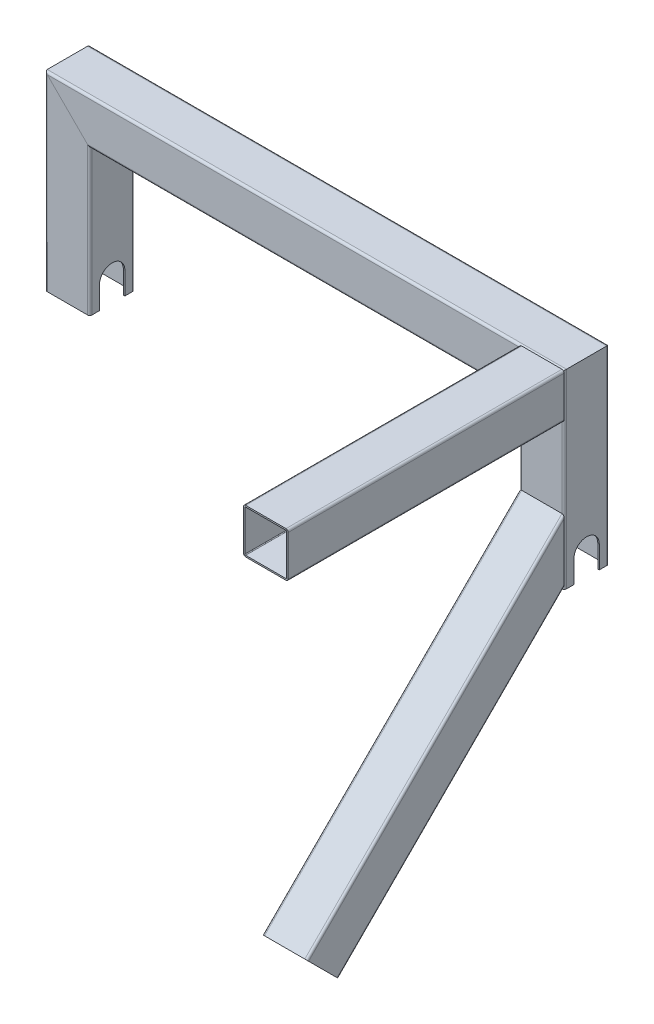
ISO-10303-21;
HEADER;
FILE_DESCRIPTION(('STEP AP214'),'2;1');
FILE_NAME('part.step','',(''),(''),'','','');
FILE_SCHEMA(('AUTOMOTIVE_DESIGN { 1 0 10303 214 1 1 1 1 }'));
ENDSEC;
DATA;
#1=APPLICATION_CONTEXT('core data for automotive mechanical design processes');
#2=APPLICATION_PROTOCOL_DEFINITION('international standard','automotive_design',2000,#1);
#3=PRODUCT_CONTEXT('',#1,'mechanical');
#4=PRODUCT('Part','Part','',(#3));
#5=PRODUCT_RELATED_PRODUCT_CATEGORY('part','',(#4));
#6=PRODUCT_DEFINITION_FORMATION('','',#4);
#7=PRODUCT_DEFINITION_CONTEXT('part definition',#1,'design');
#8=PRODUCT_DEFINITION('design','',#6,#7);
#9=PRODUCT_DEFINITION_SHAPE('','',#8);
#10=(LENGTH_UNIT() NAMED_UNIT(*) SI_UNIT(.MILLI.,.METRE.));
#11=(NAMED_UNIT(*) PLANE_ANGLE_UNIT() SI_UNIT($,.RADIAN.));
#12=(NAMED_UNIT(*) SI_UNIT($,.STERADIAN.) SOLID_ANGLE_UNIT());
#13=UNCERTAINTY_MEASURE_WITH_UNIT(LENGTH_MEASURE(1.E-05),#10,'distance_accuracy_value','');
#14=(GEOMETRIC_REPRESENTATION_CONTEXT(3) GLOBAL_UNCERTAINTY_ASSIGNED_CONTEXT((#13)) GLOBAL_UNIT_ASSIGNED_CONTEXT((#10,
#11,#12)) REPRESENTATION_CONTEXT('',''));
#15=CARTESIAN_POINT('',(0.,0.,0.));
#16=DIRECTION('',(0.,0.,1.));
#17=DIRECTION('',(1.,0.,0.));
#18=AXIS2_PLACEMENT_3D('',#15,#16,#17);
#19=CARTESIAN_POINT('',(290.,-27.,400.));
#20=DIRECTION('',(1.,0.,0.));
#21=DIRECTION('',(0.,0.,-1.));
#22=AXIS2_PLACEMENT_3D('',#19,#20,#21);
#23=PLANE('',#22);
#24=DIRECTION('',(0.,-1.,0.));
#25=VECTOR('',#24,1.);
#26=CARTESIAN_POINT('',(290.,-27.,30.));
#27=LINE('',#26,#25);
#28=CARTESIAN_POINT('',(290.,27.,30.));
#29=VERTEX_POINT('',#28);
#30=CARTESIAN_POINT('',(290.,-27.,30.));
#31=VERTEX_POINT('',#30);
#32=EDGE_CURVE('E13',#29,#31,#27,.T.);
#33=ORIENTED_EDGE('',*,*,#32,.F.);
#34=DIRECTION('',(0.,0.,-1.));
#35=VECTOR('',#34,1.);
#36=CARTESIAN_POINT('',(290.,27.,400.));
#37=LINE('',#36,#35);
#38=CARTESIAN_POINT('',(290.,27.,400.));
#39=VERTEX_POINT('',#38);
#40=EDGE_CURVE('E227',#39,#29,#37,.T.);
#41=ORIENTED_EDGE('',*,*,#40,.F.);
#42=DIRECTION('',(0.,-1.,0.));
#43=VECTOR('',#42,1.);
#44=CARTESIAN_POINT('',(290.,-27.,400.));
#45=LINE('',#44,#43);
#46=CARTESIAN_POINT('',(290.,-27.,400.));
#47=VERTEX_POINT('',#46);
#48=EDGE_CURVE('E188',#39,#47,#45,.T.);
#49=ORIENTED_EDGE('',*,*,#48,.T.);
#50=DIRECTION('',(0.,0.,-1.));
#51=VECTOR('',#50,1.);
#52=CARTESIAN_POINT('',(290.,-27.,400.));
#53=LINE('',#52,#51);
#54=EDGE_CURVE('E252',#47,#31,#53,.T.);
#55=ORIENTED_EDGE('',*,*,#54,.T.);
#56=EDGE_LOOP('',(#33,#41,#49,#55));
#57=FACE_BOUND('',#56,.T.);
#58=ADVANCED_FACE('F52',(#57),#23,.T.);
#59=CARTESIAN_POINT('',(291.,-27.,400.));
#60=DIRECTION('',(0.,0.,-1.));
#61=DIRECTION('',(-1.,0.,0.));
#62=AXIS2_PLACEMENT_3D('',#59,#60,#61);
#63=CYLINDRICAL_SURFACE('',#62,0.999999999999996);
#64=CARTESIAN_POINT('',(291.,-27.,30.));
#65=DIRECTION('',(0.,0.,1.));
#66=DIRECTION('',(1.,0.,0.));
#67=AXIS2_PLACEMENT_3D('',#64,#65,#66);
#68=CIRCLE('',#67,0.999999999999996);
#69=CARTESIAN_POINT('',(291.,-28.,30.));
#70=VERTEX_POINT('',#69);
#71=EDGE_CURVE('E285',#31,#70,#68,.T.);
#72=ORIENTED_EDGE('',*,*,#71,.F.);
#73=ORIENTED_EDGE('',*,*,#54,.F.);
#74=CARTESIAN_POINT('',(291.,-27.,400.));
#75=DIRECTION('',(0.,0.,1.));
#76=DIRECTION('',(1.,0.,0.));
#77=AXIS2_PLACEMENT_3D('',#74,#75,#76);
#78=CIRCLE('',#77,0.999999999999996);
#79=CARTESIAN_POINT('',(291.,-27.9999999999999,400.));
#80=VERTEX_POINT('',#79);
#81=EDGE_CURVE('E206',#47,#80,#78,.T.);
#82=ORIENTED_EDGE('',*,*,#81,.T.);
#83=DIRECTION('',(0.,0.,-1.));
#84=VECTOR('',#83,1.);
#85=CARTESIAN_POINT('',(291.,-27.9999999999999,400.));
#86=LINE('',#85,#84);
#87=EDGE_CURVE('E255',#80,#70,#86,.T.);
#88=ORIENTED_EDGE('',*,*,#87,.T.);
#89=EDGE_LOOP('',(#72,#73,#82,#88));
#90=FACE_BOUND('',#89,.T.);
#91=ADVANCED_FACE('F284',(#90),#63,.F.);
#92=CARTESIAN_POINT('',(291.,-27.9999999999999,400.));
#93=DIRECTION('',(0.,1.,0.));
#94=DIRECTION('',(0.,0.,1.));
#95=AXIS2_PLACEMENT_3D('',#92,#93,#94);
#96=PLANE('',#95);
#97=DIRECTION('',(1.,0.,0.));
#98=VECTOR('',#97,1.);
#99=CARTESIAN_POINT('',(291.,-27.9999999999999,30.));
#100=LINE('',#99,#98);
#101=CARTESIAN_POINT('',(345.,-27.9999999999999,30.));
#102=VERTEX_POINT('',#101);
#103=EDGE_CURVE('E281',#70,#102,#100,.T.);
#104=ORIENTED_EDGE('',*,*,#103,.F.);
#105=ORIENTED_EDGE('',*,*,#87,.F.);
#106=DIRECTION('',(1.,0.,0.));
#107=VECTOR('',#106,1.);
#108=CARTESIAN_POINT('',(291.,-27.9999999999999,400.));
#109=LINE('',#108,#107);
#110=CARTESIAN_POINT('',(345.,-28.,400.));
#111=VERTEX_POINT('',#110);
#112=EDGE_CURVE('E203',#80,#111,#109,.T.);
#113=ORIENTED_EDGE('',*,*,#112,.T.);
#114=DIRECTION('',(0.,0.,-1.));
#115=VECTOR('',#114,1.);
#116=CARTESIAN_POINT('',(345.,-28.,400.));
#117=LINE('',#116,#115);
#118=EDGE_CURVE('E258',#111,#102,#117,.T.);
#119=ORIENTED_EDGE('',*,*,#118,.T.);
#120=EDGE_LOOP('',(#104,#105,#113,#119));
#121=FACE_BOUND('',#120,.T.);
#122=ADVANCED_FACE('F280',(#121),#96,.T.);
#123=CARTESIAN_POINT('',(345.,-27.,400.));
#124=DIRECTION('',(0.,0.,-1.));
#125=DIRECTION('',(-1.,0.,0.));
#126=AXIS2_PLACEMENT_3D('',#123,#124,#125);
#127=CYLINDRICAL_SURFACE('',#126,1.00000000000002);
#128=CARTESIAN_POINT('',(345.,-27.,30.));
#129=DIRECTION('',(0.,0.,1.));
#130=DIRECTION('',(1.,0.,0.));
#131=AXIS2_PLACEMENT_3D('',#128,#129,#130);
#132=CIRCLE('',#131,1.00000000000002);
#133=CARTESIAN_POINT('',(346.,-27.,30.));
#134=VERTEX_POINT('',#133);
#135=EDGE_CURVE('E276',#102,#134,#132,.T.);
#136=ORIENTED_EDGE('',*,*,#135,.F.);
#137=ORIENTED_EDGE('',*,*,#118,.F.);
#138=CARTESIAN_POINT('',(345.,-27.,400.));
#139=DIRECTION('',(0.,0.,1.));
#140=DIRECTION('',(1.,0.,0.));
#141=AXIS2_PLACEMENT_3D('',#138,#139,#140);
#142=CIRCLE('',#141,1.00000000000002);
#143=CARTESIAN_POINT('',(346.,-27.,400.));
#144=VERTEX_POINT('',#143);
#145=EDGE_CURVE('E200',#111,#144,#142,.T.);
#146=ORIENTED_EDGE('',*,*,#145,.T.);
#147=DIRECTION('',(0.,0.,-1.));
#148=VECTOR('',#147,1.);
#149=CARTESIAN_POINT('',(346.,-27.,400.));
#150=LINE('',#149,#148);
#151=EDGE_CURVE('E261',#144,#134,#150,.T.);
#152=ORIENTED_EDGE('',*,*,#151,.T.);
#153=EDGE_LOOP('',(#136,#137,#146,#152));
#154=FACE_BOUND('',#153,.T.);
#155=ADVANCED_FACE('F275',(#154),#127,.F.);
#156=CARTESIAN_POINT('',(346.,27.,400.));
#157=DIRECTION('',(-1.,0.,0.));
#158=DIRECTION('',(0.,0.,1.));
#159=AXIS2_PLACEMENT_3D('',#156,#157,#158);
#160=PLANE('',#159);
#161=DIRECTION('',(0.,1.,0.));
#162=VECTOR('',#161,1.);
#163=CARTESIAN_POINT('',(346.,27.,30.));
#164=LINE('',#163,#162);
#165=CARTESIAN_POINT('',(346.,27.,30.));
#166=VERTEX_POINT('',#165);
#167=EDGE_CURVE('E107',#134,#166,#164,.T.);
#168=ORIENTED_EDGE('',*,*,#167,.F.);
#169=ORIENTED_EDGE('',*,*,#151,.F.);
#170=DIRECTION('',(0.,1.,0.));
#171=VECTOR('',#170,1.);
#172=CARTESIAN_POINT('',(346.,27.,400.));
#173=LINE('',#172,#171);
#174=CARTESIAN_POINT('',(346.,27.,400.));
#175=VERTEX_POINT('',#174);
#176=EDGE_CURVE('E194',#144,#175,#173,.T.);
#177=ORIENTED_EDGE('',*,*,#176,.T.);
#178=DIRECTION('',(0.,0.,-1.));
#179=VECTOR('',#178,1.);
#180=CARTESIAN_POINT('',(346.,27.,400.));
#181=LINE('',#180,#179);
#182=EDGE_CURVE('E264',#175,#166,#181,.T.);
#183=ORIENTED_EDGE('',*,*,#182,.T.);
#184=EDGE_LOOP('',(#168,#169,#177,#183));
#185=FACE_BOUND('',#184,.T.);
#186=ADVANCED_FACE('F272',(#185),#160,.T.);
#187=CARTESIAN_POINT('',(345.,27.,400.));
#188=DIRECTION('',(0.,0.,-1.));
#189=DIRECTION('',(-1.,0.,0.));
#190=AXIS2_PLACEMENT_3D('',#187,#188,#189);
#191=CYLINDRICAL_SURFACE('',#190,0.999999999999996);
#192=CARTESIAN_POINT('',(345.,27.,30.));
#193=DIRECTION('',(0.,0.,1.));
#194=DIRECTION('',(1.,0.,0.));
#195=AXIS2_PLACEMENT_3D('',#192,#193,#194);
#196=CIRCLE('',#195,0.999999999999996);
#197=CARTESIAN_POINT('',(345.,28.,30.));
#198=VERTEX_POINT('',#197);
#199=EDGE_CURVE('E110',#166,#198,#196,.T.);
#200=ORIENTED_EDGE('',*,*,#199,.F.);
#201=ORIENTED_EDGE('',*,*,#182,.F.);
#202=CARTESIAN_POINT('',(345.,27.,400.));
#203=DIRECTION('',(0.,0.,1.));
#204=DIRECTION('',(1.,0.,0.));
#205=AXIS2_PLACEMENT_3D('',#202,#203,#204);
#206=CIRCLE('',#205,0.999999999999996);
#207=CARTESIAN_POINT('',(345.,28.,400.));
#208=VERTEX_POINT('',#207);
#209=EDGE_CURVE('E192',#175,#208,#206,.T.);
#210=ORIENTED_EDGE('',*,*,#209,.T.);
#211=DIRECTION('',(0.,0.,-1.));
#212=VECTOR('',#211,1.);
#213=CARTESIAN_POINT('',(345.,28.,400.));
#214=LINE('',#213,#212);
#215=EDGE_CURVE('E178',#208,#198,#214,.T.);
#216=ORIENTED_EDGE('',*,*,#215,.T.);
#217=EDGE_LOOP('',(#200,#201,#210,#216));
#218=FACE_BOUND('',#217,.T.);
#219=ADVANCED_FACE('F268',(#218),#191,.F.);
#220=CARTESIAN_POINT('',(345.,28.,400.));
#221=DIRECTION('',(0.,-1.,0.));
#222=DIRECTION('',(0.,0.,-1.));
#223=AXIS2_PLACEMENT_3D('',#220,#221,#222);
#224=PLANE('',#223);
#225=DIRECTION('',(-1.,0.,0.));
#226=VECTOR('',#225,1.);
#227=CARTESIAN_POINT('',(345.,28.,30.));
#228=LINE('',#227,#226);
#229=CARTESIAN_POINT('',(291.,28.,30.));
#230=VERTEX_POINT('',#229);
#231=EDGE_CURVE('E114',#198,#230,#228,.T.);
#232=ORIENTED_EDGE('',*,*,#231,.F.);
#233=ORIENTED_EDGE('',*,*,#215,.F.);
#234=DIRECTION('',(-1.,0.,0.));
#235=VECTOR('',#234,1.);
#236=CARTESIAN_POINT('',(345.,28.,400.));
#237=LINE('',#236,#235);
#238=CARTESIAN_POINT('',(291.,28.,400.));
#239=VERTEX_POINT('',#238);
#240=EDGE_CURVE('E184',#208,#239,#237,.T.);
#241=ORIENTED_EDGE('',*,*,#240,.T.);
#242=DIRECTION('',(0.,0.,-1.));
#243=VECTOR('',#242,1.);
#244=CARTESIAN_POINT('',(291.,28.,400.));
#245=LINE('',#244,#243);
#246=EDGE_CURVE('E171',#239,#230,#245,.T.);
#247=ORIENTED_EDGE('',*,*,#246,.T.);
#248=EDGE_LOOP('',(#232,#233,#241,#247));
#249=FACE_BOUND('',#248,.T.);
#250=ADVANCED_FACE('F190',(#249),#224,.T.);
#251=CARTESIAN_POINT('',(291.,27.,400.));
#252=DIRECTION('',(0.,0.,-1.));
#253=DIRECTION('',(-1.,0.,0.));
#254=AXIS2_PLACEMENT_3D('',#251,#252,#253);
#255=CYLINDRICAL_SURFACE('',#254,0.999999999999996);
#256=CARTESIAN_POINT('',(291.,27.,30.));
#257=DIRECTION('',(0.,0.,1.));
#258=DIRECTION('',(1.,0.,0.));
#259=AXIS2_PLACEMENT_3D('',#256,#257,#258);
#260=CIRCLE('',#259,0.999999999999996);
#261=EDGE_CURVE('E117',#230,#29,#260,.T.);
#262=ORIENTED_EDGE('',*,*,#261,.F.);
#263=ORIENTED_EDGE('',*,*,#246,.F.);
#264=CARTESIAN_POINT('',(291.,27.,400.));
#265=DIRECTION('',(0.,0.,1.));
#266=DIRECTION('',(1.,0.,0.));
#267=AXIS2_PLACEMENT_3D('',#264,#265,#266);
#268=CIRCLE('',#267,0.999999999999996);
#269=EDGE_CURVE('E173',#239,#39,#268,.T.);
#270=ORIENTED_EDGE('',*,*,#269,.T.);
#271=ORIENTED_EDGE('',*,*,#40,.T.);
#272=EDGE_LOOP('',(#262,#263,#270,#271));
#273=FACE_BOUND('',#272,.T.);
#274=ADVANCED_FACE('F54',(#273),#255,.F.);
#275=CARTESIAN_POINT('',(345.,27.,400.));
#276=DIRECTION('',(0.,0.,1.));
#277=DIRECTION('',(1.,0.,0.));
#278=AXIS2_PLACEMENT_3D('',#275,#276,#277);
#279=PLANE('',#278);
#280=ORIENTED_EDGE('',*,*,#269,.F.);
#281=ORIENTED_EDGE('',*,*,#240,.F.);
#282=ORIENTED_EDGE('',*,*,#209,.F.);
#283=ORIENTED_EDGE('',*,*,#176,.F.);
#284=ORIENTED_EDGE('',*,*,#145,.F.);
#285=ORIENTED_EDGE('',*,*,#112,.F.);
#286=ORIENTED_EDGE('',*,*,#81,.F.);
#287=ORIENTED_EDGE('',*,*,#48,.F.);
#288=EDGE_LOOP('',(#280,#281,#282,#283,#284,#285,#286,#287));
#289=FACE_BOUND('',#288,.T.);
#290=CARTESIAN_POINT('',(345.,27.,400.));
#291=DIRECTION('',(0.,0.,1.));
#292=DIRECTION('',(1.,0.,0.));
#293=AXIS2_PLACEMENT_3D('',#290,#291,#292);
#294=CIRCLE('',#293,2.99999999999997);
#295=CARTESIAN_POINT('',(348.,27.,400.));
#296=VERTEX_POINT('',#295);
#297=CARTESIAN_POINT('',(345.,30.,400.));
#298=VERTEX_POINT('',#297);
#299=EDGE_CURVE('E210',#296,#298,#294,.T.);
#300=ORIENTED_EDGE('',*,*,#299,.T.);
#301=DIRECTION('',(-1.,0.,0.));
#302=VECTOR('',#301,1.);
#303=CARTESIAN_POINT('',(345.,30.,400.));
#304=LINE('',#303,#302);
#305=CARTESIAN_POINT('',(291.,30.,400.));
#306=VERTEX_POINT('',#305);
#307=EDGE_CURVE('E213',#298,#306,#304,.T.);
#308=ORIENTED_EDGE('',*,*,#307,.T.);
#309=CARTESIAN_POINT('',(291.,27.,400.));
#310=DIRECTION('',(0.,0.,1.));
#311=DIRECTION('',(1.,0.,0.));
#312=AXIS2_PLACEMENT_3D('',#309,#310,#311);
#313=CIRCLE('',#312,2.99999999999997);
#314=CARTESIAN_POINT('',(288.,27.,400.));
#315=VERTEX_POINT('',#314);
#316=EDGE_CURVE('E215',#306,#315,#313,.T.);
#317=ORIENTED_EDGE('',*,*,#316,.T.);
#318=DIRECTION('',(0.,-1.,0.));
#319=VECTOR('',#318,1.);
#320=CARTESIAN_POINT('',(288.,-27.,400.));
#321=LINE('',#320,#319);
#322=CARTESIAN_POINT('',(288.,-27.,400.));
#323=VERTEX_POINT('',#322);
#324=EDGE_CURVE('E217',#315,#323,#321,.T.);
#325=ORIENTED_EDGE('',*,*,#324,.T.);
#326=CARTESIAN_POINT('',(291.,-27.,400.));
#327=DIRECTION('',(0.,0.,1.));
#328=DIRECTION('',(1.,0.,0.));
#329=AXIS2_PLACEMENT_3D('',#326,#327,#328);
#330=CIRCLE('',#329,2.99999999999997);
#331=CARTESIAN_POINT('',(291.,-30.,400.));
#332=VERTEX_POINT('',#331);
#333=EDGE_CURVE('E219',#323,#332,#330,.T.);
#334=ORIENTED_EDGE('',*,*,#333,.T.);
#335=DIRECTION('',(1.,0.,0.));
#336=VECTOR('',#335,1.);
#337=CARTESIAN_POINT('',(291.,-30.,400.));
#338=LINE('',#337,#336);
#339=CARTESIAN_POINT('',(345.,-30.,400.));
#340=VERTEX_POINT('',#339);
#341=EDGE_CURVE('E221',#332,#340,#338,.T.);
#342=ORIENTED_EDGE('',*,*,#341,.T.);
#343=CARTESIAN_POINT('',(345.,-27.,400.));
#344=DIRECTION('',(0.,0.,1.));
#345=DIRECTION('',(1.,0.,0.));
#346=AXIS2_PLACEMENT_3D('',#343,#344,#345);
#347=CIRCLE('',#346,3.);
#348=CARTESIAN_POINT('',(348.,-27.,400.));
#349=VERTEX_POINT('',#348);
#350=EDGE_CURVE('E223',#340,#349,#347,.T.);
#351=ORIENTED_EDGE('',*,*,#350,.T.);
#352=DIRECTION('',(0.,1.,0.));
#353=VECTOR('',#352,1.);
#354=CARTESIAN_POINT('',(348.,27.,400.));
#355=LINE('',#354,#353);
#356=EDGE_CURVE('E225',#349,#296,#355,.T.);
#357=ORIENTED_EDGE('',*,*,#356,.T.);
#358=EDGE_LOOP('',(#300,#308,#317,#325,#334,#342,#351,#357));
#359=FACE_BOUND('',#358,.T.);
#360=ADVANCED_FACE('F181',(#289,#359),#279,.T.);
#361=CARTESIAN_POINT('',(348.,27.,400.));
#362=DIRECTION('',(-1.,0.,0.));
#363=DIRECTION('',(0.,0.,1.));
#364=AXIS2_PLACEMENT_3D('',#361,#362,#363);
#365=PLANE('',#364);
#366=DIRECTION('',(0.,0.,-1.));
#367=VECTOR('',#366,1.);
#368=CARTESIAN_POINT('',(348.,-27.,400.));
#369=LINE('',#368,#367);
#370=CARTESIAN_POINT('',(348.,-27.,30.));
#371=VERTEX_POINT('',#370);
#372=EDGE_CURVE('E230',#349,#371,#369,.T.);
#373=ORIENTED_EDGE('',*,*,#372,.T.);
#374=DIRECTION('',(0.,1.,0.));
#375=VECTOR('',#374,1.);
#376=CARTESIAN_POINT('',(348.,27.,30.));
#377=LINE('',#376,#375);
#378=CARTESIAN_POINT('',(348.,27.,30.));
#379=VERTEX_POINT('',#378);
#380=EDGE_CURVE('E56',#371,#379,#377,.T.);
#381=ORIENTED_EDGE('',*,*,#380,.T.);
#382=DIRECTION('',(0.,0.,-1.));
#383=VECTOR('',#382,1.);
#384=CARTESIAN_POINT('',(348.,27.,400.));
#385=LINE('',#384,#383);
#386=EDGE_CURVE('E177',#296,#379,#385,.T.);
#387=ORIENTED_EDGE('',*,*,#386,.F.);
#388=ORIENTED_EDGE('',*,*,#356,.F.);
#389=EDGE_LOOP('',(#373,#381,#387,#388));
#390=FACE_BOUND('',#389,.T.);
#391=ADVANCED_FACE('F323',(#390),#365,.F.);
#392=CARTESIAN_POINT('',(345.,-27.,400.));
#393=DIRECTION('',(0.,0.,-1.));
#394=DIRECTION('',(-1.,0.,0.));
#395=AXIS2_PLACEMENT_3D('',#392,#393,#394);
#396=CYLINDRICAL_SURFACE('',#395,3.);
#397=DIRECTION('',(0.,0.,-1.));
#398=VECTOR('',#397,1.);
#399=CARTESIAN_POINT('',(345.,-30.,400.));
#400=LINE('',#399,#398);
#401=CARTESIAN_POINT('',(345.,-30.,30.));
#402=VERTEX_POINT('',#401);
#403=EDGE_CURVE('E233',#340,#402,#400,.T.);
#404=ORIENTED_EDGE('',*,*,#403,.T.);
#405=CARTESIAN_POINT('',(345.,-27.,30.));
#406=DIRECTION('',(0.,0.,1.));
#407=DIRECTION('',(1.,0.,0.));
#408=AXIS2_PLACEMENT_3D('',#405,#406,#407);
#409=CIRCLE('',#408,3.);
#410=EDGE_CURVE('E62',#402,#371,#409,.T.);
#411=ORIENTED_EDGE('',*,*,#410,.T.);
#412=ORIENTED_EDGE('',*,*,#372,.F.);
#413=ORIENTED_EDGE('',*,*,#350,.F.);
#414=EDGE_LOOP('',(#404,#411,#412,#413));
#415=FACE_BOUND('',#414,.T.);
#416=ADVANCED_FACE('F318',(#415),#396,.T.);
#417=CARTESIAN_POINT('',(291.,-30.,400.));
#418=DIRECTION('',(0.,1.,0.));
#419=DIRECTION('',(0.,0.,1.));
#420=AXIS2_PLACEMENT_3D('',#417,#418,#419);
#421=PLANE('',#420);
#422=DIRECTION('',(0.,0.,-1.));
#423=VECTOR('',#422,1.);
#424=CARTESIAN_POINT('',(291.,-30.,400.));
#425=LINE('',#424,#423);
#426=CARTESIAN_POINT('',(291.,-30.,30.));
#427=VERTEX_POINT('',#426);
#428=EDGE_CURVE('E236',#332,#427,#425,.T.);
#429=ORIENTED_EDGE('',*,*,#428,.T.);
#430=DIRECTION('',(1.,0.,0.));
#431=VECTOR('',#430,1.);
#432=CARTESIAN_POINT('',(291.,-30.,30.));
#433=LINE('',#432,#431);
#434=EDGE_CURVE('E313',#427,#402,#433,.T.);
#435=ORIENTED_EDGE('',*,*,#434,.T.);
#436=ORIENTED_EDGE('',*,*,#403,.F.);
#437=ORIENTED_EDGE('',*,*,#341,.F.);
#438=EDGE_LOOP('',(#429,#435,#436,#437));
#439=FACE_BOUND('',#438,.T.);
#440=ADVANCED_FACE('F330',(#439),#421,.F.);
#441=CARTESIAN_POINT('',(291.,-27.,400.));
#442=DIRECTION('',(0.,0.,-1.));
#443=DIRECTION('',(-1.,0.,0.));
#444=AXIS2_PLACEMENT_3D('',#441,#442,#443);
#445=CYLINDRICAL_SURFACE('',#444,2.99999999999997);
#446=DIRECTION('',(0.,0.,-1.));
#447=VECTOR('',#446,1.);
#448=CARTESIAN_POINT('',(288.,-27.,400.));
#449=LINE('',#448,#447);
#450=CARTESIAN_POINT('',(288.,-27.,30.));
#451=VERTEX_POINT('',#450);
#452=EDGE_CURVE('E239',#323,#451,#449,.T.);
#453=ORIENTED_EDGE('',*,*,#452,.T.);
#454=CARTESIAN_POINT('',(291.,-27.,30.));
#455=DIRECTION('',(0.,0.,1.));
#456=DIRECTION('',(1.,0.,0.));
#457=AXIS2_PLACEMENT_3D('',#454,#455,#456);
#458=CIRCLE('',#457,2.99999999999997);
#459=EDGE_CURVE('E310',#451,#427,#458,.T.);
#460=ORIENTED_EDGE('',*,*,#459,.T.);
#461=ORIENTED_EDGE('',*,*,#428,.F.);
#462=ORIENTED_EDGE('',*,*,#333,.F.);
#463=EDGE_LOOP('',(#453,#460,#461,#462));
#464=FACE_BOUND('',#463,.T.);
#465=ADVANCED_FACE('F333',(#464),#445,.T.);
#466=CARTESIAN_POINT('',(288.,-27.,400.));
#467=DIRECTION('',(1.,0.,0.));
#468=DIRECTION('',(0.,0.,-1.));
#469=AXIS2_PLACEMENT_3D('',#466,#467,#468);
#470=PLANE('',#469);
#471=DIRECTION('',(0.,0.,-1.));
#472=VECTOR('',#471,1.);
#473=CARTESIAN_POINT('',(288.,27.,400.));
#474=LINE('',#473,#472);
#475=CARTESIAN_POINT('',(288.,27.,30.));
#476=VERTEX_POINT('',#475);
#477=EDGE_CURVE('E242',#315,#476,#474,.T.);
#478=ORIENTED_EDGE('',*,*,#477,.T.);
#479=DIRECTION('',(0.,-1.,0.));
#480=VECTOR('',#479,1.);
#481=CARTESIAN_POINT('',(288.,-27.,30.));
#482=LINE('',#481,#480);
#483=EDGE_CURVE('E307',#476,#451,#482,.T.);
#484=ORIENTED_EDGE('',*,*,#483,.T.);
#485=ORIENTED_EDGE('',*,*,#452,.F.);
#486=ORIENTED_EDGE('',*,*,#324,.F.);
#487=EDGE_LOOP('',(#478,#484,#485,#486));
#488=FACE_BOUND('',#487,.T.);
#489=ADVANCED_FACE('F336',(#488),#470,.F.);
#490=CARTESIAN_POINT('',(291.,27.,400.));
#491=DIRECTION('',(0.,0.,-1.));
#492=DIRECTION('',(-1.,0.,0.));
#493=AXIS2_PLACEMENT_3D('',#490,#491,#492);
#494=CYLINDRICAL_SURFACE('',#493,2.99999999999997);
#495=DIRECTION('',(0.,0.,-1.));
#496=VECTOR('',#495,1.);
#497=CARTESIAN_POINT('',(291.,30.,400.));
#498=LINE('',#497,#496);
#499=CARTESIAN_POINT('',(291.,30.,30.));
#500=VERTEX_POINT('',#499);
#501=EDGE_CURVE('E245',#306,#500,#498,.T.);
#502=ORIENTED_EDGE('',*,*,#501,.T.);
#503=CARTESIAN_POINT('',(291.,27.,30.));
#504=DIRECTION('',(0.,0.,1.));
#505=DIRECTION('',(1.,0.,0.));
#506=AXIS2_PLACEMENT_3D('',#503,#504,#505);
#507=CIRCLE('',#506,2.99999999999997);
#508=EDGE_CURVE('E302',#500,#476,#507,.T.);
#509=ORIENTED_EDGE('',*,*,#508,.T.);
#510=ORIENTED_EDGE('',*,*,#477,.F.);
#511=ORIENTED_EDGE('',*,*,#316,.F.);
#512=EDGE_LOOP('',(#502,#509,#510,#511));
#513=FACE_BOUND('',#512,.T.);
#514=ADVANCED_FACE('F340',(#513),#494,.T.);
#515=CARTESIAN_POINT('',(345.,30.,400.));
#516=DIRECTION('',(0.,-1.,0.));
#517=DIRECTION('',(0.,0.,-1.));
#518=AXIS2_PLACEMENT_3D('',#515,#516,#517);
#519=PLANE('',#518);
#520=DIRECTION('',(0.,0.,-1.));
#521=VECTOR('',#520,1.);
#522=CARTESIAN_POINT('',(345.,30.,400.));
#523=LINE('',#522,#521);
#524=CARTESIAN_POINT('',(345.,30.,30.));
#525=VERTEX_POINT('',#524);
#526=EDGE_CURVE('E248',#298,#525,#523,.T.);
#527=ORIENTED_EDGE('',*,*,#526,.T.);
#528=DIRECTION('',(-1.,0.,0.));
#529=VECTOR('',#528,1.);
#530=CARTESIAN_POINT('',(345.,30.,30.));
#531=LINE('',#530,#529);
#532=EDGE_CURVE('E298',#525,#500,#531,.T.);
#533=ORIENTED_EDGE('',*,*,#532,.T.);
#534=ORIENTED_EDGE('',*,*,#501,.F.);
#535=ORIENTED_EDGE('',*,*,#307,.F.);
#536=EDGE_LOOP('',(#527,#533,#534,#535));
#537=FACE_BOUND('',#536,.T.);
#538=ADVANCED_FACE('F343',(#537),#519,.F.);
#539=CARTESIAN_POINT('',(345.,27.,400.));
#540=DIRECTION('',(0.,0.,-1.));
#541=DIRECTION('',(-1.,0.,0.));
#542=AXIS2_PLACEMENT_3D('',#539,#540,#541);
#543=CYLINDRICAL_SURFACE('',#542,2.99999999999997);
#544=ORIENTED_EDGE('',*,*,#386,.T.);
#545=CARTESIAN_POINT('',(345.,27.,30.));
#546=DIRECTION('',(0.,0.,1.));
#547=DIRECTION('',(1.,0.,0.));
#548=AXIS2_PLACEMENT_3D('',#545,#546,#547);
#549=CIRCLE('',#548,2.99999999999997);
#550=EDGE_CURVE('E296',#379,#525,#549,.T.);
#551=ORIENTED_EDGE('',*,*,#550,.T.);
#552=ORIENTED_EDGE('',*,*,#526,.F.);
#553=ORIENTED_EDGE('',*,*,#299,.F.);
#554=EDGE_LOOP('',(#544,#551,#552,#553));
#555=FACE_BOUND('',#554,.T.);
#556=ADVANCED_FACE('F344',(#555),#543,.T.);
#557=CARTESIAN_POINT('',(-3.33066907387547E-13,0.,30.));
#558=DIRECTION('',(0.,0.,1.));
#559=DIRECTION('',(1.,0.,0.));
#560=AXIS2_PLACEMENT_3D('',#557,#558,#559);
#561=PLANE('',#560);
#562=ORIENTED_EDGE('',*,*,#261,.T.);
#563=ORIENTED_EDGE('',*,*,#32,.T.);
#564=ORIENTED_EDGE('',*,*,#71,.T.);
#565=ORIENTED_EDGE('',*,*,#103,.T.);
#566=ORIENTED_EDGE('',*,*,#135,.T.);
#567=ORIENTED_EDGE('',*,*,#167,.T.);
#568=ORIENTED_EDGE('',*,*,#199,.T.);
#569=ORIENTED_EDGE('',*,*,#231,.T.);
#570=EDGE_LOOP('',(#562,#563,#564,#565,#566,#567,#568,#569));
#571=FACE_BOUND('',#570,.T.);
#572=ORIENTED_EDGE('',*,*,#380,.F.);
#573=ORIENTED_EDGE('',*,*,#410,.F.);
#574=ORIENTED_EDGE('',*,*,#434,.F.);
#575=ORIENTED_EDGE('',*,*,#459,.F.);
#576=ORIENTED_EDGE('',*,*,#483,.F.);
#577=ORIENTED_EDGE('',*,*,#508,.F.);
#578=ORIENTED_EDGE('',*,*,#532,.F.);
#579=ORIENTED_EDGE('',*,*,#550,.F.);
#580=EDGE_LOOP('',(#572,#573,#574,#575,#576,#577,#578,#579));
#581=FACE_BOUND('',#580,.T.);
#582=ADVANCED_FACE('F288',(#571,#581),#561,.F.);
#583=CLOSED_SHELL('',(#58,#91,#122,#155,#186,#219,#250,#274,#360,#391,#416,#440,#465,#489,#514,
#538,#556,#582));
#584=MANIFOLD_SOLID_BREP('B2',#583);
#585=CARTESIAN_POINT('',(345.999999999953,-484.461507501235,372.645273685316));
#586=DIRECTION('',(-1.,0.,-1.801506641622E-13));
#587=DIRECTION('',(-1.801506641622E-13,0.,1.));
#588=AXIS2_PLACEMENT_3D('',#585,#586,#587);
#589=PLANE('',#588);
#590=DIRECTION('',(0.,1.,0.));
#591=VECTOR('',#590,1.);
#592=CARTESIAN_POINT('',(346.000000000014,-484.461507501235,30.));
#593=LINE('',#592,#591);
#594=CARTESIAN_POINT('',(345.999999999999,-218.183766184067,30.));
#595=VERTEX_POINT('',#594);
#596=CARTESIAN_POINT('',(345.999999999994,-141.81623381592,30.));
#597=VERTEX_POINT('',#596);
#598=EDGE_CURVE('E50',#595,#597,#593,.T.);
#599=ORIENTED_EDGE('',*,*,#598,.F.);
#600=DIRECTION('',(0.,0.707106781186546,-0.707106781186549));
#601=VECTOR('',#600,1.);
#602=CARTESIAN_POINT('',(345.999999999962,-522.645273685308,334.461507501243));
#603=LINE('',#602,#601);
#604=CARTESIAN_POINT('',(345.999999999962,-522.645273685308,334.461507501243));
#605=VERTEX_POINT('',#604);
#606=EDGE_CURVE('E711',#605,#595,#603,.T.);
#607=ORIENTED_EDGE('',*,*,#606,.F.);
#608=DIRECTION('',(-1.69617406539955E-13,0.707106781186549,0.707106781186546));
#609=VECTOR('',#608,1.);
#610=CARTESIAN_POINT('',(345.999999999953,-484.461507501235,372.645273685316));
#611=LINE('',#610,#609);
#612=CARTESIAN_POINT('',(345.999999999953,-484.461507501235,372.645273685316));
#613=VERTEX_POINT('',#612);
#614=EDGE_CURVE('E672',#605,#613,#611,.T.);
#615=ORIENTED_EDGE('',*,*,#614,.T.);
#616=DIRECTION('',(0.,0.707106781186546,-0.707106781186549));
#617=VECTOR('',#616,1.);
#618=CARTESIAN_POINT('',(345.999999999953,-484.461507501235,372.645273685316));
#619=LINE('',#618,#617);
#620=EDGE_CURVE('E736',#613,#597,#619,.T.);
#621=ORIENTED_EDGE('',*,*,#620,.T.);
#622=EDGE_LOOP('',(#599,#607,#615,#621));
#623=FACE_BOUND('',#622,.T.);
#624=ADVANCED_FACE('F536',(#623),#589,.T.);
#625=CARTESIAN_POINT('',(344.999999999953,-484.461507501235,372.645273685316));
#626=DIRECTION('',(0.,0.707106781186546,-0.707106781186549));
#627=DIRECTION('',(0.,0.707106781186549,0.707106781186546));
#628=AXIS2_PLACEMENT_3D('',#625,#626,#627);
#629=CYLINDRICAL_SURFACE('',#628,0.999999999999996);
#630=CARTESIAN_POINT('',(344.999999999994,-141.81623381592,30.));
#631=DIRECTION('',(0.,0.,1.));
#632=DIRECTION('',(1.20426091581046E-13,1.,0.));
#633=AXIS2_PLACEMENT_3D('',#630,#631,#632);
#634=ELLIPSE('',#633,1.41421356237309,0.999999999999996);
#635=CARTESIAN_POINT('',(344.999999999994,-140.402020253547,30.));
#636=VERTEX_POINT('',#635);
#637=EDGE_CURVE('E769',#597,#636,#634,.T.);
#638=ORIENTED_EDGE('',*,*,#637,.F.);
#639=ORIENTED_EDGE('',*,*,#620,.F.);
#640=CARTESIAN_POINT('',(344.999999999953,-484.461507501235,372.645273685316));
#641=DIRECTION('',(0.,-0.707106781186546,0.707106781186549));
#642=DIRECTION('',(0.,-0.707106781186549,-0.707106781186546));
#643=AXIS2_PLACEMENT_3D('',#640,#641,#642);
#644=CIRCLE('',#643,0.999999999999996);
#645=CARTESIAN_POINT('',(344.999999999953,-483.754400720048,373.352380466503));
#646=VERTEX_POINT('',#645);
#647=EDGE_CURVE('E690',#613,#646,#644,.T.);
#648=ORIENTED_EDGE('',*,*,#647,.T.);
#649=DIRECTION('',(0.,0.707106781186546,-0.707106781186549));
#650=VECTOR('',#649,1.);
#651=CARTESIAN_POINT('',(344.999999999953,-483.754400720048,373.352380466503));
#652=LINE('',#651,#650);
#653=EDGE_CURVE('E739',#646,#636,#652,.T.);
#654=ORIENTED_EDGE('',*,*,#653,.T.);
#655=EDGE_LOOP('',(#638,#639,#648,#654));
#656=FACE_BOUND('',#655,.T.);
#657=ADVANCED_FACE('F768',(#656),#629,.F.);
#658=CARTESIAN_POINT('',(344.999999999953,-483.754400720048,373.352380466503));
#659=DIRECTION('',(1.69639040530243E-13,-0.707106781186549,-0.707106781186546));
#660=DIRECTION('',(0.,0.707106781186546,-0.707106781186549));
#661=AXIS2_PLACEMENT_3D('',#658,#659,#660);
#662=PLANE('',#661);
#663=DIRECTION('',(-1.,-2.39905831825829E-13,0.));
#664=VECTOR('',#663,1.);
#665=CARTESIAN_POINT('',(344.99999999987,-140.402020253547,30.));
#666=LINE('',#665,#664);
#667=CARTESIAN_POINT('',(290.999999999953,-140.40202025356,30.));
#668=VERTEX_POINT('',#667);
#669=EDGE_CURVE('E765',#636,#668,#666,.T.);
#670=ORIENTED_EDGE('',*,*,#669,.F.);
#671=ORIENTED_EDGE('',*,*,#653,.F.);
#672=DIRECTION('',(-1.,0.,-1.8028274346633E-13));
#673=VECTOR('',#672,1.);
#674=CARTESIAN_POINT('',(344.999999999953,-483.754400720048,373.352380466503));
#675=LINE('',#674,#673);
#676=CARTESIAN_POINT('',(290.999999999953,-483.754400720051,373.352380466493));
#677=VERTEX_POINT('',#676);
#678=EDGE_CURVE('E687',#646,#677,#675,.T.);
#679=ORIENTED_EDGE('',*,*,#678,.T.);
#680=DIRECTION('',(0.,0.707106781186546,-0.707106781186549));
#681=VECTOR('',#680,1.);
#682=CARTESIAN_POINT('',(290.999999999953,-483.754400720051,373.352380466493));
#683=LINE('',#682,#681);
#684=EDGE_CURVE('E742',#677,#668,#683,.T.);
#685=ORIENTED_EDGE('',*,*,#684,.T.);
#686=EDGE_LOOP('',(#670,#671,#679,#685));
#687=FACE_BOUND('',#686,.T.);
#688=ADVANCED_FACE('F764',(#687),#662,.T.);
#689=CARTESIAN_POINT('',(290.999999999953,-484.461507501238,372.645273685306));
#690=DIRECTION('',(0.,0.707106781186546,-0.707106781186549));
#691=DIRECTION('',(0.,0.707106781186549,0.707106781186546));
#692=AXIS2_PLACEMENT_3D('',#689,#690,#691);
#693=CYLINDRICAL_SURFACE('',#692,1.00000000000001);
#694=CARTESIAN_POINT('',(290.999999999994,-141.816233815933,30.));
#695=DIRECTION('',(0.,0.,1.));
#696=DIRECTION('',(1.20426091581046E-13,1.,0.));
#697=AXIS2_PLACEMENT_3D('',#694,#695,#696);
#698=ELLIPSE('',#697,1.4142135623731,1.00000000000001);
#699=CARTESIAN_POINT('',(289.999999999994,-141.816233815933,30.));
#700=VERTEX_POINT('',#699);
#701=EDGE_CURVE('E760',#668,#700,#698,.T.);
#702=ORIENTED_EDGE('',*,*,#701,.F.);
#703=ORIENTED_EDGE('',*,*,#684,.F.);
#704=CARTESIAN_POINT('',(290.999999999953,-484.461507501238,372.645273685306));
#705=DIRECTION('',(0.,-0.707106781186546,0.707106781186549));
#706=DIRECTION('',(0.,-0.707106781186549,-0.707106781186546));
#707=AXIS2_PLACEMENT_3D('',#704,#705,#706);
#708=CIRCLE('',#707,1.00000000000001);
#709=CARTESIAN_POINT('',(289.999999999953,-484.461507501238,372.645273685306));
#710=VERTEX_POINT('',#709);
#711=EDGE_CURVE('E684',#677,#710,#708,.T.);
#712=ORIENTED_EDGE('',*,*,#711,.T.);
#713=DIRECTION('',(0.,0.707106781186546,-0.707106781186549));
#714=VECTOR('',#713,1.);
#715=CARTESIAN_POINT('',(289.999999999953,-484.461507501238,372.645273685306));
#716=LINE('',#715,#714);
#717=EDGE_CURVE('E745',#710,#700,#716,.T.);
#718=ORIENTED_EDGE('',*,*,#717,.T.);
#719=EDGE_LOOP('',(#702,#703,#712,#718));
#720=FACE_BOUND('',#719,.T.);
#721=ADVANCED_FACE('F759',(#720),#693,.F.);
#722=CARTESIAN_POINT('',(289.999999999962,-522.645273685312,334.461507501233));
#723=DIRECTION('',(1.,0.,1.801506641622E-13));
#724=DIRECTION('',(1.801506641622E-13,0.,-1.));
#725=AXIS2_PLACEMENT_3D('',#722,#723,#724);
#726=PLANE('',#725);
#727=DIRECTION('',(0.,-1.,0.));
#728=VECTOR('',#727,1.);
#729=CARTESIAN_POINT('',(290.000000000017,-522.645273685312,30.));
#730=LINE('',#729,#728);
#731=CARTESIAN_POINT('',(289.999999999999,-218.18376618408,30.));
#732=VERTEX_POINT('',#731);
#733=EDGE_CURVE('E591',#700,#732,#730,.T.);
#734=ORIENTED_EDGE('',*,*,#733,.F.);
#735=ORIENTED_EDGE('',*,*,#717,.F.);
#736=DIRECTION('',(1.69617406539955E-13,-0.707106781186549,-0.707106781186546));
#737=VECTOR('',#736,1.);
#738=CARTESIAN_POINT('',(289.999999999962,-522.645273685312,334.461507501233));
#739=LINE('',#738,#737);
#740=CARTESIAN_POINT('',(289.999999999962,-522.645273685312,334.461507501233));
#741=VERTEX_POINT('',#740);
#742=EDGE_CURVE('E678',#710,#741,#739,.T.);
#743=ORIENTED_EDGE('',*,*,#742,.T.);
#744=DIRECTION('',(0.,0.707106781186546,-0.707106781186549));
#745=VECTOR('',#744,1.);
#746=CARTESIAN_POINT('',(289.999999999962,-522.645273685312,334.461507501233));
#747=LINE('',#746,#745);
#748=EDGE_CURVE('E748',#741,#732,#747,.T.);
#749=ORIENTED_EDGE('',*,*,#748,.T.);
#750=EDGE_LOOP('',(#734,#735,#743,#749));
#751=FACE_BOUND('',#750,.T.);
#752=ADVANCED_FACE('F756',(#751),#726,.T.);
#753=CARTESIAN_POINT('',(290.999999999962,-522.645273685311,334.461507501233));
#754=DIRECTION('',(0.,0.707106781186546,-0.707106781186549));
#755=DIRECTION('',(0.,0.707106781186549,0.707106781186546));
#756=AXIS2_PLACEMENT_3D('',#753,#754,#755);
#757=CYLINDRICAL_SURFACE('',#756,0.999999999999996);
#758=CARTESIAN_POINT('',(290.999999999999,-218.18376618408,30.));
#759=DIRECTION('',(0.,0.,1.));
#760=DIRECTION('',(1.20426091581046E-13,1.,0.));
#761=AXIS2_PLACEMENT_3D('',#758,#759,#760);
#762=ELLIPSE('',#761,1.41421356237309,0.999999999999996);
#763=CARTESIAN_POINT('',(290.999999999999,-219.597979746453,30.));
#764=VERTEX_POINT('',#763);
#765=EDGE_CURVE('E594',#732,#764,#762,.T.);
#766=ORIENTED_EDGE('',*,*,#765,.F.);
#767=ORIENTED_EDGE('',*,*,#748,.F.);
#768=CARTESIAN_POINT('',(290.999999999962,-522.645273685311,334.461507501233));
#769=DIRECTION('',(0.,-0.707106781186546,0.707106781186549));
#770=DIRECTION('',(0.,-0.707106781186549,-0.707106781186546));
#771=AXIS2_PLACEMENT_3D('',#768,#769,#770);
#772=CIRCLE('',#771,0.999999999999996);
#773=CARTESIAN_POINT('',(290.999999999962,-523.352380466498,333.754400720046));
#774=VERTEX_POINT('',#773);
#775=EDGE_CURVE('E676',#741,#774,#772,.T.);
#776=ORIENTED_EDGE('',*,*,#775,.T.);
#777=DIRECTION('',(0.,0.707106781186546,-0.707106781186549));
#778=VECTOR('',#777,1.);
#779=CARTESIAN_POINT('',(290.999999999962,-523.352380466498,333.754400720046));
#780=LINE('',#779,#778);
#781=EDGE_CURVE('E662',#774,#764,#780,.T.);
#782=ORIENTED_EDGE('',*,*,#781,.T.);
#783=EDGE_LOOP('',(#766,#767,#776,#782));
#784=FACE_BOUND('',#783,.T.);
#785=ADVANCED_FACE('F752',(#784),#757,.F.);
#786=CARTESIAN_POINT('',(290.999999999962,-523.352380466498,333.754400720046));
#787=DIRECTION('',(-1.69639040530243E-13,0.707106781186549,0.707106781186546));
#788=DIRECTION('',(0.,-0.707106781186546,0.707106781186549));
#789=AXIS2_PLACEMENT_3D('',#786,#787,#788);
#790=PLANE('',#789);
#791=DIRECTION('',(1.,2.39905831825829E-13,0.));
#792=VECTOR('',#791,1.);
#793=CARTESIAN_POINT('',(290.999999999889,-219.597979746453,30.));
#794=LINE('',#793,#792);
#795=CARTESIAN_POINT('',(345.000000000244,-219.59797974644,30.));
#796=VERTEX_POINT('',#795);
#797=EDGE_CURVE('E598',#764,#796,#794,.T.);
#798=ORIENTED_EDGE('',*,*,#797,.F.);
#799=ORIENTED_EDGE('',*,*,#781,.F.);
#800=DIRECTION('',(1.,0.,1.8028274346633E-13));
#801=VECTOR('',#800,1.);
#802=CARTESIAN_POINT('',(290.999999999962,-523.352380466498,333.754400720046));
#803=LINE('',#802,#801);
#804=CARTESIAN_POINT('',(344.999999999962,-523.352380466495,333.754400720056));
#805=VERTEX_POINT('',#804);
#806=EDGE_CURVE('E668',#774,#805,#803,.T.);
#807=ORIENTED_EDGE('',*,*,#806,.T.);
#808=DIRECTION('',(0.,0.707106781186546,-0.707106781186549));
#809=VECTOR('',#808,1.);
#810=CARTESIAN_POINT('',(344.999999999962,-523.352380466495,333.754400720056));
#811=LINE('',#810,#809);
#812=EDGE_CURVE('E655',#805,#796,#811,.T.);
#813=ORIENTED_EDGE('',*,*,#812,.T.);
#814=EDGE_LOOP('',(#798,#799,#807,#813));
#815=FACE_BOUND('',#814,.T.);
#816=ADVANCED_FACE('F674',(#815),#790,.T.);
#817=CARTESIAN_POINT('',(344.999999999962,-522.645273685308,334.461507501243));
#818=DIRECTION('',(0.,0.707106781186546,-0.707106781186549));
#819=DIRECTION('',(0.,0.707106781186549,0.707106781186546));
#820=AXIS2_PLACEMENT_3D('',#817,#818,#819);
#821=CYLINDRICAL_SURFACE('',#820,1.00000000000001);
#822=CARTESIAN_POINT('',(344.999999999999,-218.183766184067,30.));
#823=DIRECTION('',(0.,0.,1.));
#824=DIRECTION('',(1.20426091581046E-13,1.,0.));
#825=AXIS2_PLACEMENT_3D('',#822,#823,#824);
#826=ELLIPSE('',#825,1.4142135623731,1.00000000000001);
#827=EDGE_CURVE('E601',#796,#595,#826,.T.);
#828=ORIENTED_EDGE('',*,*,#827,.F.);
#829=ORIENTED_EDGE('',*,*,#812,.F.);
#830=CARTESIAN_POINT('',(344.999999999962,-522.645273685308,334.461507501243));
#831=DIRECTION('',(0.,-0.707106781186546,0.707106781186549));
#832=DIRECTION('',(0.,-0.707106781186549,-0.707106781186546));
#833=AXIS2_PLACEMENT_3D('',#830,#831,#832);
#834=CIRCLE('',#833,1.00000000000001);
#835=EDGE_CURVE('E657',#805,#605,#834,.T.);
#836=ORIENTED_EDGE('',*,*,#835,.T.);
#837=ORIENTED_EDGE('',*,*,#606,.T.);
#838=EDGE_LOOP('',(#828,#829,#836,#837));
#839=FACE_BOUND('',#838,.T.);
#840=ADVANCED_FACE('F538',(#839),#821,.F.);
#841=CARTESIAN_POINT('',(290.999999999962,-522.645273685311,334.461507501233));
#842=DIRECTION('',(0.,-0.707106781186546,0.707106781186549));
#843=DIRECTION('',(0.,-0.707106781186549,-0.707106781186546));
#844=AXIS2_PLACEMENT_3D('',#841,#842,#843);
#845=PLANE('',#844);
#846=ORIENTED_EDGE('',*,*,#835,.F.);
#847=ORIENTED_EDGE('',*,*,#806,.F.);
#848=ORIENTED_EDGE('',*,*,#775,.F.);
#849=ORIENTED_EDGE('',*,*,#742,.F.);
#850=ORIENTED_EDGE('',*,*,#711,.F.);
#851=ORIENTED_EDGE('',*,*,#678,.F.);
#852=ORIENTED_EDGE('',*,*,#647,.F.);
#853=ORIENTED_EDGE('',*,*,#614,.F.);
#854=EDGE_LOOP('',(#846,#847,#848,#849,#850,#851,#852,#853));
#855=FACE_BOUND('',#854,.T.);
#856=CARTESIAN_POINT('',(290.999999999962,-522.645273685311,334.461507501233));
#857=DIRECTION('',(0.,-0.707106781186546,0.707106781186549));
#858=DIRECTION('',(0.,-0.707106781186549,-0.707106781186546));
#859=AXIS2_PLACEMENT_3D('',#856,#857,#858);
#860=CIRCLE('',#859,3.);
#861=CARTESIAN_POINT('',(287.999999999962,-522.645273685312,334.461507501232));
#862=VERTEX_POINT('',#861);
#863=CARTESIAN_POINT('',(290.999999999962,-524.766594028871,332.340187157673));
#864=VERTEX_POINT('',#863);
#865=EDGE_CURVE('E694',#862,#864,#860,.T.);
#866=ORIENTED_EDGE('',*,*,#865,.T.);
#867=DIRECTION('',(1.,0.,1.8028274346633E-13));
#868=VECTOR('',#867,1.);
#869=CARTESIAN_POINT('',(290.999999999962,-524.766594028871,332.340187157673));
#870=LINE('',#869,#868);
#871=CARTESIAN_POINT('',(344.999999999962,-524.766594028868,332.340187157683));
#872=VERTEX_POINT('',#871);
#873=EDGE_CURVE('E697',#864,#872,#870,.T.);
#874=ORIENTED_EDGE('',*,*,#873,.T.);
#875=CARTESIAN_POINT('',(344.999999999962,-522.645273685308,334.461507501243));
#876=DIRECTION('',(0.,-0.707106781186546,0.707106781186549));
#877=DIRECTION('',(0.,-0.707106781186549,-0.707106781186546));
#878=AXIS2_PLACEMENT_3D('',#875,#876,#877);
#879=CIRCLE('',#878,3.00000000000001);
#880=CARTESIAN_POINT('',(347.999999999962,-522.645273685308,334.461507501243));
#881=VERTEX_POINT('',#880);
#882=EDGE_CURVE('E699',#872,#881,#879,.T.);
#883=ORIENTED_EDGE('',*,*,#882,.T.);
#884=DIRECTION('',(-1.69617406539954E-13,0.707106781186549,0.707106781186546));
#885=VECTOR('',#884,1.);
#886=CARTESIAN_POINT('',(347.999999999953,-484.461507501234,372.645273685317));
#887=LINE('',#886,#885);
#888=CARTESIAN_POINT('',(347.999999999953,-484.461507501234,372.645273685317));
#889=VERTEX_POINT('',#888);
#890=EDGE_CURVE('E701',#881,#889,#887,.T.);
#891=ORIENTED_EDGE('',*,*,#890,.T.);
#892=CARTESIAN_POINT('',(344.999999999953,-484.461507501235,372.645273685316));
#893=DIRECTION('',(0.,-0.707106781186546,0.707106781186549));
#894=DIRECTION('',(0.,-0.707106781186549,-0.707106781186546));
#895=AXIS2_PLACEMENT_3D('',#892,#893,#894);
#896=CIRCLE('',#895,3.);
#897=CARTESIAN_POINT('',(344.999999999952,-482.340187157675,374.766594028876));
#898=VERTEX_POINT('',#897);
#899=EDGE_CURVE('E703',#889,#898,#896,.T.);
#900=ORIENTED_EDGE('',*,*,#899,.T.);
#901=DIRECTION('',(-1.,0.,-1.8028274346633E-13));
#902=VECTOR('',#901,1.);
#903=CARTESIAN_POINT('',(344.999999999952,-482.340187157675,374.766594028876));
#904=LINE('',#903,#902);
#905=CARTESIAN_POINT('',(290.999999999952,-482.340187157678,374.766594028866));
#906=VERTEX_POINT('',#905);
#907=EDGE_CURVE('E705',#898,#906,#904,.T.);
#908=ORIENTED_EDGE('',*,*,#907,.T.);
#909=CARTESIAN_POINT('',(290.999999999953,-484.461507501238,372.645273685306));
#910=DIRECTION('',(0.,-0.707106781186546,0.707106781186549));
#911=DIRECTION('',(0.,-0.707106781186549,-0.707106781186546));
#912=AXIS2_PLACEMENT_3D('',#909,#910,#911);
#913=CIRCLE('',#912,3.00000000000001);
#914=CARTESIAN_POINT('',(287.999999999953,-484.461507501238,372.645273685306));
#915=VERTEX_POINT('',#914);
#916=EDGE_CURVE('E707',#906,#915,#913,.T.);
#917=ORIENTED_EDGE('',*,*,#916,.T.);
#918=DIRECTION('',(1.69617406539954E-13,-0.707106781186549,-0.707106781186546));
#919=VECTOR('',#918,1.);
#920=CARTESIAN_POINT('',(287.999999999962,-522.645273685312,334.461507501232));
#921=LINE('',#920,#919);
#922=EDGE_CURVE('E709',#915,#862,#921,.T.);
#923=ORIENTED_EDGE('',*,*,#922,.T.);
#924=EDGE_LOOP('',(#866,#874,#883,#891,#900,#908,#917,#923));
#925=FACE_BOUND('',#924,.T.);
#926=ADVANCED_FACE('F665',(#855,#925),#845,.T.);
#927=CARTESIAN_POINT('',(287.999999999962,-522.645273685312,334.461507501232));
#928=DIRECTION('',(1.,0.,1.801506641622E-13));
#929=DIRECTION('',(1.801506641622E-13,0.,-1.));
#930=AXIS2_PLACEMENT_3D('',#927,#928,#929);
#931=PLANE('',#930);
#932=DIRECTION('',(0.,0.707106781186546,-0.707106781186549));
#933=VECTOR('',#932,1.);
#934=CARTESIAN_POINT('',(287.999999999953,-484.461507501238,372.645273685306));
#935=LINE('',#934,#933);
#936=CARTESIAN_POINT('',(287.999999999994,-141.816233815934,30.));
#937=VERTEX_POINT('',#936);
#938=EDGE_CURVE('E714',#915,#937,#935,.T.);
#939=ORIENTED_EDGE('',*,*,#938,.T.);
#940=DIRECTION('',(0.,-1.,0.));
#941=VECTOR('',#940,1.);
#942=CARTESIAN_POINT('',(288.000000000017,-522.645273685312,30.));
#943=LINE('',#942,#941);
#944=CARTESIAN_POINT('',(287.999999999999,-218.183766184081,30.));
#945=VERTEX_POINT('',#944);
#946=EDGE_CURVE('E540',#937,#945,#943,.T.);
#947=ORIENTED_EDGE('',*,*,#946,.T.);
#948=DIRECTION('',(0.,0.707106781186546,-0.707106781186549));
#949=VECTOR('',#948,1.);
#950=CARTESIAN_POINT('',(287.999999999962,-522.645273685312,334.461507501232));
#951=LINE('',#950,#949);
#952=EDGE_CURVE('E661',#862,#945,#951,.T.);
#953=ORIENTED_EDGE('',*,*,#952,.F.);
#954=ORIENTED_EDGE('',*,*,#922,.F.);
#955=EDGE_LOOP('',(#939,#947,#953,#954));
#956=FACE_BOUND('',#955,.T.);
#957=ADVANCED_FACE('F807',(#956),#931,.F.);
#958=CARTESIAN_POINT('',(290.999999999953,-484.461507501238,372.645273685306));
#959=DIRECTION('',(0.,0.707106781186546,-0.707106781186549));
#960=DIRECTION('',(0.,0.707106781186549,0.707106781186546));
#961=AXIS2_PLACEMENT_3D('',#958,#959,#960);
#962=CYLINDRICAL_SURFACE('',#961,3.00000000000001);
#963=DIRECTION('',(0.,0.707106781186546,-0.707106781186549));
#964=VECTOR('',#963,1.);
#965=CARTESIAN_POINT('',(290.999999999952,-482.340187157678,374.766594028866));
#966=LINE('',#965,#964);
#967=CARTESIAN_POINT('',(290.999999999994,-137.573593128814,30.));
#968=VERTEX_POINT('',#967);
#969=EDGE_CURVE('E717',#906,#968,#966,.T.);
#970=ORIENTED_EDGE('',*,*,#969,.T.);
#971=CARTESIAN_POINT('',(290.999999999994,-141.816233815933,30.));
#972=DIRECTION('',(0.,0.,1.));
#973=DIRECTION('',(1.20426091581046E-13,1.,0.));
#974=AXIS2_PLACEMENT_3D('',#971,#972,#973);
#975=ELLIPSE('',#974,4.24264068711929,3.00000000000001);
#976=EDGE_CURVE('E546',#968,#937,#975,.T.);
#977=ORIENTED_EDGE('',*,*,#976,.T.);
#978=ORIENTED_EDGE('',*,*,#938,.F.);
#979=ORIENTED_EDGE('',*,*,#916,.F.);
#980=EDGE_LOOP('',(#970,#977,#978,#979));
#981=FACE_BOUND('',#980,.T.);
#982=ADVANCED_FACE('F802',(#981),#962,.T.);
#983=CARTESIAN_POINT('',(344.999999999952,-482.340187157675,374.766594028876));
#984=DIRECTION('',(1.69639040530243E-13,-0.707106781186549,-0.707106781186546));
#985=DIRECTION('',(0.,0.707106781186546,-0.707106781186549));
#986=AXIS2_PLACEMENT_3D('',#983,#984,#985);
#987=PLANE('',#986);
#988=DIRECTION('',(0.,0.707106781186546,-0.707106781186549));
#989=VECTOR('',#988,1.);
#990=CARTESIAN_POINT('',(344.999999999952,-482.340187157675,374.766594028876));
#991=LINE('',#990,#989);
#992=CARTESIAN_POINT('',(345.000000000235,-137.573593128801,30.));
#993=VERTEX_POINT('',#992);
#994=EDGE_CURVE('E720',#898,#993,#991,.T.);
#995=ORIENTED_EDGE('',*,*,#994,.T.);
#996=DIRECTION('',(-1.,-2.39905831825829E-13,0.));
#997=VECTOR('',#996,1.);
#998=CARTESIAN_POINT('',(344.99999999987,-137.573593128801,30.));
#999=LINE('',#998,#997);
#1000=EDGE_CURVE('E797',#993,#968,#999,.T.);
#1001=ORIENTED_EDGE('',*,*,#1000,.T.);
#1002=ORIENTED_EDGE('',*,*,#969,.F.);
#1003=ORIENTED_EDGE('',*,*,#907,.F.);
#1004=EDGE_LOOP('',(#995,#1001,#1002,#1003));
#1005=FACE_BOUND('',#1004,.T.);
#1006=ADVANCED_FACE('F814',(#1005),#987,.F.);
#1007=CARTESIAN_POINT('',(344.999999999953,-484.461507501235,372.645273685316));
#1008=DIRECTION('',(0.,0.707106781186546,-0.707106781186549));
#1009=DIRECTION('',(0.,0.707106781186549,0.707106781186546));
#1010=AXIS2_PLACEMENT_3D('',#1007,#1008,#1009);
#1011=CYLINDRICAL_SURFACE('',#1010,3.);
#1012=DIRECTION('',(0.,0.707106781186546,-0.707106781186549));
#1013=VECTOR('',#1012,1.);
#1014=CARTESIAN_POINT('',(347.999999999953,-484.461507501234,372.645273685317));
#1015=LINE('',#1014,#1013);
#1016=CARTESIAN_POINT('',(347.999999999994,-141.816233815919,30.));
#1017=VERTEX_POINT('',#1016);
#1018=EDGE_CURVE('E723',#889,#1017,#1015,.T.);
#1019=ORIENTED_EDGE('',*,*,#1018,.T.);
#1020=CARTESIAN_POINT('',(344.999999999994,-141.81623381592,30.));
#1021=DIRECTION('',(0.,0.,1.));
#1022=DIRECTION('',(1.20426091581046E-13,1.,0.));
#1023=AXIS2_PLACEMENT_3D('',#1020,#1021,#1022);
#1024=ELLIPSE('',#1023,4.24264068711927,3.);
#1025=EDGE_CURVE('E794',#1017,#993,#1024,.T.);
#1026=ORIENTED_EDGE('',*,*,#1025,.T.);
#1027=ORIENTED_EDGE('',*,*,#994,.F.);
#1028=ORIENTED_EDGE('',*,*,#899,.F.);
#1029=EDGE_LOOP('',(#1019,#1026,#1027,#1028));
#1030=FACE_BOUND('',#1029,.T.);
#1031=ADVANCED_FACE('F817',(#1030),#1011,.T.);
#1032=CARTESIAN_POINT('',(347.999999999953,-484.461507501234,372.645273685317));
#1033=DIRECTION('',(-1.,0.,-1.801506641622E-13));
#1034=DIRECTION('',(-1.801506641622E-13,0.,1.));
#1035=AXIS2_PLACEMENT_3D('',#1032,#1033,#1034);
#1036=PLANE('',#1035);
#1037=DIRECTION('',(0.,0.707106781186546,-0.707106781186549));
#1038=VECTOR('',#1037,1.);
#1039=CARTESIAN_POINT('',(347.999999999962,-522.645273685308,334.461507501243));
#1040=LINE('',#1039,#1038);
#1041=CARTESIAN_POINT('',(347.999999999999,-218.183766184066,30.));
#1042=VERTEX_POINT('',#1041);
#1043=EDGE_CURVE('E726',#881,#1042,#1040,.T.);
#1044=ORIENTED_EDGE('',*,*,#1043,.T.);
#1045=DIRECTION('',(0.,1.,0.));
#1046=VECTOR('',#1045,1.);
#1047=CARTESIAN_POINT('',(348.000000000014,-484.461507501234,30.));
#1048=LINE('',#1047,#1046);
#1049=EDGE_CURVE('E791',#1042,#1017,#1048,.T.);
#1050=ORIENTED_EDGE('',*,*,#1049,.T.);
#1051=ORIENTED_EDGE('',*,*,#1018,.F.);
#1052=ORIENTED_EDGE('',*,*,#890,.F.);
#1053=EDGE_LOOP('',(#1044,#1050,#1051,#1052));
#1054=FACE_BOUND('',#1053,.T.);
#1055=ADVANCED_FACE('F820',(#1054),#1036,.F.);
#1056=CARTESIAN_POINT('',(344.999999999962,-522.645273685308,334.461507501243));
#1057=DIRECTION('',(0.,0.707106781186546,-0.707106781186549));
#1058=DIRECTION('',(0.,0.707106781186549,0.707106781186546));
#1059=AXIS2_PLACEMENT_3D('',#1056,#1057,#1058);
#1060=CYLINDRICAL_SURFACE('',#1059,3.00000000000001);
#1061=DIRECTION('',(0.,0.707106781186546,-0.707106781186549));
#1062=VECTOR('',#1061,1.);
#1063=CARTESIAN_POINT('',(344.999999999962,-524.766594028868,332.340187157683));
#1064=LINE('',#1063,#1062);
#1065=CARTESIAN_POINT('',(344.999999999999,-222.426406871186,30.));
#1066=VERTEX_POINT('',#1065);
#1067=EDGE_CURVE('E729',#872,#1066,#1064,.T.);
#1068=ORIENTED_EDGE('',*,*,#1067,.T.);
#1069=CARTESIAN_POINT('',(344.999999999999,-218.183766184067,30.));
#1070=DIRECTION('',(0.,0.,1.));
#1071=DIRECTION('',(1.20426091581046E-13,1.,0.));
#1072=AXIS2_PLACEMENT_3D('',#1069,#1070,#1071);
#1073=ELLIPSE('',#1072,4.24264068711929,3.00000000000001);
#1074=EDGE_CURVE('E786',#1066,#1042,#1073,.T.);
#1075=ORIENTED_EDGE('',*,*,#1074,.T.);
#1076=ORIENTED_EDGE('',*,*,#1043,.F.);
#1077=ORIENTED_EDGE('',*,*,#882,.F.);
#1078=EDGE_LOOP('',(#1068,#1075,#1076,#1077));
#1079=FACE_BOUND('',#1078,.T.);
#1080=ADVANCED_FACE('F824',(#1079),#1060,.T.);
#1081=CARTESIAN_POINT('',(290.999999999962,-524.766594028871,332.340187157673));
#1082=DIRECTION('',(-1.69639040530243E-13,0.707106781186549,0.707106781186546));
#1083=DIRECTION('',(0.,-0.707106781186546,0.707106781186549));
#1084=AXIS2_PLACEMENT_3D('',#1081,#1082,#1083);
#1085=PLANE('',#1084);
#1086=DIRECTION('',(0.,0.707106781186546,-0.707106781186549));
#1087=VECTOR('',#1086,1.);
#1088=CARTESIAN_POINT('',(290.999999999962,-524.766594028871,332.340187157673));
#1089=LINE('',#1088,#1087);
#1090=CARTESIAN_POINT('',(290.999999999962,-222.426406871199,30.));
#1091=VERTEX_POINT('',#1090);
#1092=EDGE_CURVE('E732',#864,#1091,#1089,.T.);
#1093=ORIENTED_EDGE('',*,*,#1092,.T.);
#1094=DIRECTION('',(1.,2.39905831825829E-13,0.));
#1095=VECTOR('',#1094,1.);
#1096=CARTESIAN_POINT('',(290.99999999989,-222.426406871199,30.));
#1097=LINE('',#1096,#1095);
#1098=EDGE_CURVE('E782',#1091,#1066,#1097,.T.);
#1099=ORIENTED_EDGE('',*,*,#1098,.T.);
#1100=ORIENTED_EDGE('',*,*,#1067,.F.);
#1101=ORIENTED_EDGE('',*,*,#873,.F.);
#1102=EDGE_LOOP('',(#1093,#1099,#1100,#1101));
#1103=FACE_BOUND('',#1102,.T.);
#1104=ADVANCED_FACE('F827',(#1103),#1085,.F.);
#1105=CARTESIAN_POINT('',(290.999999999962,-522.645273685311,334.461507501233));
#1106=DIRECTION('',(0.,0.707106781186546,-0.707106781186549));
#1107=DIRECTION('',(0.,0.707106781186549,0.707106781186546));
#1108=AXIS2_PLACEMENT_3D('',#1105,#1106,#1107);
#1109=CYLINDRICAL_SURFACE('',#1108,3.);
#1110=ORIENTED_EDGE('',*,*,#952,.T.);
#1111=CARTESIAN_POINT('',(290.999999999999,-218.18376618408,30.));
#1112=DIRECTION('',(0.,0.,1.));
#1113=DIRECTION('',(1.20426091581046E-13,1.,0.));
#1114=AXIS2_PLACEMENT_3D('',#1111,#1112,#1113);
#1115=ELLIPSE('',#1114,4.24264068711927,3.);
#1116=EDGE_CURVE('E780',#945,#1091,#1115,.T.);
#1117=ORIENTED_EDGE('',*,*,#1116,.T.);
#1118=ORIENTED_EDGE('',*,*,#1092,.F.);
#1119=ORIENTED_EDGE('',*,*,#865,.F.);
#1120=EDGE_LOOP('',(#1110,#1117,#1118,#1119));
#1121=FACE_BOUND('',#1120,.T.);
#1122=ADVANCED_FACE('F828',(#1121),#1109,.T.);
#1123=CARTESIAN_POINT('',(331.5,-13.4999999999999,30.));
#1124=DIRECTION('',(0.,0.,1.));
#1125=DIRECTION('',(1.,0.,0.));
#1126=AXIS2_PLACEMENT_3D('',#1123,#1124,#1125);
#1127=PLANE('',#1126);
#1128=ORIENTED_EDGE('',*,*,#827,.T.);
#1129=ORIENTED_EDGE('',*,*,#598,.T.);
#1130=ORIENTED_EDGE('',*,*,#637,.T.);
#1131=ORIENTED_EDGE('',*,*,#669,.T.);
#1132=ORIENTED_EDGE('',*,*,#701,.T.);
#1133=ORIENTED_EDGE('',*,*,#733,.T.);
#1134=ORIENTED_EDGE('',*,*,#765,.T.);
#1135=ORIENTED_EDGE('',*,*,#797,.T.);
#1136=EDGE_LOOP('',(#1128,#1129,#1130,#1131,#1132,#1133,#1134,#1135));
#1137=FACE_BOUND('',#1136,.T.);
#1138=ORIENTED_EDGE('',*,*,#946,.F.);
#1139=ORIENTED_EDGE('',*,*,#976,.F.);
#1140=ORIENTED_EDGE('',*,*,#1000,.F.);
#1141=ORIENTED_EDGE('',*,*,#1025,.F.);
#1142=ORIENTED_EDGE('',*,*,#1049,.F.);
#1143=ORIENTED_EDGE('',*,*,#1074,.F.);
#1144=ORIENTED_EDGE('',*,*,#1098,.F.);
#1145=ORIENTED_EDGE('',*,*,#1116,.F.);
#1146=EDGE_LOOP('',(#1138,#1139,#1140,#1141,#1142,#1143,#1144,#1145));
#1147=FACE_BOUND('',#1146,.T.);
#1148=ADVANCED_FACE('F772',(#1137,#1147),#1127,.F.);
#1149=CLOSED_SHELL('',(#624,#657,#688,#721,#752,#785,#816,#840,#926,#957,#982,#1006,#1031,#1055,
#1080,#1104,#1122,#1148));
#1150=MANIFOLD_SOLID_BREP('B7',#1149);
#1151=CARTESIAN_POINT('',(345.,-225.,27.));
#1152=DIRECTION('',(0.,1.,0.));
#1153=DIRECTION('',(0.,0.,-1.));
#1154=AXIS2_PLACEMENT_3D('',#1151,#1152,#1153);
#1155=PLANE('',#1154);
#1156=DIRECTION('',(0.,0.,1.));
#1157=VECTOR('',#1156,1.);
#1158=CARTESIAN_POINT('',(288.,-225.,-27.));
#1159=LINE('',#1158,#1157);
#1160=CARTESIAN_POINT('',(288.,-225.,17.));
#1161=VERTEX_POINT('',#1160);
#1162=CARTESIAN_POINT('',(288.,-225.,27.));
#1163=VERTEX_POINT('',#1162);
#1164=EDGE_CURVE('E1240',#1161,#1163,#1159,.T.);
#1165=ORIENTED_EDGE('',*,*,#1164,.F.);
#1166=DIRECTION('',(1.,0.,0.));
#1167=VECTOR('',#1166,1.);
#1168=CARTESIAN_POINT('',(345.,-225.,17.));
#1169=LINE('',#1168,#1167);
#1170=CARTESIAN_POINT('',(290.,-225.,17.));
#1171=VERTEX_POINT('',#1170);
#1172=EDGE_CURVE('E1028',#1161,#1171,#1169,.T.);
#1173=ORIENTED_EDGE('',*,*,#1172,.T.);
#1174=DIRECTION('',(0.,0.,1.));
#1175=VECTOR('',#1174,1.);
#1176=CARTESIAN_POINT('',(290.,-225.,-27.));
#1177=LINE('',#1176,#1175);
#1178=CARTESIAN_POINT('',(290.,-225.,27.));
#1179=VERTEX_POINT('',#1178);
#1180=EDGE_CURVE('E1267',#1171,#1179,#1177,.T.);
#1181=ORIENTED_EDGE('',*,*,#1180,.T.);
#1182=CARTESIAN_POINT('',(291.,-225.,27.));
#1183=DIRECTION('',(0.,1.,0.));
#1184=DIRECTION('',(0.,0.,-1.));
#1185=AXIS2_PLACEMENT_3D('',#1182,#1183,#1184);
#1186=CIRCLE('',#1185,1.);
#1187=CARTESIAN_POINT('',(291.,-225.,28.));
#1188=VERTEX_POINT('',#1187);
#1189=EDGE_CURVE('E1271',#1179,#1188,#1186,.T.);
#1190=ORIENTED_EDGE('',*,*,#1189,.T.);
#1191=DIRECTION('',(1.,0.,0.));
#1192=VECTOR('',#1191,1.);
#1193=CARTESIAN_POINT('',(345.,-225.,28.));
#1194=LINE('',#1193,#1192);
#1195=CARTESIAN_POINT('',(345.,-225.,28.));
#1196=VERTEX_POINT('',#1195);
#1197=EDGE_CURVE('E1274',#1188,#1196,#1194,.T.);
#1198=ORIENTED_EDGE('',*,*,#1197,.T.);
#1199=CARTESIAN_POINT('',(345.,-225.,27.));
#1200=DIRECTION('',(0.,1.,0.));
#1201=DIRECTION('',(0.,0.,-1.));
#1202=AXIS2_PLACEMENT_3D('',#1199,#1200,#1201);
#1203=CIRCLE('',#1202,1.);
#1204=CARTESIAN_POINT('',(346.,-225.,27.));
#1205=VERTEX_POINT('',#1204);
#1206=EDGE_CURVE('E1277',#1196,#1205,#1203,.T.);
#1207=ORIENTED_EDGE('',*,*,#1206,.T.);
#1208=DIRECTION('',(0.,0.,-1.));
#1209=VECTOR('',#1208,1.);
#1210=CARTESIAN_POINT('',(346.,-225.,27.));
#1211=LINE('',#1210,#1209);
#1212=CARTESIAN_POINT('',(346.,-225.,17.));
#1213=VERTEX_POINT('',#1212);
#1214=EDGE_CURVE('E1281',#1205,#1213,#1211,.T.);
#1215=ORIENTED_EDGE('',*,*,#1214,.T.);
#1216=DIRECTION('',(-1.,0.,0.));
#1217=VECTOR('',#1216,1.);
#1218=CARTESIAN_POINT('',(348.,-225.,17.));
#1219=LINE('',#1218,#1217);
#1220=CARTESIAN_POINT('',(348.,-225.,17.));
#1221=VERTEX_POINT('',#1220);
#1222=EDGE_CURVE('E1209',#1221,#1213,#1219,.T.);
#1223=ORIENTED_EDGE('',*,*,#1222,.F.);
#1224=DIRECTION('',(0.,0.,-1.));
#1225=VECTOR('',#1224,1.);
#1226=CARTESIAN_POINT('',(348.,-225.,27.));
#1227=LINE('',#1226,#1225);
#1228=CARTESIAN_POINT('',(348.,-225.,27.));
#1229=VERTEX_POINT('',#1228);
#1230=EDGE_CURVE('E1254',#1229,#1221,#1227,.T.);
#1231=ORIENTED_EDGE('',*,*,#1230,.F.);
#1232=CARTESIAN_POINT('',(345.,-225.,27.));
#1233=DIRECTION('',(0.,1.,0.));
#1234=DIRECTION('',(0.,0.,-1.));
#1235=AXIS2_PLACEMENT_3D('',#1232,#1233,#1234);
#1236=CIRCLE('',#1235,3.);
#1237=CARTESIAN_POINT('',(345.,-225.,30.));
#1238=VERTEX_POINT('',#1237);
#1239=EDGE_CURVE('E1257',#1238,#1229,#1236,.T.);
#1240=ORIENTED_EDGE('',*,*,#1239,.F.);
#1241=DIRECTION('',(1.,0.,0.));
#1242=VECTOR('',#1241,1.);
#1243=CARTESIAN_POINT('',(345.,-225.,30.));
#1244=LINE('',#1243,#1242);
#1245=CARTESIAN_POINT('',(291.,-225.,30.));
#1246=VERTEX_POINT('',#1245);
#1247=EDGE_CURVE('E1227',#1246,#1238,#1244,.T.);
#1248=ORIENTED_EDGE('',*,*,#1247,.F.);
#1249=CARTESIAN_POINT('',(291.,-225.,27.));
#1250=DIRECTION('',(0.,1.,0.));
#1251=DIRECTION('',(0.,0.,-1.));
#1252=AXIS2_PLACEMENT_3D('',#1249,#1250,#1251);
#1253=CIRCLE('',#1252,3.);
#1254=EDGE_CURVE('E1232',#1163,#1246,#1253,.T.);
#1255=ORIENTED_EDGE('',*,*,#1254,.F.);
#1256=EDGE_LOOP('',(#1165,#1173,#1181,#1190,#1198,#1207,#1215,#1223,#1231,#1240,#1248,#1255));
#1257=FACE_BOUND('',#1256,.T.);
#1258=ADVANCED_FACE('F1020',(#1257),#1155,.F.);
#1259=CARTESIAN_POINT('',(345.,0.,27.));
#1260=DIRECTION('',(0.,-1.,0.));
#1261=DIRECTION('',(1.,0.,0.));
#1262=AXIS2_PLACEMENT_3D('',#1259,#1260,#1261);
#1263=CYLINDRICAL_SURFACE('',#1262,3.);
#1264=CARTESIAN_POINT('',(345.,27.,27.));
#1265=DIRECTION('',(-0.707106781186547,0.707106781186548,0.));
#1266=DIRECTION('',(-0.707106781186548,-0.707106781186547,0.));
#1267=AXIS2_PLACEMENT_3D('',#1264,#1265,#1266);
#1268=ELLIPSE('',#1267,4.24264068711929,3.);
#1269=CARTESIAN_POINT('',(345.,27.0000000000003,30.));
#1270=VERTEX_POINT('',#1269);
#1271=CARTESIAN_POINT('',(348.,30.,27.));
#1272=VERTEX_POINT('',#1271);
#1273=EDGE_CURVE('E1311',#1270,#1272,#1268,.T.);
#1274=ORIENTED_EDGE('',*,*,#1273,.F.);
#1275=DIRECTION('',(0.,-1.,0.));
#1276=VECTOR('',#1275,1.);
#1277=CARTESIAN_POINT('',(345.,0.,30.));
#1278=LINE('',#1277,#1276);
#1279=EDGE_CURVE('E1226',#1270,#1238,#1278,.T.);
#1280=ORIENTED_EDGE('',*,*,#1279,.T.);
#1281=ORIENTED_EDGE('',*,*,#1239,.T.);
#1282=DIRECTION('',(0.,-1.,0.));
#1283=VECTOR('',#1282,1.);
#1284=CARTESIAN_POINT('',(348.,0.,27.));
#1285=LINE('',#1284,#1283);
#1286=EDGE_CURVE('E1260',#1272,#1229,#1285,.T.);
#1287=ORIENTED_EDGE('',*,*,#1286,.F.);
#1288=EDGE_LOOP('',(#1274,#1280,#1281,#1287));
#1289=FACE_BOUND('',#1288,.T.);
#1290=ADVANCED_FACE('F1398',(#1289),#1263,.T.);
#1291=CARTESIAN_POINT('',(348.,0.,27.));
#1292=DIRECTION('',(-1.,0.,0.));
#1293=DIRECTION('',(0.,-1.,0.));
#1294=AXIS2_PLACEMENT_3D('',#1291,#1292,#1293);
#1295=PLANE('',#1294);
#1296=ORIENTED_EDGE('',*,*,#1230,.T.);
#1297=DIRECTION('',(0.,1.,0.));
#1298=VECTOR('',#1297,1.);
#1299=CARTESIAN_POINT('',(348.,-195.,17.));
#1300=LINE('',#1299,#1298);
#1301=CARTESIAN_POINT('',(348.,-195.,17.));
#1302=VERTEX_POINT('',#1301);
#1303=EDGE_CURVE('E1198',#1221,#1302,#1300,.T.);
#1304=ORIENTED_EDGE('',*,*,#1303,.T.);
#1305=CARTESIAN_POINT('',(348.,-195.,0.));
#1306=DIRECTION('',(-1.,0.,0.));
#1307=DIRECTION('',(0.,-1.,0.));
#1308=AXIS2_PLACEMENT_3D('',#1305,#1306,#1307);
#1309=CIRCLE('',#1308,17.);
#1310=CARTESIAN_POINT('',(348.,-195.,-17.));
#1311=VERTEX_POINT('',#1310);
#1312=EDGE_CURVE('E1186',#1302,#1311,#1309,.T.);
#1313=ORIENTED_EDGE('',*,*,#1312,.T.);
#1314=DIRECTION('',(0.,-1.,0.));
#1315=VECTOR('',#1314,1.);
#1316=CARTESIAN_POINT('',(348.,-225.,-17.));
#1317=LINE('',#1316,#1315);
#1318=CARTESIAN_POINT('',(348.,-225.,-17.));
#1319=VERTEX_POINT('',#1318);
#1320=EDGE_CURVE('E1194',#1311,#1319,#1317,.T.);
#1321=ORIENTED_EDGE('',*,*,#1320,.T.);
#1322=CARTESIAN_POINT('',(348.,-225.,-27.));
#1323=VERTEX_POINT('',#1322);
#1324=EDGE_CURVE('E1256',#1319,#1323,#1227,.T.);
#1325=ORIENTED_EDGE('',*,*,#1324,.T.);
#1326=DIRECTION('',(0.,-1.,0.));
#1327=VECTOR('',#1326,1.);
#1328=CARTESIAN_POINT('',(348.,0.,-27.));
#1329=LINE('',#1328,#1327);
#1330=CARTESIAN_POINT('',(348.,30.,-27.));
#1331=VERTEX_POINT('',#1330);
#1332=EDGE_CURVE('E1253',#1331,#1323,#1329,.T.);
#1333=ORIENTED_EDGE('',*,*,#1332,.F.);
#1334=DIRECTION('',(0.,0.,-1.));
#1335=VECTOR('',#1334,1.);
#1336=CARTESIAN_POINT('',(348.,30.,27.));
#1337=LINE('',#1336,#1335);
#1338=EDGE_CURVE('E1308',#1272,#1331,#1337,.T.);
#1339=ORIENTED_EDGE('',*,*,#1338,.F.);
#1340=ORIENTED_EDGE('',*,*,#1286,.T.);
#1341=EDGE_LOOP('',(#1296,#1304,#1313,#1321,#1325,#1333,#1339,#1340));
#1342=FACE_BOUND('',#1341,.T.);
#1343=ADVANCED_FACE('F1201',(#1342),#1295,.F.);
#1344=CARTESIAN_POINT('',(345.,0.,-27.));
#1345=DIRECTION('',(0.,-1.,0.));
#1346=DIRECTION('',(1.,0.,0.));
#1347=AXIS2_PLACEMENT_3D('',#1344,#1345,#1346);
#1348=CYLINDRICAL_SURFACE('',#1347,3.);
#1349=CARTESIAN_POINT('',(345.,27.,-27.));
#1350=DIRECTION('',(-0.707106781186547,0.707106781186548,0.));
#1351=DIRECTION('',(-0.707106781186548,-0.707106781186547,0.));
#1352=AXIS2_PLACEMENT_3D('',#1349,#1350,#1351);
#1353=ELLIPSE('',#1352,4.24264068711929,3.);
#1354=CARTESIAN_POINT('',(345.,27.,-30.));
#1355=VERTEX_POINT('',#1354);
#1356=EDGE_CURVE('E1305',#1331,#1355,#1353,.T.);
#1357=ORIENTED_EDGE('',*,*,#1356,.F.);
#1358=ORIENTED_EDGE('',*,*,#1332,.T.);
#1359=CARTESIAN_POINT('',(345.,-225.,-27.));
#1360=DIRECTION('',(0.,1.,0.));
#1361=DIRECTION('',(0.,0.,-1.));
#1362=AXIS2_PLACEMENT_3D('',#1359,#1360,#1361);
#1363=CIRCLE('',#1362,3.);
#1364=CARTESIAN_POINT('',(345.,-225.,-30.));
#1365=VERTEX_POINT('',#1364);
#1366=EDGE_CURVE('E1250',#1323,#1365,#1363,.T.);
#1367=ORIENTED_EDGE('',*,*,#1366,.T.);
#1368=DIRECTION('',(0.,-1.,0.));
#1369=VECTOR('',#1368,1.);
#1370=CARTESIAN_POINT('',(345.,0.,-30.));
#1371=LINE('',#1370,#1369);
#1372=EDGE_CURVE('E1249',#1355,#1365,#1371,.T.);
#1373=ORIENTED_EDGE('',*,*,#1372,.F.);
#1374=EDGE_LOOP('',(#1357,#1358,#1367,#1373));
#1375=FACE_BOUND('',#1374,.T.);
#1376=ADVANCED_FACE('F1544',(#1375),#1348,.T.);
#1377=CARTESIAN_POINT('',(291.,0.,-30.));
#1378=DIRECTION('',(0.,0.,1.));
#1379=DIRECTION('',(1.,0.,0.));
#1380=AXIS2_PLACEMENT_3D('',#1377,#1378,#1379);
#1381=PLANE('',#1380);
#1382=DIRECTION('',(-0.707106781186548,-0.707106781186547,0.));
#1383=VECTOR('',#1382,1.);
#1384=CARTESIAN_POINT('',(304.5,-13.5,-30.));
#1385=LINE('',#1384,#1383);
#1386=CARTESIAN_POINT('',(291.,-26.9999999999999,-30.));
#1387=VERTEX_POINT('',#1386);
#1388=EDGE_CURVE('E1302',#1355,#1387,#1385,.T.);
#1389=ORIENTED_EDGE('',*,*,#1388,.F.);
#1390=ORIENTED_EDGE('',*,*,#1372,.T.);
#1391=DIRECTION('',(-1.,0.,0.));
#1392=VECTOR('',#1391,1.);
#1393=CARTESIAN_POINT('',(291.,-225.,-30.));
#1394=LINE('',#1393,#1392);
#1395=CARTESIAN_POINT('',(291.,-225.,-30.));
#1396=VERTEX_POINT('',#1395);
#1397=EDGE_CURVE('E1246',#1365,#1396,#1394,.T.);
#1398=ORIENTED_EDGE('',*,*,#1397,.T.);
#1399=DIRECTION('',(0.,-1.,0.));
#1400=VECTOR('',#1399,1.);
#1401=CARTESIAN_POINT('',(291.,0.,-30.));
#1402=LINE('',#1401,#1400);
#1403=EDGE_CURVE('E1245',#1387,#1396,#1402,.T.);
#1404=ORIENTED_EDGE('',*,*,#1403,.F.);
#1405=EDGE_LOOP('',(#1389,#1390,#1398,#1404));
#1406=FACE_BOUND('',#1405,.T.);
#1407=ADVANCED_FACE('F1414',(#1406),#1381,.F.);
#1408=CARTESIAN_POINT('',(291.,0.,-27.));
#1409=DIRECTION('',(0.,-1.,0.));
#1410=DIRECTION('',(1.,0.,0.));
#1411=AXIS2_PLACEMENT_3D('',#1408,#1409,#1410);
#1412=CYLINDRICAL_SURFACE('',#1411,3.);
#1413=CARTESIAN_POINT('',(291.,-26.9999999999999,-27.));
#1414=DIRECTION('',(-0.707106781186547,0.707106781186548,0.));
#1415=DIRECTION('',(-0.707106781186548,-0.707106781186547,0.));
#1416=AXIS2_PLACEMENT_3D('',#1413,#1414,#1415);
#1417=ELLIPSE('',#1416,4.24264068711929,3.);
#1418=CARTESIAN_POINT('',(288.,-29.9999999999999,-27.));
#1419=VERTEX_POINT('',#1418);
#1420=EDGE_CURVE('E1299',#1387,#1419,#1417,.T.);
#1421=ORIENTED_EDGE('',*,*,#1420,.F.);
#1422=ORIENTED_EDGE('',*,*,#1403,.T.);
#1423=CARTESIAN_POINT('',(291.,-225.,-27.));
#1424=DIRECTION('',(0.,1.,0.));
#1425=DIRECTION('',(0.,0.,-1.));
#1426=AXIS2_PLACEMENT_3D('',#1423,#1424,#1425);
#1427=CIRCLE('',#1426,3.);
#1428=CARTESIAN_POINT('',(288.,-225.,-27.));
#1429=VERTEX_POINT('',#1428);
#1430=EDGE_CURVE('E1241',#1396,#1429,#1427,.T.);
#1431=ORIENTED_EDGE('',*,*,#1430,.T.);
#1432=DIRECTION('',(0.,-1.,0.));
#1433=VECTOR('',#1432,1.);
#1434=CARTESIAN_POINT('',(288.,0.,-27.));
#1435=LINE('',#1434,#1433);
#1436=EDGE_CURVE('E1244',#1419,#1429,#1435,.T.);
#1437=ORIENTED_EDGE('',*,*,#1436,.F.);
#1438=EDGE_LOOP('',(#1421,#1422,#1431,#1437));
#1439=FACE_BOUND('',#1438,.T.);
#1440=ADVANCED_FACE('F1412',(#1439),#1412,.T.);
#1441=CARTESIAN_POINT('',(288.,0.,-27.));
#1442=DIRECTION('',(1.,0.,0.));
#1443=DIRECTION('',(0.,1.,0.));
#1444=AXIS2_PLACEMENT_3D('',#1441,#1442,#1443);
#1445=PLANE('',#1444);
#1446=CARTESIAN_POINT('',(288.,-195.,0.));
#1447=DIRECTION('',(1.,0.,0.));
#1448=DIRECTION('',(0.,1.,0.));
#1449=AXIS2_PLACEMENT_3D('',#1446,#1447,#1448);
#1450=CIRCLE('',#1449,17.);
#1451=CARTESIAN_POINT('',(288.,-195.,-17.));
#1452=VERTEX_POINT('',#1451);
#1453=CARTESIAN_POINT('',(288.,-195.,17.));
#1454=VERTEX_POINT('',#1453);
#1455=EDGE_CURVE('E1223',#1452,#1454,#1450,.T.);
#1456=ORIENTED_EDGE('',*,*,#1455,.T.);
#1457=DIRECTION('',(0.,-1.,0.));
#1458=VECTOR('',#1457,1.);
#1459=CARTESIAN_POINT('',(288.,0.,17.));
#1460=LINE('',#1459,#1458);
#1461=EDGE_CURVE('E1219',#1454,#1161,#1460,.T.);
#1462=ORIENTED_EDGE('',*,*,#1461,.T.);
#1463=ORIENTED_EDGE('',*,*,#1164,.T.);
#1464=DIRECTION('',(0.,-1.,0.));
#1465=VECTOR('',#1464,1.);
#1466=CARTESIAN_POINT('',(288.,0.,27.));
#1467=LINE('',#1466,#1465);
#1468=CARTESIAN_POINT('',(288.,-29.9999999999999,27.));
#1469=VERTEX_POINT('',#1468);
#1470=EDGE_CURVE('E1236',#1469,#1163,#1467,.T.);
#1471=ORIENTED_EDGE('',*,*,#1470,.F.);
#1472=DIRECTION('',(0.,0.,1.));
#1473=VECTOR('',#1472,1.);
#1474=CARTESIAN_POINT('',(288.,-29.9999999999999,-27.));
#1475=LINE('',#1474,#1473);
#1476=EDGE_CURVE('E1296',#1419,#1469,#1475,.T.);
#1477=ORIENTED_EDGE('',*,*,#1476,.F.);
#1478=ORIENTED_EDGE('',*,*,#1436,.T.);
#1479=CARTESIAN_POINT('',(288.,-225.,-17.));
#1480=VERTEX_POINT('',#1479);
#1481=EDGE_CURVE('E1237',#1429,#1480,#1159,.T.);
#1482=ORIENTED_EDGE('',*,*,#1481,.T.);
#1483=DIRECTION('',(0.,1.,0.));
#1484=VECTOR('',#1483,1.);
#1485=CARTESIAN_POINT('',(288.,0.,-17.));
#1486=LINE('',#1485,#1484);
#1487=EDGE_CURVE('E1035',#1480,#1452,#1486,.T.);
#1488=ORIENTED_EDGE('',*,*,#1487,.T.);
#1489=EDGE_LOOP('',(#1456,#1462,#1463,#1471,#1477,#1478,#1482,#1488));
#1490=FACE_BOUND('',#1489,.T.);
#1491=ADVANCED_FACE('F1408',(#1490),#1445,.F.);
#1492=CARTESIAN_POINT('',(291.,0.,27.));
#1493=DIRECTION('',(0.,-1.,0.));
#1494=DIRECTION('',(1.,0.,0.));
#1495=AXIS2_PLACEMENT_3D('',#1492,#1493,#1494);
#1496=CYLINDRICAL_SURFACE('',#1495,3.);
#1497=CARTESIAN_POINT('',(291.,-26.9999999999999,27.));
#1498=DIRECTION('',(-0.707106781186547,0.707106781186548,0.));
#1499=DIRECTION('',(-0.707106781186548,-0.707106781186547,0.));
#1500=AXIS2_PLACEMENT_3D('',#1497,#1498,#1499);
#1501=ELLIPSE('',#1500,4.24264068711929,3.);
#1502=CARTESIAN_POINT('',(291.,-26.9999999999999,30.));
#1503=VERTEX_POINT('',#1502);
#1504=EDGE_CURVE('E1292',#1469,#1503,#1501,.T.);
#1505=ORIENTED_EDGE('',*,*,#1504,.F.);
#1506=ORIENTED_EDGE('',*,*,#1470,.T.);
#1507=ORIENTED_EDGE('',*,*,#1254,.T.);
#1508=DIRECTION('',(0.,-1.,0.));
#1509=VECTOR('',#1508,1.);
#1510=CARTESIAN_POINT('',(291.,0.,30.));
#1511=LINE('',#1510,#1509);
#1512=EDGE_CURVE('E1231',#1503,#1246,#1511,.T.);
#1513=ORIENTED_EDGE('',*,*,#1512,.F.);
#1514=EDGE_LOOP('',(#1505,#1506,#1507,#1513));
#1515=FACE_BOUND('',#1514,.T.);
#1516=ADVANCED_FACE('F1405',(#1515),#1496,.T.);
#1517=CARTESIAN_POINT('',(345.,0.,-27.));
#1518=DIRECTION('',(0.,-1.,0.));
#1519=DIRECTION('',(1.,0.,0.));
#1520=AXIS2_PLACEMENT_3D('',#1517,#1518,#1519);
#1521=CYLINDRICAL_SURFACE('',#1520,1.);
#1522=DIRECTION('',(0.,-1.,0.));
#1523=VECTOR('',#1522,1.);
#1524=CARTESIAN_POINT('',(346.,0.,-27.));
#1525=LINE('',#1524,#1523);
#1526=CARTESIAN_POINT('',(346.,28.,-27.));
#1527=VERTEX_POINT('',#1526);
#1528=CARTESIAN_POINT('',(346.,-225.,-27.));
#1529=VERTEX_POINT('',#1528);
#1530=EDGE_CURVE('E1320',#1527,#1529,#1525,.T.);
#1531=ORIENTED_EDGE('',*,*,#1530,.F.);
#1532=CARTESIAN_POINT('',(345.,27.,-27.));
#1533=DIRECTION('',(-0.707106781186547,0.707106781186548,0.));
#1534=DIRECTION('',(-0.707106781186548,-0.707106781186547,0.));
#1535=AXIS2_PLACEMENT_3D('',#1532,#1533,#1534);
#1536=ELLIPSE('',#1535,1.4142135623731,1.);
#1537=CARTESIAN_POINT('',(345.,27.0000000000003,-28.));
#1538=VERTEX_POINT('',#1537);
#1539=EDGE_CURVE('E1235',#1527,#1538,#1536,.T.);
#1540=ORIENTED_EDGE('',*,*,#1539,.T.);
#1541=DIRECTION('',(0.,-1.,0.));
#1542=VECTOR('',#1541,1.);
#1543=CARTESIAN_POINT('',(345.,0.,-28.));
#1544=LINE('',#1543,#1542);
#1545=CARTESIAN_POINT('',(345.,-225.,-28.));
#1546=VERTEX_POINT('',#1545);
#1547=EDGE_CURVE('E1316',#1538,#1546,#1544,.T.);
#1548=ORIENTED_EDGE('',*,*,#1547,.T.);
#1549=CARTESIAN_POINT('',(345.,-225.,-27.));
#1550=DIRECTION('',(0.,1.,0.));
#1551=DIRECTION('',(0.,0.,-1.));
#1552=AXIS2_PLACEMENT_3D('',#1549,#1550,#1551);
#1553=CIRCLE('',#1552,1.);
#1554=EDGE_CURVE('E1230',#1529,#1546,#1553,.T.);
#1555=ORIENTED_EDGE('',*,*,#1554,.F.);
#1556=EDGE_LOOP('',(#1531,#1540,#1548,#1555));
#1557=FACE_BOUND('',#1556,.T.);
#1558=ADVANCED_FACE('F1440',(#1557),#1521,.F.);
#1559=CARTESIAN_POINT('',(346.,0.,27.));
#1560=DIRECTION('',(-1.,0.,0.));
#1561=DIRECTION('',(0.,-1.,0.));
#1562=AXIS2_PLACEMENT_3D('',#1559,#1560,#1561);
#1563=PLANE('',#1562);
#1564=DIRECTION('',(0.,1.,0.));
#1565=VECTOR('',#1564,1.);
#1566=CARTESIAN_POINT('',(346.,0.,17.));
#1567=LINE('',#1566,#1565);
#1568=CARTESIAN_POINT('',(346.,-195.,17.));
#1569=VERTEX_POINT('',#1568);
#1570=EDGE_CURVE('E1217',#1213,#1569,#1567,.T.);
#1571=ORIENTED_EDGE('',*,*,#1570,.F.);
#1572=ORIENTED_EDGE('',*,*,#1214,.F.);
#1573=DIRECTION('',(0.,-1.,0.));
#1574=VECTOR('',#1573,1.);
#1575=CARTESIAN_POINT('',(346.,0.,27.));
#1576=LINE('',#1575,#1574);
#1577=CARTESIAN_POINT('',(346.,28.,27.));
#1578=VERTEX_POINT('',#1577);
#1579=EDGE_CURVE('E1324',#1578,#1205,#1576,.T.);
#1580=ORIENTED_EDGE('',*,*,#1579,.F.);
#1581=DIRECTION('',(0.,0.,-1.));
#1582=VECTOR('',#1581,1.);
#1583=CARTESIAN_POINT('',(346.,28.,27.));
#1584=LINE('',#1583,#1582);
#1585=EDGE_CURVE('E1317',#1578,#1527,#1584,.T.);
#1586=ORIENTED_EDGE('',*,*,#1585,.T.);
#1587=ORIENTED_EDGE('',*,*,#1530,.T.);
#1588=CARTESIAN_POINT('',(346.,-225.,-17.));
#1589=VERTEX_POINT('',#1588);
#1590=EDGE_CURVE('E1280',#1589,#1529,#1211,.T.);
#1591=ORIENTED_EDGE('',*,*,#1590,.F.);
#1592=DIRECTION('',(0.,-1.,0.));
#1593=VECTOR('',#1592,1.);
#1594=CARTESIAN_POINT('',(346.,0.,-17.));
#1595=LINE('',#1594,#1593);
#1596=CARTESIAN_POINT('',(346.,-195.,-17.));
#1597=VERTEX_POINT('',#1596);
#1598=EDGE_CURVE('E1043',#1597,#1589,#1595,.T.);
#1599=ORIENTED_EDGE('',*,*,#1598,.F.);
#1600=CARTESIAN_POINT('',(346.,-195.,0.));
#1601=DIRECTION('',(-1.,0.,0.));
#1602=DIRECTION('',(0.,-1.,0.));
#1603=AXIS2_PLACEMENT_3D('',#1600,#1601,#1602);
#1604=CIRCLE('',#1603,17.);
#1605=EDGE_CURVE('E1189',#1569,#1597,#1604,.T.);
#1606=ORIENTED_EDGE('',*,*,#1605,.F.);
#1607=EDGE_LOOP('',(#1571,#1572,#1580,#1586,#1587,#1591,#1599,#1606));
#1608=FACE_BOUND('',#1607,.T.);
#1609=ADVANCED_FACE('F1389',(#1608),#1563,.T.);
#1610=CARTESIAN_POINT('',(345.,0.,27.));
#1611=DIRECTION('',(0.,-1.,0.));
#1612=DIRECTION('',(1.,0.,0.));
#1613=AXIS2_PLACEMENT_3D('',#1610,#1611,#1612);
#1614=CYLINDRICAL_SURFACE('',#1613,1.);
#1615=DIRECTION('',(0.,-1.,0.));
#1616=VECTOR('',#1615,1.);
#1617=CARTESIAN_POINT('',(345.,0.,28.));
#1618=LINE('',#1617,#1616);
#1619=CARTESIAN_POINT('',(345.,27.0000000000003,28.));
#1620=VERTEX_POINT('',#1619);
#1621=EDGE_CURVE('E1328',#1620,#1196,#1618,.T.);
#1622=ORIENTED_EDGE('',*,*,#1621,.F.);
#1623=CARTESIAN_POINT('',(345.,27.,27.));
#1624=DIRECTION('',(-0.707106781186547,0.707106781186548,0.));
#1625=DIRECTION('',(-0.707106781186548,-0.707106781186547,0.));
#1626=AXIS2_PLACEMENT_3D('',#1623,#1624,#1625);
#1627=ELLIPSE('',#1626,1.4142135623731,1.);
#1628=EDGE_CURVE('E1321',#1620,#1578,#1627,.T.);
#1629=ORIENTED_EDGE('',*,*,#1628,.T.);
#1630=ORIENTED_EDGE('',*,*,#1579,.T.);
#1631=ORIENTED_EDGE('',*,*,#1206,.F.);
#1632=EDGE_LOOP('',(#1622,#1629,#1630,#1631));
#1633=FACE_BOUND('',#1632,.T.);
#1634=ADVANCED_FACE('F1384',(#1633),#1614,.F.);
#1635=CARTESIAN_POINT('',(345.,0.,28.));
#1636=DIRECTION('',(0.,0.,-1.));
#1637=DIRECTION('',(-1.,0.,0.));
#1638=AXIS2_PLACEMENT_3D('',#1635,#1636,#1637);
#1639=PLANE('',#1638);
#1640=DIRECTION('',(0.,-1.,0.));
#1641=VECTOR('',#1640,1.);
#1642=CARTESIAN_POINT('',(291.,0.,28.));
#1643=LINE('',#1642,#1641);
#1644=CARTESIAN_POINT('',(291.,-26.9999999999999,28.));
#1645=VERTEX_POINT('',#1644);
#1646=EDGE_CURVE('E1332',#1645,#1188,#1643,.T.);
#1647=ORIENTED_EDGE('',*,*,#1646,.F.);
#1648=DIRECTION('',(0.707106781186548,0.707106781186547,0.));
#1649=VECTOR('',#1648,1.);
#1650=CARTESIAN_POINT('',(331.5,13.5,28.));
#1651=LINE('',#1650,#1649);
#1652=EDGE_CURVE('E1325',#1645,#1620,#1651,.T.);
#1653=ORIENTED_EDGE('',*,*,#1652,.T.);
#1654=ORIENTED_EDGE('',*,*,#1621,.T.);
#1655=ORIENTED_EDGE('',*,*,#1197,.F.);
#1656=EDGE_LOOP('',(#1647,#1653,#1654,#1655));
#1657=FACE_BOUND('',#1656,.T.);
#1658=ADVANCED_FACE('F1381',(#1657),#1639,.T.);
#1659=CARTESIAN_POINT('',(291.,0.,27.));
#1660=DIRECTION('',(0.,-1.,0.));
#1661=DIRECTION('',(1.,0.,0.));
#1662=AXIS2_PLACEMENT_3D('',#1659,#1660,#1661);
#1663=CYLINDRICAL_SURFACE('',#1662,1.);
#1664=DIRECTION('',(0.,-1.,0.));
#1665=VECTOR('',#1664,1.);
#1666=CARTESIAN_POINT('',(290.,0.,27.));
#1667=LINE('',#1666,#1665);
#1668=CARTESIAN_POINT('',(290.,-27.9999999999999,27.));
#1669=VERTEX_POINT('',#1668);
#1670=EDGE_CURVE('E1336',#1669,#1179,#1667,.T.);
#1671=ORIENTED_EDGE('',*,*,#1670,.F.);
#1672=CARTESIAN_POINT('',(291.,-26.9999999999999,27.));
#1673=DIRECTION('',(-0.707106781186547,0.707106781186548,0.));
#1674=DIRECTION('',(-0.707106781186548,-0.707106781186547,0.));
#1675=AXIS2_PLACEMENT_3D('',#1672,#1673,#1674);
#1676=ELLIPSE('',#1675,1.4142135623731,1.);
#1677=EDGE_CURVE('E1329',#1669,#1645,#1676,.T.);
#1678=ORIENTED_EDGE('',*,*,#1677,.T.);
#1679=ORIENTED_EDGE('',*,*,#1646,.T.);
#1680=ORIENTED_EDGE('',*,*,#1189,.F.);
#1681=EDGE_LOOP('',(#1671,#1678,#1679,#1680));
#1682=FACE_BOUND('',#1681,.T.);
#1683=ADVANCED_FACE('F1376',(#1682),#1663,.F.);
#1684=CARTESIAN_POINT('',(290.,0.,-27.));
#1685=DIRECTION('',(1.,0.,0.));
#1686=DIRECTION('',(0.,1.,0.));
#1687=AXIS2_PLACEMENT_3D('',#1684,#1685,#1686);
#1688=PLANE('',#1687);
#1689=DIRECTION('',(0.,-1.,0.));
#1690=VECTOR('',#1689,1.);
#1691=CARTESIAN_POINT('',(290.,0.,17.));
#1692=LINE('',#1691,#1690);
#1693=CARTESIAN_POINT('',(290.,-195.,17.));
#1694=VERTEX_POINT('',#1693);
#1695=EDGE_CURVE('E1215',#1694,#1171,#1692,.T.);
#1696=ORIENTED_EDGE('',*,*,#1695,.F.);
#1697=CARTESIAN_POINT('',(290.,-195.,0.));
#1698=DIRECTION('',(1.,0.,0.));
#1699=DIRECTION('',(0.,1.,0.));
#1700=AXIS2_PLACEMENT_3D('',#1697,#1698,#1699);
#1701=CIRCLE('',#1700,17.);
#1702=CARTESIAN_POINT('',(290.,-195.,-17.));
#1703=VERTEX_POINT('',#1702);
#1704=EDGE_CURVE('E534',#1703,#1694,#1701,.T.);
#1705=ORIENTED_EDGE('',*,*,#1704,.F.);
#1706=DIRECTION('',(0.,1.,0.));
#1707=VECTOR('',#1706,1.);
#1708=CARTESIAN_POINT('',(290.,0.,-17.));
#1709=LINE('',#1708,#1707);
#1710=CARTESIAN_POINT('',(290.,-225.,-17.));
#1711=VERTEX_POINT('',#1710);
#1712=EDGE_CURVE('E1207',#1711,#1703,#1709,.T.);
#1713=ORIENTED_EDGE('',*,*,#1712,.F.);
#1714=CARTESIAN_POINT('',(290.,-225.,-27.));
#1715=VERTEX_POINT('',#1714);
#1716=EDGE_CURVE('E1268',#1715,#1711,#1177,.T.);
#1717=ORIENTED_EDGE('',*,*,#1716,.F.);
#1718=DIRECTION('',(0.,-1.,0.));
#1719=VECTOR('',#1718,1.);
#1720=CARTESIAN_POINT('',(290.,0.,-27.));
#1721=LINE('',#1720,#1719);
#1722=CARTESIAN_POINT('',(290.,-27.9999999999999,-27.));
#1723=VERTEX_POINT('',#1722);
#1724=EDGE_CURVE('E1291',#1723,#1715,#1721,.T.);
#1725=ORIENTED_EDGE('',*,*,#1724,.F.);
#1726=DIRECTION('',(0.,0.,1.));
#1727=VECTOR('',#1726,1.);
#1728=CARTESIAN_POINT('',(290.,-27.9999999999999,-27.));
#1729=LINE('',#1728,#1727);
#1730=EDGE_CURVE('E1333',#1723,#1669,#1729,.T.);
#1731=ORIENTED_EDGE('',*,*,#1730,.T.);
#1732=ORIENTED_EDGE('',*,*,#1670,.T.);
#1733=ORIENTED_EDGE('',*,*,#1180,.F.);
#1734=EDGE_LOOP('',(#1696,#1705,#1713,#1717,#1725,#1731,#1732,#1733));
#1735=FACE_BOUND('',#1734,.T.);
#1736=ADVANCED_FACE('F1370',(#1735),#1688,.T.);
#1737=CARTESIAN_POINT('',(291.,0.,-27.));
#1738=DIRECTION('',(0.,-1.,0.));
#1739=DIRECTION('',(1.,0.,0.));
#1740=AXIS2_PLACEMENT_3D('',#1737,#1738,#1739);
#1741=CYLINDRICAL_SURFACE('',#1740,1.);
#1742=DIRECTION('',(0.,-1.,0.));
#1743=VECTOR('',#1742,1.);
#1744=CARTESIAN_POINT('',(291.,0.,-28.));
#1745=LINE('',#1744,#1743);
#1746=CARTESIAN_POINT('',(291.,-26.9999999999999,-28.));
#1747=VERTEX_POINT('',#1746);
#1748=CARTESIAN_POINT('',(291.,-225.,-28.));
#1749=VERTEX_POINT('',#1748);
#1750=EDGE_CURVE('E1290',#1747,#1749,#1745,.T.);
#1751=ORIENTED_EDGE('',*,*,#1750,.F.);
#1752=CARTESIAN_POINT('',(291.,-26.9999999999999,-27.));
#1753=DIRECTION('',(-0.707106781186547,0.707106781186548,0.));
#1754=DIRECTION('',(-0.707106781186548,-0.707106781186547,0.));
#1755=AXIS2_PLACEMENT_3D('',#1752,#1753,#1754);
#1756=ELLIPSE('',#1755,1.4142135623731,1.);
#1757=EDGE_CURVE('E1337',#1747,#1723,#1756,.T.);
#1758=ORIENTED_EDGE('',*,*,#1757,.T.);
#1759=ORIENTED_EDGE('',*,*,#1724,.T.);
#1760=CARTESIAN_POINT('',(291.,-225.,-27.));
#1761=DIRECTION('',(0.,1.,0.));
#1762=DIRECTION('',(0.,0.,-1.));
#1763=AXIS2_PLACEMENT_3D('',#1760,#1761,#1762);
#1764=CIRCLE('',#1763,1.);
#1765=EDGE_CURVE('E1264',#1749,#1715,#1764,.T.);
#1766=ORIENTED_EDGE('',*,*,#1765,.F.);
#1767=EDGE_LOOP('',(#1751,#1758,#1759,#1766));
#1768=FACE_BOUND('',#1767,.T.);
#1769=ADVANCED_FACE('F1434',(#1768),#1741,.F.);
#1770=CARTESIAN_POINT('',(291.,0.,-28.));
#1771=DIRECTION('',(0.,0.,1.));
#1772=DIRECTION('',(1.,0.,0.));
#1773=AXIS2_PLACEMENT_3D('',#1770,#1771,#1772);
#1774=PLANE('',#1773);
#1775=ORIENTED_EDGE('',*,*,#1547,.F.);
#1776=DIRECTION('',(-0.707106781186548,-0.707106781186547,0.));
#1777=VECTOR('',#1776,1.);
#1778=CARTESIAN_POINT('',(304.5,-13.5,-28.));
#1779=LINE('',#1778,#1777);
#1780=EDGE_CURVE('E1287',#1538,#1747,#1779,.T.);
#1781=ORIENTED_EDGE('',*,*,#1780,.T.);
#1782=ORIENTED_EDGE('',*,*,#1750,.T.);
#1783=DIRECTION('',(-1.,0.,0.));
#1784=VECTOR('',#1783,1.);
#1785=CARTESIAN_POINT('',(291.,-225.,-28.));
#1786=LINE('',#1785,#1784);
#1787=EDGE_CURVE('E1261',#1546,#1749,#1786,.T.);
#1788=ORIENTED_EDGE('',*,*,#1787,.F.);
#1789=EDGE_LOOP('',(#1775,#1781,#1782,#1788));
#1790=FACE_BOUND('',#1789,.T.);
#1791=ADVANCED_FACE('F1443',(#1790),#1774,.T.);
#1792=CARTESIAN_POINT('',(345.,0.,30.));
#1793=DIRECTION('',(0.,0.,-1.));
#1794=DIRECTION('',(-1.,0.,0.));
#1795=AXIS2_PLACEMENT_3D('',#1792,#1793,#1794);
#1796=PLANE('',#1795);
#1797=DIRECTION('',(0.707106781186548,0.707106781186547,0.));
#1798=VECTOR('',#1797,1.);
#1799=CARTESIAN_POINT('',(331.5,13.5,30.));
#1800=LINE('',#1799,#1798);
#1801=EDGE_CURVE('E1284',#1503,#1270,#1800,.T.);
#1802=ORIENTED_EDGE('',*,*,#1801,.F.);
#1803=ORIENTED_EDGE('',*,*,#1512,.T.);
#1804=ORIENTED_EDGE('',*,*,#1247,.T.);
#1805=ORIENTED_EDGE('',*,*,#1279,.F.);
#1806=EDGE_LOOP('',(#1802,#1803,#1804,#1805));
#1807=FACE_BOUND('',#1806,.T.);
#1808=ADVANCED_FACE('F1402',(#1807),#1796,.F.);
#1809=ORIENTED_EDGE('',*,*,#1324,.F.);
#1810=DIRECTION('',(-1.,0.,0.));
#1811=VECTOR('',#1810,1.);
#1812=CARTESIAN_POINT('',(348.,-225.,-17.));
#1813=LINE('',#1812,#1811);
#1814=EDGE_CURVE('E1190',#1319,#1589,#1813,.T.);
#1815=ORIENTED_EDGE('',*,*,#1814,.T.);
#1816=ORIENTED_EDGE('',*,*,#1590,.T.);
#1817=ORIENTED_EDGE('',*,*,#1554,.T.);
#1818=ORIENTED_EDGE('',*,*,#1787,.T.);
#1819=ORIENTED_EDGE('',*,*,#1765,.T.);
#1820=ORIENTED_EDGE('',*,*,#1716,.T.);
#1821=DIRECTION('',(-1.,0.,0.));
#1822=VECTOR('',#1821,1.);
#1823=CARTESIAN_POINT('',(345.,-225.,-17.));
#1824=LINE('',#1823,#1822);
#1825=EDGE_CURVE('E1295',#1711,#1480,#1824,.T.);
#1826=ORIENTED_EDGE('',*,*,#1825,.T.);
#1827=ORIENTED_EDGE('',*,*,#1481,.F.);
#1828=ORIENTED_EDGE('',*,*,#1430,.F.);
#1829=ORIENTED_EDGE('',*,*,#1397,.F.);
#1830=ORIENTED_EDGE('',*,*,#1366,.F.);
#1831=EDGE_LOOP('',(#1809,#1815,#1816,#1817,#1818,#1819,#1820,#1826,#1827,#1828,#1829,#1830));
#1832=FACE_BOUND('',#1831,.T.);
#1833=ADVANCED_FACE('F1421',(#1832),#1155,.F.);
#1834=CARTESIAN_POINT('',(318.,0.,0.));
#1835=DIRECTION('',(-0.707106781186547,0.707106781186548,0.));
#1836=DIRECTION('',(-0.707106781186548,-0.707106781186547,0.));
#1837=AXIS2_PLACEMENT_3D('',#1834,#1835,#1836);
#1838=PLANE('',#1837);
#1839=ORIENTED_EDGE('',*,*,#1539,.F.);
#1840=ORIENTED_EDGE('',*,*,#1585,.F.);
#1841=ORIENTED_EDGE('',*,*,#1628,.F.);
#1842=ORIENTED_EDGE('',*,*,#1652,.F.);
#1843=ORIENTED_EDGE('',*,*,#1677,.F.);
#1844=ORIENTED_EDGE('',*,*,#1730,.F.);
#1845=ORIENTED_EDGE('',*,*,#1757,.F.);
#1846=ORIENTED_EDGE('',*,*,#1780,.F.);
#1847=EDGE_LOOP('',(#1839,#1840,#1841,#1842,#1843,#1844,#1845,#1846));
#1848=FACE_BOUND('',#1847,.T.);
#1849=ORIENTED_EDGE('',*,*,#1801,.T.);
#1850=ORIENTED_EDGE('',*,*,#1273,.T.);
#1851=ORIENTED_EDGE('',*,*,#1338,.T.);
#1852=ORIENTED_EDGE('',*,*,#1356,.T.);
#1853=ORIENTED_EDGE('',*,*,#1388,.T.);
#1854=ORIENTED_EDGE('',*,*,#1420,.T.);
#1855=ORIENTED_EDGE('',*,*,#1476,.T.);
#1856=ORIENTED_EDGE('',*,*,#1504,.T.);
#1857=EDGE_LOOP('',(#1849,#1850,#1851,#1852,#1853,#1854,#1855,#1856));
#1858=FACE_BOUND('',#1857,.T.);
#1859=ADVANCED_FACE('F1022',(#1848,#1858),#1838,.T.);
#1860=CARTESIAN_POINT('',(348.,-195.,17.));
#1861=DIRECTION('',(0.,0.,1.));
#1862=DIRECTION('',(1.,0.,0.));
#1863=AXIS2_PLACEMENT_3D('',#1860,#1861,#1862);
#1864=PLANE('',#1863);
#1865=DIRECTION('',(-1.,0.,0.));
#1866=VECTOR('',#1865,1.);
#1867=CARTESIAN_POINT('',(348.,-195.,17.));
#1868=LINE('',#1867,#1866);
#1869=EDGE_CURVE('E1208',#1694,#1454,#1868,.T.);
#1870=ORIENTED_EDGE('',*,*,#1869,.F.);
#1871=ORIENTED_EDGE('',*,*,#1695,.T.);
#1872=ORIENTED_EDGE('',*,*,#1172,.F.);
#1873=ORIENTED_EDGE('',*,*,#1461,.F.);
#1874=EDGE_LOOP('',(#1870,#1871,#1872,#1873));
#1875=FACE_BOUND('',#1874,.T.);
#1876=ADVANCED_FACE('F1462',(#1875),#1864,.F.);
#1877=CARTESIAN_POINT('',(348.,-225.,-17.));
#1878=DIRECTION('',(0.,0.,-1.));
#1879=DIRECTION('',(-1.,0.,0.));
#1880=AXIS2_PLACEMENT_3D('',#1877,#1878,#1879);
#1881=PLANE('',#1880);
#1882=ORIENTED_EDGE('',*,*,#1825,.F.);
#1883=ORIENTED_EDGE('',*,*,#1712,.T.);
#1884=DIRECTION('',(-1.,0.,0.));
#1885=VECTOR('',#1884,1.);
#1886=CARTESIAN_POINT('',(348.,-195.,-17.));
#1887=LINE('',#1886,#1885);
#1888=EDGE_CURVE('E1191',#1703,#1452,#1887,.T.);
#1889=ORIENTED_EDGE('',*,*,#1888,.T.);
#1890=ORIENTED_EDGE('',*,*,#1487,.F.);
#1891=EDGE_LOOP('',(#1882,#1883,#1889,#1890));
#1892=FACE_BOUND('',#1891,.T.);
#1893=ADVANCED_FACE('F1427',(#1892),#1881,.F.);
#1894=CARTESIAN_POINT('',(348.,-195.,0.));
#1895=DIRECTION('',(-1.,0.,0.));
#1896=DIRECTION('',(0.,-1.,0.));
#1897=AXIS2_PLACEMENT_3D('',#1894,#1895,#1896);
#1898=CYLINDRICAL_SURFACE('',#1897,17.);
#1899=ORIENTED_EDGE('',*,*,#1888,.F.);
#1900=ORIENTED_EDGE('',*,*,#1704,.T.);
#1901=ORIENTED_EDGE('',*,*,#1869,.T.);
#1902=ORIENTED_EDGE('',*,*,#1455,.F.);
#1903=EDGE_LOOP('',(#1899,#1900,#1901,#1902));
#1904=FACE_BOUND('',#1903,.T.);
#1905=ADVANCED_FACE('F1425',(#1904),#1898,.F.);
#1906=ORIENTED_EDGE('',*,*,#1605,.T.);
#1907=EDGE_CURVE('E1181',#1311,#1597,#1887,.T.);
#1908=ORIENTED_EDGE('',*,*,#1907,.F.);
#1909=ORIENTED_EDGE('',*,*,#1312,.F.);
#1910=EDGE_CURVE('E1205',#1302,#1569,#1868,.T.);
#1911=ORIENTED_EDGE('',*,*,#1910,.T.);
#1912=EDGE_LOOP('',(#1906,#1908,#1909,#1911));
#1913=FACE_BOUND('',#1912,.T.);
#1914=ADVANCED_FACE('F1183',(#1913),#1898,.F.);
#1915=ORIENTED_EDGE('',*,*,#1570,.T.);
#1916=ORIENTED_EDGE('',*,*,#1910,.F.);
#1917=ORIENTED_EDGE('',*,*,#1303,.F.);
#1918=ORIENTED_EDGE('',*,*,#1222,.T.);
#1919=EDGE_LOOP('',(#1915,#1916,#1917,#1918));
#1920=FACE_BOUND('',#1919,.T.);
#1921=ADVANCED_FACE('F1467',(#1920),#1864,.F.);
#1922=ORIENTED_EDGE('',*,*,#1598,.T.);
#1923=ORIENTED_EDGE('',*,*,#1814,.F.);
#1924=ORIENTED_EDGE('',*,*,#1320,.F.);
#1925=ORIENTED_EDGE('',*,*,#1907,.T.);
#1926=EDGE_LOOP('',(#1922,#1923,#1924,#1925));
#1927=FACE_BOUND('',#1926,.T.);
#1928=ADVANCED_FACE('F1195',(#1927),#1881,.F.);
#1929=CLOSED_SHELL('',(#1258,#1290,#1343,#1376,#1407,#1440,#1491,#1516,#1558,#1609,#1634,#1658,
#1683,#1736,#1769,#1791,#1808,#1833,#1859,#1876,#1893,#1905,#1914,#1921,#1928));
#1930=MANIFOLD_SOLID_BREP('B44',#1929);
#1931=CARTESIAN_POINT('',(-318.,-27.,-28.));
#1932=DIRECTION('',(0.,0.,1.));
#1933=DIRECTION('',(1.,0.,0.));
#1934=AXIS2_PLACEMENT_3D('',#1931,#1932,#1933);
#1935=PLANE('',#1934);
#1936=DIRECTION('',(-0.707106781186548,-0.707106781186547,0.));
#1937=VECTOR('',#1936,1.);
#1938=CARTESIAN_POINT('',(-13.5000000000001,-331.5,-28.));
#1939=LINE('',#1938,#1937);
#1940=CARTESIAN_POINT('',(345.,27.,-28.));
#1941=VERTEX_POINT('',#1940);
#1942=CARTESIAN_POINT('',(291.,-27.0000000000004,-28.));
#1943=VERTEX_POINT('',#1942);
#1944=EDGE_CURVE('E1018',#1941,#1943,#1939,.T.);
#1945=ORIENTED_EDGE('',*,*,#1944,.F.);
#1946=DIRECTION('',(1.,0.,0.));
#1947=VECTOR('',#1946,1.);
#1948=CARTESIAN_POINT('',(-318.,26.9999999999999,-28.));
#1949=LINE('',#1948,#1947);
#1950=CARTESIAN_POINT('',(-345.,27.,-28.));
#1951=VERTEX_POINT('',#1950);
#1952=EDGE_CURVE('E1834',#1951,#1941,#1949,.T.);
#1953=ORIENTED_EDGE('',*,*,#1952,.F.);
#1954=DIRECTION('',(0.707106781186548,-0.707106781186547,0.));
#1955=VECTOR('',#1954,1.);
#1956=CARTESIAN_POINT('',(-304.5,-13.5,-28.));
#1957=LINE('',#1956,#1955);
#1958=CARTESIAN_POINT('',(-291.,-27.,-28.));
#1959=VERTEX_POINT('',#1958);
#1960=EDGE_CURVE('E1814',#1951,#1959,#1957,.T.);
#1961=ORIENTED_EDGE('',*,*,#1960,.T.);
#1962=DIRECTION('',(1.,0.,0.));
#1963=VECTOR('',#1962,1.);
#1964=CARTESIAN_POINT('',(-318.,-27.,-28.));
#1965=LINE('',#1964,#1963);
#1966=EDGE_CURVE('E1826',#1959,#1943,#1965,.T.);
#1967=ORIENTED_EDGE('',*,*,#1966,.T.);
#1968=EDGE_LOOP('',(#1945,#1953,#1961,#1967));
#1969=FACE_BOUND('',#1968,.T.);
#1970=ADVANCED_FACE('F1692',(#1969),#1935,.T.);
#1971=CARTESIAN_POINT('',(-318.,-27.,-27.));
#1972=DIRECTION('',(1.,0.,0.));
#1973=DIRECTION('',(0.,1.,0.));
#1974=AXIS2_PLACEMENT_3D('',#1971,#1972,#1973);
#1975=CYLINDRICAL_SURFACE('',#1974,1.);
#1976=CARTESIAN_POINT('',(291.,-27.,-27.));
#1977=DIRECTION('',(-0.707106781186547,0.707106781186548,0.));
#1978=DIRECTION('',(0.707106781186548,0.707106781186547,0.));
#1979=AXIS2_PLACEMENT_3D('',#1976,#1977,#1978);
#1980=ELLIPSE('',#1979,1.4142135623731,1.);
#1981=CARTESIAN_POINT('',(290.,-28.,-27.));
#1982=VERTEX_POINT('',#1981);
#1983=EDGE_CURVE('E1828',#1943,#1982,#1980,.T.);
#1984=ORIENTED_EDGE('',*,*,#1983,.F.);
#1985=ORIENTED_EDGE('',*,*,#1966,.F.);
#1986=CARTESIAN_POINT('',(-291.,-27.,-27.));
#1987=DIRECTION('',(-0.707106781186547,-0.707106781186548,0.));
#1988=DIRECTION('',(0.707106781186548,-0.707106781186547,0.));
#1989=AXIS2_PLACEMENT_3D('',#1986,#1987,#1988);
#1990=ELLIPSE('',#1989,1.4142135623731,1.);
#1991=CARTESIAN_POINT('',(-290.,-28.,-27.));
#1992=VERTEX_POINT('',#1991);
#1993=EDGE_CURVE('E1810',#1959,#1992,#1990,.T.);
#1994=ORIENTED_EDGE('',*,*,#1993,.T.);
#1995=DIRECTION('',(1.,0.,0.));
#1996=VECTOR('',#1995,1.);
#1997=CARTESIAN_POINT('',(-318.,-28.,-27.));
#1998=LINE('',#1997,#1996);
#1999=EDGE_CURVE('E1821',#1992,#1982,#1998,.T.);
#2000=ORIENTED_EDGE('',*,*,#1999,.T.);
#2001=EDGE_LOOP('',(#1984,#1985,#1994,#2000));
#2002=FACE_BOUND('',#2001,.T.);
#2003=ADVANCED_FACE('F1827',(#2002),#1975,.F.);
#2004=CARTESIAN_POINT('',(-318.,-28.,-27.));
#2005=DIRECTION('',(0.,1.,0.));
#2006=DIRECTION('',(-1.,0.,0.));
#2007=AXIS2_PLACEMENT_3D('',#2004,#2005,#2006);
#2008=PLANE('',#2007);
#2009=DIRECTION('',(0.,0.,1.));
#2010=VECTOR('',#2009,1.);
#2011=CARTESIAN_POINT('',(290.,-28.,-27.));
#2012=LINE('',#2011,#2010);
#2013=CARTESIAN_POINT('',(290.,-28.,27.));
#2014=VERTEX_POINT('',#2013);
#2015=EDGE_CURVE('E1920',#1982,#2014,#2012,.T.);
#2016=ORIENTED_EDGE('',*,*,#2015,.F.);
#2017=ORIENTED_EDGE('',*,*,#1999,.F.);
#2018=DIRECTION('',(0.,0.,1.));
#2019=VECTOR('',#2018,1.);
#2020=CARTESIAN_POINT('',(-290.,-28.,-27.));
#2021=LINE('',#2020,#2019);
#2022=CARTESIAN_POINT('',(-290.,-28.,27.));
#2023=VERTEX_POINT('',#2022);
#2024=EDGE_CURVE('E1817',#1992,#2023,#2021,.T.);
#2025=ORIENTED_EDGE('',*,*,#2024,.T.);
#2026=DIRECTION('',(1.,0.,0.));
#2027=VECTOR('',#2026,1.);
#2028=CARTESIAN_POINT('',(-318.,-28.,27.));
#2029=LINE('',#2028,#2027);
#2030=EDGE_CURVE('E1822',#2023,#2014,#2029,.T.);
#2031=ORIENTED_EDGE('',*,*,#2030,.T.);
#2032=EDGE_LOOP('',(#2016,#2017,#2025,#2031));
#2033=FACE_BOUND('',#2032,.T.);
#2034=ADVANCED_FACE('F1924',(#2033),#2008,.T.);
#2035=CARTESIAN_POINT('',(-318.,-27.,27.));
#2036=DIRECTION('',(1.,0.,0.));
#2037=DIRECTION('',(0.,1.,0.));
#2038=AXIS2_PLACEMENT_3D('',#2035,#2036,#2037);
#2039=CYLINDRICAL_SURFACE('',#2038,1.);
#2040=CARTESIAN_POINT('',(291.,-27.,27.));
#2041=DIRECTION('',(-0.707106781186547,0.707106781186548,0.));
#2042=DIRECTION('',(0.707106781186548,0.707106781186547,0.));
#2043=AXIS2_PLACEMENT_3D('',#2040,#2041,#2042);
#2044=ELLIPSE('',#2043,1.4142135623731,1.);
#2045=CARTESIAN_POINT('',(291.,-27.,28.));
#2046=VERTEX_POINT('',#2045);
#2047=EDGE_CURVE('E1926',#2014,#2046,#2044,.T.);
#2048=ORIENTED_EDGE('',*,*,#2047,.F.);
#2049=ORIENTED_EDGE('',*,*,#2030,.F.);
#2050=CARTESIAN_POINT('',(-291.,-27.,27.));
#2051=DIRECTION('',(-0.707106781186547,-0.707106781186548,0.));
#2052=DIRECTION('',(0.707106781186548,-0.707106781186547,0.));
#2053=AXIS2_PLACEMENT_3D('',#2050,#2051,#2052);
#2054=ELLIPSE('',#2053,1.4142135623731,1.);
#2055=CARTESIAN_POINT('',(-291.,-27.,28.));
#2056=VERTEX_POINT('',#2055);
#2057=EDGE_CURVE('E1877',#2023,#2056,#2054,.T.);
#2058=ORIENTED_EDGE('',*,*,#2057,.T.);
#2059=DIRECTION('',(1.,0.,0.));
#2060=VECTOR('',#2059,1.);
#2061=CARTESIAN_POINT('',(-318.,-27.,28.));
#2062=LINE('',#2061,#2060);
#2063=EDGE_CURVE('E1880',#2056,#2046,#2062,.T.);
#2064=ORIENTED_EDGE('',*,*,#2063,.T.);
#2065=EDGE_LOOP('',(#2048,#2049,#2058,#2064));
#2066=FACE_BOUND('',#2065,.T.);
#2067=ADVANCED_FACE('F1990',(#2066),#2039,.F.);
#2068=CARTESIAN_POINT('',(-318.,26.9999999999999,28.));
#2069=DIRECTION('',(0.,0.,-1.));
#2070=DIRECTION('',(-1.,0.,0.));
#2071=AXIS2_PLACEMENT_3D('',#2068,#2069,#2070);
#2072=PLANE('',#2071);
#2073=DIRECTION('',(0.707106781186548,0.707106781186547,0.));
#2074=VECTOR('',#2073,1.);
#2075=CARTESIAN_POINT('',(13.4999999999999,-304.5,28.));
#2076=LINE('',#2075,#2074);
#2077=CARTESIAN_POINT('',(345.,27.0000000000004,28.));
#2078=VERTEX_POINT('',#2077);
#2079=EDGE_CURVE('E1747',#2046,#2078,#2076,.T.);
#2080=ORIENTED_EDGE('',*,*,#2079,.F.);
#2081=ORIENTED_EDGE('',*,*,#2063,.F.);
#2082=DIRECTION('',(-0.707106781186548,0.707106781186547,0.));
#2083=VECTOR('',#2082,1.);
#2084=CARTESIAN_POINT('',(-331.5,13.4999999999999,28.));
#2085=LINE('',#2084,#2083);
#2086=CARTESIAN_POINT('',(-345.,27.,28.));
#2087=VERTEX_POINT('',#2086);
#2088=EDGE_CURVE('E1873',#2056,#2087,#2085,.T.);
#2089=ORIENTED_EDGE('',*,*,#2088,.T.);
#2090=DIRECTION('',(1.,0.,0.));
#2091=VECTOR('',#2090,1.);
#2092=CARTESIAN_POINT('',(-318.,26.9999999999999,28.));
#2093=LINE('',#2092,#2091);
#2094=EDGE_CURVE('E1876',#2087,#2078,#2093,.T.);
#2095=ORIENTED_EDGE('',*,*,#2094,.T.);
#2096=EDGE_LOOP('',(#2080,#2081,#2089,#2095));
#2097=FACE_BOUND('',#2096,.T.);
#2098=ADVANCED_FACE('F1993',(#2097),#2072,.T.);
#2099=CARTESIAN_POINT('',(-318.,26.9999999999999,27.));
#2100=DIRECTION('',(1.,0.,0.));
#2101=DIRECTION('',(0.,1.,0.));
#2102=AXIS2_PLACEMENT_3D('',#2099,#2100,#2101);
#2103=CYLINDRICAL_SURFACE('',#2102,1.);
#2104=CARTESIAN_POINT('',(345.,27.,27.));
#2105=DIRECTION('',(-0.707106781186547,0.707106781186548,0.));
#2106=DIRECTION('',(0.707106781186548,0.707106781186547,0.));
#2107=AXIS2_PLACEMENT_3D('',#2104,#2105,#2106);
#2108=ELLIPSE('',#2107,1.4142135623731,1.);
#2109=CARTESIAN_POINT('',(346.,28.,27.));
#2110=VERTEX_POINT('',#2109);
#2111=EDGE_CURVE('E1750',#2078,#2110,#2108,.T.);
#2112=ORIENTED_EDGE('',*,*,#2111,.F.);
#2113=ORIENTED_EDGE('',*,*,#2094,.F.);
#2114=CARTESIAN_POINT('',(-345.,26.9999999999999,27.));
#2115=DIRECTION('',(-0.707106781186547,-0.707106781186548,0.));
#2116=DIRECTION('',(0.707106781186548,-0.707106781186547,0.));
#2117=AXIS2_PLACEMENT_3D('',#2114,#2115,#2116);
#2118=ELLIPSE('',#2117,1.4142135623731,1.);
#2119=CARTESIAN_POINT('',(-346.,27.9999999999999,27.));
#2120=VERTEX_POINT('',#2119);
#2121=EDGE_CURVE('E1869',#2087,#2120,#2118,.T.);
#2122=ORIENTED_EDGE('',*,*,#2121,.T.);
#2123=DIRECTION('',(1.,0.,0.));
#2124=VECTOR('',#2123,1.);
#2125=CARTESIAN_POINT('',(-318.,27.9999999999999,27.));
#2126=LINE('',#2125,#2124);
#2127=EDGE_CURVE('E1872',#2120,#2110,#2126,.T.);
#2128=ORIENTED_EDGE('',*,*,#2127,.T.);
#2129=EDGE_LOOP('',(#2112,#2113,#2122,#2128));
#2130=FACE_BOUND('',#2129,.T.);
#2131=ADVANCED_FACE('F1997',(#2130),#2103,.F.);
#2132=CARTESIAN_POINT('',(-318.,27.9999999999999,27.));
#2133=DIRECTION('',(0.,-1.,0.));
#2134=DIRECTION('',(1.,0.,0.));
#2135=AXIS2_PLACEMENT_3D('',#2132,#2133,#2134);
#2136=PLANE('',#2135);
#2137=DIRECTION('',(0.,0.,-1.));
#2138=VECTOR('',#2137,1.);
#2139=CARTESIAN_POINT('',(346.,28.,27.));
#2140=LINE('',#2139,#2138);
#2141=CARTESIAN_POINT('',(346.,28.,-27.));
#2142=VERTEX_POINT('',#2141);
#2143=EDGE_CURVE('E1754',#2110,#2142,#2140,.T.);
#2144=ORIENTED_EDGE('',*,*,#2143,.F.);
#2145=ORIENTED_EDGE('',*,*,#2127,.F.);
#2146=DIRECTION('',(0.,0.,-1.));
#2147=VECTOR('',#2146,1.);
#2148=CARTESIAN_POINT('',(-346.,27.9999999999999,27.));
#2149=LINE('',#2148,#2147);
#2150=CARTESIAN_POINT('',(-346.,27.9999999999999,-27.));
#2151=VERTEX_POINT('',#2150);
#2152=EDGE_CURVE('E1865',#2120,#2151,#2149,.T.);
#2153=ORIENTED_EDGE('',*,*,#2152,.T.);
#2154=DIRECTION('',(1.,0.,0.));
#2155=VECTOR('',#2154,1.);
#2156=CARTESIAN_POINT('',(-318.,27.9999999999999,-27.));
#2157=LINE('',#2156,#2155);
#2158=EDGE_CURVE('E1868',#2151,#2142,#2157,.T.);
#2159=ORIENTED_EDGE('',*,*,#2158,.T.);
#2160=EDGE_LOOP('',(#2144,#2145,#2153,#2159));
#2161=FACE_BOUND('',#2160,.T.);
#2162=ADVANCED_FACE('F2001',(#2161),#2136,.T.);
#2163=CARTESIAN_POINT('',(-318.,26.9999999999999,-27.));
#2164=DIRECTION('',(1.,0.,0.));
#2165=DIRECTION('',(0.,1.,0.));
#2166=AXIS2_PLACEMENT_3D('',#2163,#2164,#2165);
#2167=CYLINDRICAL_SURFACE('',#2166,1.);
#2168=CARTESIAN_POINT('',(345.,27.,-27.));
#2169=DIRECTION('',(-0.707106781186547,0.707106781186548,0.));
#2170=DIRECTION('',(0.707106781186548,0.707106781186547,0.));
#2171=AXIS2_PLACEMENT_3D('',#2168,#2169,#2170);
#2172=ELLIPSE('',#2171,1.4142135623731,1.);
#2173=EDGE_CURVE('E1757',#2142,#1941,#2172,.T.);
#2174=ORIENTED_EDGE('',*,*,#2173,.F.);
#2175=ORIENTED_EDGE('',*,*,#2158,.F.);
#2176=CARTESIAN_POINT('',(-345.,26.9999999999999,-27.));
#2177=DIRECTION('',(-0.707106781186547,-0.707106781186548,0.));
#2178=DIRECTION('',(0.707106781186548,-0.707106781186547,0.));
#2179=AXIS2_PLACEMENT_3D('',#2176,#2177,#2178);
#2180=ELLIPSE('',#2179,1.4142135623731,1.);
#2181=EDGE_CURVE('E1862',#2151,#1951,#2180,.T.);
#2182=ORIENTED_EDGE('',*,*,#2181,.T.);
#2183=ORIENTED_EDGE('',*,*,#1952,.T.);
#2184=EDGE_LOOP('',(#2174,#2175,#2182,#2183));
#2185=FACE_BOUND('',#2184,.T.);
#2186=ADVANCED_FACE('F1916',(#2185),#2167,.F.);
#2187=CARTESIAN_POINT('',(-318.,0.,0.));
#2188=DIRECTION('',(-0.707106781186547,-0.707106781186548,0.));
#2189=DIRECTION('',(0.707106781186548,-0.707106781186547,0.));
#2190=AXIS2_PLACEMENT_3D('',#2187,#2188,#2189);
#2191=PLANE('',#2190);
#2192=ORIENTED_EDGE('',*,*,#2181,.F.);
#2193=ORIENTED_EDGE('',*,*,#2152,.F.);
#2194=ORIENTED_EDGE('',*,*,#2121,.F.);
#2195=ORIENTED_EDGE('',*,*,#2088,.F.);
#2196=ORIENTED_EDGE('',*,*,#2057,.F.);
#2197=ORIENTED_EDGE('',*,*,#2024,.F.);
#2198=ORIENTED_EDGE('',*,*,#1993,.F.);
#2199=ORIENTED_EDGE('',*,*,#1960,.F.);
#2200=EDGE_LOOP('',(#2192,#2193,#2194,#2195,#2196,#2197,#2198,#2199));
#2201=FACE_BOUND('',#2200,.T.);
#2202=DIRECTION('',(-0.707106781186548,0.707106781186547,0.));
#2203=VECTOR('',#2202,1.);
#2204=CARTESIAN_POINT('',(-331.5,13.4999999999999,30.));
#2205=LINE('',#2204,#2203);
#2206=CARTESIAN_POINT('',(-291.,-27.,30.));
#2207=VERTEX_POINT('',#2206);
#2208=CARTESIAN_POINT('',(-345.,27.,30.));
#2209=VERTEX_POINT('',#2208);
#2210=EDGE_CURVE('E1861',#2207,#2209,#2205,.T.);
#2211=ORIENTED_EDGE('',*,*,#2210,.T.);
#2212=CARTESIAN_POINT('',(-345.,26.9999999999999,27.));
#2213=DIRECTION('',(-0.707106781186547,-0.707106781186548,0.));
#2214=DIRECTION('',(0.707106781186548,-0.707106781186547,0.));
#2215=AXIS2_PLACEMENT_3D('',#2212,#2213,#2214);
#2216=ELLIPSE('',#2215,4.24264068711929,3.);
#2217=CARTESIAN_POINT('',(-348.,29.9999999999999,27.));
#2218=VERTEX_POINT('',#2217);
#2219=EDGE_CURVE('E1858',#2209,#2218,#2216,.T.);
#2220=ORIENTED_EDGE('',*,*,#2219,.T.);
#2221=DIRECTION('',(0.,0.,-1.));
#2222=VECTOR('',#2221,1.);
#2223=CARTESIAN_POINT('',(-348.,29.9999999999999,27.));
#2224=LINE('',#2223,#2222);
#2225=CARTESIAN_POINT('',(-348.,29.9999999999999,-27.));
#2226=VERTEX_POINT('',#2225);
#2227=EDGE_CURVE('E1855',#2218,#2226,#2224,.T.);
#2228=ORIENTED_EDGE('',*,*,#2227,.T.);
#2229=CARTESIAN_POINT('',(-345.,26.9999999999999,-27.));
#2230=DIRECTION('',(-0.707106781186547,-0.707106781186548,0.));
#2231=DIRECTION('',(0.707106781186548,-0.707106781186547,0.));
#2232=AXIS2_PLACEMENT_3D('',#2229,#2230,#2231);
#2233=ELLIPSE('',#2232,4.24264068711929,3.);
#2234=CARTESIAN_POINT('',(-345.,26.9999999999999,-30.));
#2235=VERTEX_POINT('',#2234);
#2236=EDGE_CURVE('E1852',#2226,#2235,#2233,.T.);
#2237=ORIENTED_EDGE('',*,*,#2236,.T.);
#2238=DIRECTION('',(0.707106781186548,-0.707106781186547,0.));
#2239=VECTOR('',#2238,1.);
#2240=CARTESIAN_POINT('',(-304.5,-13.5,-30.));
#2241=LINE('',#2240,#2239);
#2242=CARTESIAN_POINT('',(-291.,-27.,-30.));
#2243=VERTEX_POINT('',#2242);
#2244=EDGE_CURVE('E1849',#2235,#2243,#2241,.T.);
#2245=ORIENTED_EDGE('',*,*,#2244,.T.);
#2246=CARTESIAN_POINT('',(-291.,-27.,-27.));
#2247=DIRECTION('',(-0.707106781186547,-0.707106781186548,0.));
#2248=DIRECTION('',(0.707106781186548,-0.707106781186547,0.));
#2249=AXIS2_PLACEMENT_3D('',#2246,#2247,#2248);
#2250=ELLIPSE('',#2249,4.24264068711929,3.);
#2251=CARTESIAN_POINT('',(-288.,-30.,-27.));
#2252=VERTEX_POINT('',#2251);
#2253=EDGE_CURVE('E1846',#2243,#2252,#2250,.T.);
#2254=ORIENTED_EDGE('',*,*,#2253,.T.);
#2255=DIRECTION('',(0.,0.,1.));
#2256=VECTOR('',#2255,1.);
#2257=CARTESIAN_POINT('',(-288.,-30.,-27.));
#2258=LINE('',#2257,#2256);
#2259=CARTESIAN_POINT('',(-288.,-30.,27.));
#2260=VERTEX_POINT('',#2259);
#2261=EDGE_CURVE('E1843',#2252,#2260,#2258,.T.);
#2262=ORIENTED_EDGE('',*,*,#2261,.T.);
#2263=CARTESIAN_POINT('',(-291.,-27.,27.));
#2264=DIRECTION('',(-0.707106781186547,-0.707106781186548,0.));
#2265=DIRECTION('',(0.707106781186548,-0.707106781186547,0.));
#2266=AXIS2_PLACEMENT_3D('',#2263,#2264,#2265);
#2267=ELLIPSE('',#2266,4.24264068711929,3.);
#2268=EDGE_CURVE('E1840',#2260,#2207,#2267,.T.);
#2269=ORIENTED_EDGE('',*,*,#2268,.T.);
#2270=EDGE_LOOP('',(#2211,#2220,#2228,#2237,#2245,#2254,#2262,#2269));
#2271=FACE_BOUND('',#2270,.T.);
#2272=ADVANCED_FACE('F1694',(#2201,#2271),#2191,.T.);
#2273=CARTESIAN_POINT('',(-318.,26.9999999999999,30.));
#2274=DIRECTION('',(0.,0.,-1.));
#2275=DIRECTION('',(-1.,0.,0.));
#2276=AXIS2_PLACEMENT_3D('',#2273,#2274,#2275);
#2277=PLANE('',#2276);
#2278=DIRECTION('',(1.,0.,0.));
#2279=VECTOR('',#2278,1.);
#2280=CARTESIAN_POINT('',(-318.,-27.,30.));
#2281=LINE('',#2280,#2279);
#2282=CARTESIAN_POINT('',(291.,-27.0000000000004,30.));
#2283=VERTEX_POINT('',#2282);
#2284=EDGE_CURVE('E1831',#2207,#2283,#2281,.T.);
#2285=ORIENTED_EDGE('',*,*,#2284,.T.);
#2286=DIRECTION('',(0.707106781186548,0.707106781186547,0.));
#2287=VECTOR('',#2286,1.);
#2288=CARTESIAN_POINT('',(13.4999999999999,-304.5,30.));
#2289=LINE('',#2288,#2287);
#2290=CARTESIAN_POINT('',(345.,27.,30.));
#2291=VERTEX_POINT('',#2290);
#2292=EDGE_CURVE('E1696',#2283,#2291,#2289,.T.);
#2293=ORIENTED_EDGE('',*,*,#2292,.T.);
#2294=DIRECTION('',(1.,0.,0.));
#2295=VECTOR('',#2294,1.);
#2296=CARTESIAN_POINT('',(-318.,26.9999999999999,30.));
#2297=LINE('',#2296,#2295);
#2298=EDGE_CURVE('E1888',#2209,#2291,#2297,.T.);
#2299=ORIENTED_EDGE('',*,*,#2298,.F.);
#2300=ORIENTED_EDGE('',*,*,#2210,.F.);
#2301=EDGE_LOOP('',(#2285,#2293,#2299,#2300));
#2302=FACE_BOUND('',#2301,.T.);
#2303=ADVANCED_FACE('F1957',(#2302),#2277,.F.);
#2304=CARTESIAN_POINT('',(-318.,-27.,27.));
#2305=DIRECTION('',(1.,0.,0.));
#2306=DIRECTION('',(0.,1.,0.));
#2307=AXIS2_PLACEMENT_3D('',#2304,#2305,#2306);
#2308=CYLINDRICAL_SURFACE('',#2307,3.);
#2309=DIRECTION('',(1.,0.,0.));
#2310=VECTOR('',#2309,1.);
#2311=CARTESIAN_POINT('',(-318.,-30.,27.));
#2312=LINE('',#2311,#2310);
#2313=CARTESIAN_POINT('',(288.,-30.,27.));
#2314=VERTEX_POINT('',#2313);
#2315=EDGE_CURVE('E1864',#2260,#2314,#2312,.T.);
#2316=ORIENTED_EDGE('',*,*,#2315,.T.);
#2317=CARTESIAN_POINT('',(291.,-27.,27.));
#2318=DIRECTION('',(-0.707106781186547,0.707106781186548,0.));
#2319=DIRECTION('',(0.707106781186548,0.707106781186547,0.));
#2320=AXIS2_PLACEMENT_3D('',#2317,#2318,#2319);
#2321=ELLIPSE('',#2320,4.24264068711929,3.);
#2322=EDGE_CURVE('E1702',#2314,#2283,#2321,.T.);
#2323=ORIENTED_EDGE('',*,*,#2322,.T.);
#2324=ORIENTED_EDGE('',*,*,#2284,.F.);
#2325=ORIENTED_EDGE('',*,*,#2268,.F.);
#2326=EDGE_LOOP('',(#2316,#2323,#2324,#2325));
#2327=FACE_BOUND('',#2326,.T.);
#2328=ADVANCED_FACE('F1953',(#2327),#2308,.T.);
#2329=CARTESIAN_POINT('',(-318.,-30.,-27.));
#2330=DIRECTION('',(0.,1.,0.));
#2331=DIRECTION('',(-1.,0.,0.));
#2332=AXIS2_PLACEMENT_3D('',#2329,#2330,#2331);
#2333=PLANE('',#2332);
#2334=DIRECTION('',(1.,0.,0.));
#2335=VECTOR('',#2334,1.);
#2336=CARTESIAN_POINT('',(-318.,-30.,-27.));
#2337=LINE('',#2336,#2335);
#2338=CARTESIAN_POINT('',(288.,-30.,-27.));
#2339=VERTEX_POINT('',#2338);
#2340=EDGE_CURVE('E1897',#2252,#2339,#2337,.T.);
#2341=ORIENTED_EDGE('',*,*,#2340,.T.);
#2342=DIRECTION('',(0.,0.,1.));
#2343=VECTOR('',#2342,1.);
#2344=CARTESIAN_POINT('',(288.,-30.,-27.));
#2345=LINE('',#2344,#2343);
#2346=EDGE_CURVE('E1949',#2339,#2314,#2345,.T.);
#2347=ORIENTED_EDGE('',*,*,#2346,.T.);
#2348=ORIENTED_EDGE('',*,*,#2315,.F.);
#2349=ORIENTED_EDGE('',*,*,#2261,.F.);
#2350=EDGE_LOOP('',(#2341,#2347,#2348,#2349));
#2351=FACE_BOUND('',#2350,.T.);
#2352=ADVANCED_FACE('F1960',(#2351),#2333,.F.);
#2353=CARTESIAN_POINT('',(-318.,-27.,-27.));
#2354=DIRECTION('',(1.,0.,0.));
#2355=DIRECTION('',(0.,1.,0.));
#2356=AXIS2_PLACEMENT_3D('',#2353,#2354,#2355);
#2357=CYLINDRICAL_SURFACE('',#2356,3.);
#2358=DIRECTION('',(1.,0.,0.));
#2359=VECTOR('',#2358,1.);
#2360=CARTESIAN_POINT('',(-318.,-27.,-30.));
#2361=LINE('',#2360,#2359);
#2362=CARTESIAN_POINT('',(291.,-27.,-30.));
#2363=VERTEX_POINT('',#2362);
#2364=EDGE_CURVE('E1894',#2243,#2363,#2361,.T.);
#2365=ORIENTED_EDGE('',*,*,#2364,.T.);
#2366=CARTESIAN_POINT('',(291.,-27.,-27.));
#2367=DIRECTION('',(-0.707106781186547,0.707106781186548,0.));
#2368=DIRECTION('',(0.707106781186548,0.707106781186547,0.));
#2369=AXIS2_PLACEMENT_3D('',#2366,#2367,#2368);
#2370=ELLIPSE('',#2369,4.24264068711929,3.);
#2371=EDGE_CURVE('E1946',#2363,#2339,#2370,.T.);
#2372=ORIENTED_EDGE('',*,*,#2371,.T.);
#2373=ORIENTED_EDGE('',*,*,#2340,.F.);
#2374=ORIENTED_EDGE('',*,*,#2253,.F.);
#2375=EDGE_LOOP('',(#2365,#2372,#2373,#2374));
#2376=FACE_BOUND('',#2375,.T.);
#2377=ADVANCED_FACE('F1964',(#2376),#2357,.T.);
#2378=CARTESIAN_POINT('',(-318.,-27.,-30.));
#2379=DIRECTION('',(0.,0.,1.));
#2380=DIRECTION('',(1.,0.,0.));
#2381=AXIS2_PLACEMENT_3D('',#2378,#2379,#2380);
#2382=PLANE('',#2381);
#2383=DIRECTION('',(1.,0.,0.));
#2384=VECTOR('',#2383,1.);
#2385=CARTESIAN_POINT('',(-318.,26.9999999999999,-30.));
#2386=LINE('',#2385,#2384);
#2387=CARTESIAN_POINT('',(345.,27.0000000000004,-30.));
#2388=VERTEX_POINT('',#2387);
#2389=EDGE_CURVE('E1891',#2235,#2388,#2386,.T.);
#2390=ORIENTED_EDGE('',*,*,#2389,.T.);
#2391=DIRECTION('',(-0.707106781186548,-0.707106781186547,0.));
#2392=VECTOR('',#2391,1.);
#2393=CARTESIAN_POINT('',(-13.5000000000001,-331.5,-30.));
#2394=LINE('',#2393,#2392);
#2395=EDGE_CURVE('E1943',#2388,#2363,#2394,.T.);
#2396=ORIENTED_EDGE('',*,*,#2395,.T.);
#2397=ORIENTED_EDGE('',*,*,#2364,.F.);
#2398=ORIENTED_EDGE('',*,*,#2244,.F.);
#2399=EDGE_LOOP('',(#2390,#2396,#2397,#2398));
#2400=FACE_BOUND('',#2399,.T.);
#2401=ADVANCED_FACE('F1966',(#2400),#2382,.F.);
#2402=CARTESIAN_POINT('',(-318.,26.9999999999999,-27.));
#2403=DIRECTION('',(1.,0.,0.));
#2404=DIRECTION('',(0.,1.,0.));
#2405=AXIS2_PLACEMENT_3D('',#2402,#2403,#2404);
#2406=CYLINDRICAL_SURFACE('',#2405,3.);
#2407=DIRECTION('',(1.,0.,0.));
#2408=VECTOR('',#2407,1.);
#2409=CARTESIAN_POINT('',(-318.,29.9999999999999,-27.));
#2410=LINE('',#2409,#2408);
#2411=CARTESIAN_POINT('',(348.,30.,-27.));
#2412=VERTEX_POINT('',#2411);
#2413=EDGE_CURVE('E1887',#2226,#2412,#2410,.T.);
#2414=ORIENTED_EDGE('',*,*,#2413,.T.);
#2415=CARTESIAN_POINT('',(345.,27.,-27.));
#2416=DIRECTION('',(-0.707106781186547,0.707106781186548,0.));
#2417=DIRECTION('',(0.707106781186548,0.707106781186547,0.));
#2418=AXIS2_PLACEMENT_3D('',#2415,#2416,#2417);
#2419=ELLIPSE('',#2418,4.24264068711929,3.);
#2420=EDGE_CURVE('E1938',#2412,#2388,#2419,.T.);
#2421=ORIENTED_EDGE('',*,*,#2420,.T.);
#2422=ORIENTED_EDGE('',*,*,#2389,.F.);
#2423=ORIENTED_EDGE('',*,*,#2236,.F.);
#2424=EDGE_LOOP('',(#2414,#2421,#2422,#2423));
#2425=FACE_BOUND('',#2424,.T.);
#2426=ADVANCED_FACE('F1969',(#2425),#2406,.T.);
#2427=CARTESIAN_POINT('',(-318.,29.9999999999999,27.));
#2428=DIRECTION('',(0.,-1.,0.));
#2429=DIRECTION('',(1.,0.,0.));
#2430=AXIS2_PLACEMENT_3D('',#2427,#2428,#2429);
#2431=PLANE('',#2430);
#2432=DIRECTION('',(1.,0.,0.));
#2433=VECTOR('',#2432,1.);
#2434=CARTESIAN_POINT('',(-318.,29.9999999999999,27.));
#2435=LINE('',#2434,#2433);
#2436=CARTESIAN_POINT('',(348.,30.,27.));
#2437=VERTEX_POINT('',#2436);
#2438=EDGE_CURVE('E1884',#2218,#2437,#2435,.T.);
#2439=ORIENTED_EDGE('',*,*,#2438,.T.);
#2440=DIRECTION('',(0.,0.,-1.));
#2441=VECTOR('',#2440,1.);
#2442=CARTESIAN_POINT('',(348.,30.,27.));
#2443=LINE('',#2442,#2441);
#2444=EDGE_CURVE('E1933',#2437,#2412,#2443,.T.);
#2445=ORIENTED_EDGE('',*,*,#2444,.T.);
#2446=ORIENTED_EDGE('',*,*,#2413,.F.);
#2447=ORIENTED_EDGE('',*,*,#2227,.F.);
#2448=EDGE_LOOP('',(#2439,#2445,#2446,#2447));
#2449=FACE_BOUND('',#2448,.T.);
#2450=ADVANCED_FACE('F1972',(#2449),#2431,.F.);
#2451=CARTESIAN_POINT('',(-318.,26.9999999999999,27.));
#2452=DIRECTION('',(1.,0.,0.));
#2453=DIRECTION('',(0.,1.,0.));
#2454=AXIS2_PLACEMENT_3D('',#2451,#2452,#2453);
#2455=CYLINDRICAL_SURFACE('',#2454,3.);
#2456=ORIENTED_EDGE('',*,*,#2298,.T.);
#2457=CARTESIAN_POINT('',(345.,27.,27.));
#2458=DIRECTION('',(-0.707106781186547,0.707106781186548,0.));
#2459=DIRECTION('',(0.707106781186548,0.707106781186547,0.));
#2460=AXIS2_PLACEMENT_3D('',#2457,#2458,#2459);
#2461=ELLIPSE('',#2460,4.24264068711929,3.);
#2462=EDGE_CURVE('E1931',#2291,#2437,#2461,.T.);
#2463=ORIENTED_EDGE('',*,*,#2462,.T.);
#2464=ORIENTED_EDGE('',*,*,#2438,.F.);
#2465=ORIENTED_EDGE('',*,*,#2219,.F.);
#2466=EDGE_LOOP('',(#2456,#2463,#2464,#2465));
#2467=FACE_BOUND('',#2466,.T.);
#2468=ADVANCED_FACE('F1973',(#2467),#2455,.T.);
#2469=CARTESIAN_POINT('',(318.,0.,0.));
#2470=DIRECTION('',(-0.707106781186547,0.707106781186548,0.));
#2471=DIRECTION('',(-0.707106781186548,-0.707106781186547,0.));
#2472=AXIS2_PLACEMENT_3D('',#2469,#2470,#2471);
#2473=PLANE('',#2472);
#2474=ORIENTED_EDGE('',*,*,#2173,.T.);
#2475=ORIENTED_EDGE('',*,*,#1944,.T.);
#2476=ORIENTED_EDGE('',*,*,#1983,.T.);
#2477=ORIENTED_EDGE('',*,*,#2015,.T.);
#2478=ORIENTED_EDGE('',*,*,#2047,.T.);
#2479=ORIENTED_EDGE('',*,*,#2079,.T.);
#2480=ORIENTED_EDGE('',*,*,#2111,.T.);
#2481=ORIENTED_EDGE('',*,*,#2143,.T.);
#2482=EDGE_LOOP('',(#2474,#2475,#2476,#2477,#2478,#2479,#2480,#2481));
#2483=FACE_BOUND('',#2482,.T.);
#2484=ORIENTED_EDGE('',*,*,#2292,.F.);
#2485=ORIENTED_EDGE('',*,*,#2322,.F.);
#2486=ORIENTED_EDGE('',*,*,#2346,.F.);
#2487=ORIENTED_EDGE('',*,*,#2371,.F.);
#2488=ORIENTED_EDGE('',*,*,#2395,.F.);
#2489=ORIENTED_EDGE('',*,*,#2420,.F.);
#2490=ORIENTED_EDGE('',*,*,#2444,.F.);
#2491=ORIENTED_EDGE('',*,*,#2462,.F.);
#2492=EDGE_LOOP('',(#2484,#2485,#2486,#2487,#2488,#2489,#2490,#2491));
#2493=FACE_BOUND('',#2492,.T.);
#2494=ADVANCED_FACE('F1918',(#2483,#2493),#2473,.F.);
#2495=CLOSED_SHELL('',(#1970,#2003,#2034,#2067,#2098,#2131,#2162,#2186,#2272,#2303,#2328,#2352,
#2377,#2401,#2426,#2450,#2468,#2494));
#2496=MANIFOLD_SOLID_BREP('B528',#2495);
#2497=CARTESIAN_POINT('',(-345.,-225.,27.));
#2498=DIRECTION('',(0.,-1.,0.));
#2499=DIRECTION('',(0.,0.,-1.));
#2500=AXIS2_PLACEMENT_3D('',#2497,#2498,#2499);
#2501=PLANE('',#2500);
#2502=DIRECTION('',(-1.,0.,0.));
#2503=VECTOR('',#2502,1.);
#2504=CARTESIAN_POINT('',(348.,-225.,17.));
#2505=LINE('',#2504,#2503);
#2506=CARTESIAN_POINT('',(-288.,-225.,17.));
#2507=VERTEX_POINT('',#2506);
#2508=CARTESIAN_POINT('',(-290.,-225.,17.));
#2509=VERTEX_POINT('',#2508);
#2510=EDGE_CURVE('E2522',#2507,#2509,#2505,.T.);
#2511=ORIENTED_EDGE('',*,*,#2510,.F.);
#2512=DIRECTION('',(0.,0.,1.));
#2513=VECTOR('',#2512,1.);
#2514=CARTESIAN_POINT('',(-288.,-225.,-27.));
#2515=LINE('',#2514,#2513);
#2516=CARTESIAN_POINT('',(-288.,-225.,27.));
#2517=VERTEX_POINT('',#2516);
#2518=EDGE_CURVE('E2367',#2507,#2517,#2515,.T.);
#2519=ORIENTED_EDGE('',*,*,#2518,.T.);
#2520=CARTESIAN_POINT('',(-291.,-225.,27.));
#2521=DIRECTION('',(0.,-1.,0.));
#2522=DIRECTION('',(0.,0.,-1.));
#2523=AXIS2_PLACEMENT_3D('',#2520,#2521,#2522);
#2524=CIRCLE('',#2523,3.);
#2525=CARTESIAN_POINT('',(-291.,-225.,30.));
#2526=VERTEX_POINT('',#2525);
#2527=EDGE_CURVE('E2371',#2517,#2526,#2524,.T.);
#2528=ORIENTED_EDGE('',*,*,#2527,.T.);
#2529=DIRECTION('',(-1.,0.,0.));
#2530=VECTOR('',#2529,1.);
#2531=CARTESIAN_POINT('',(-345.,-225.,30.));
#2532=LINE('',#2531,#2530);
#2533=CARTESIAN_POINT('',(-345.,-225.,30.));
#2534=VERTEX_POINT('',#2533);
#2535=EDGE_CURVE('E2373',#2526,#2534,#2532,.T.);
#2536=ORIENTED_EDGE('',*,*,#2535,.T.);
#2537=CARTESIAN_POINT('',(-345.,-225.,27.));
#2538=DIRECTION('',(0.,-1.,0.));
#2539=DIRECTION('',(0.,0.,-1.));
#2540=AXIS2_PLACEMENT_3D('',#2537,#2538,#2539);
#2541=CIRCLE('',#2540,3.);
#2542=CARTESIAN_POINT('',(-348.,-225.,27.));
#2543=VERTEX_POINT('',#2542);
#2544=EDGE_CURVE('E2353',#2534,#2543,#2541,.T.);
#2545=ORIENTED_EDGE('',*,*,#2544,.T.);
#2546=DIRECTION('',(0.,0.,-1.));
#2547=VECTOR('',#2546,1.);
#2548=CARTESIAN_POINT('',(-348.,-225.,27.));
#2549=LINE('',#2548,#2547);
#2550=CARTESIAN_POINT('',(-348.,-225.,17.));
#2551=VERTEX_POINT('',#2550);
#2552=EDGE_CURVE('E2352',#2543,#2551,#2549,.T.);
#2553=ORIENTED_EDGE('',*,*,#2552,.T.);
#2554=CARTESIAN_POINT('',(-346.,-225.,17.));
#2555=VERTEX_POINT('',#2554);
#2556=EDGE_CURVE('E2520',#2555,#2551,#2505,.T.);
#2557=ORIENTED_EDGE('',*,*,#2556,.F.);
#2558=DIRECTION('',(0.,0.,-1.));
#2559=VECTOR('',#2558,1.);
#2560=CARTESIAN_POINT('',(-346.,-225.,27.));
#2561=LINE('',#2560,#2559);
#2562=CARTESIAN_POINT('',(-346.,-225.,27.));
#2563=VERTEX_POINT('',#2562);
#2564=EDGE_CURVE('E2435',#2563,#2555,#2561,.T.);
#2565=ORIENTED_EDGE('',*,*,#2564,.F.);
#2566=CARTESIAN_POINT('',(-345.,-225.,27.));
#2567=DIRECTION('',(0.,-1.,0.));
#2568=DIRECTION('',(0.,0.,-1.));
#2569=AXIS2_PLACEMENT_3D('',#2566,#2567,#2568);
#2570=CIRCLE('',#2569,1.);
#2571=CARTESIAN_POINT('',(-345.,-225.,28.));
#2572=VERTEX_POINT('',#2571);
#2573=EDGE_CURVE('E2443',#2572,#2563,#2570,.T.);
#2574=ORIENTED_EDGE('',*,*,#2573,.F.);
#2575=DIRECTION('',(-1.,0.,0.));
#2576=VECTOR('',#2575,1.);
#2577=CARTESIAN_POINT('',(-345.,-225.,28.));
#2578=LINE('',#2577,#2576);
#2579=CARTESIAN_POINT('',(-291.,-225.,28.));
#2580=VERTEX_POINT('',#2579);
#2581=EDGE_CURVE('E2446',#2580,#2572,#2578,.T.);
#2582=ORIENTED_EDGE('',*,*,#2581,.F.);
#2583=CARTESIAN_POINT('',(-291.,-225.,27.));
#2584=DIRECTION('',(0.,-1.,0.));
#2585=DIRECTION('',(0.,0.,-1.));
#2586=AXIS2_PLACEMENT_3D('',#2583,#2584,#2585);
#2587=CIRCLE('',#2586,1.);
#2588=CARTESIAN_POINT('',(-290.,-225.,27.));
#2589=VERTEX_POINT('',#2588);
#2590=EDGE_CURVE('E2449',#2589,#2580,#2587,.T.);
#2591=ORIENTED_EDGE('',*,*,#2590,.F.);
#2592=DIRECTION('',(0.,0.,1.));
#2593=VECTOR('',#2592,1.);
#2594=CARTESIAN_POINT('',(-290.,-225.,-27.));
#2595=LINE('',#2594,#2593);
#2596=EDGE_CURVE('E2452',#2509,#2589,#2595,.T.);
#2597=ORIENTED_EDGE('',*,*,#2596,.F.);
#2598=EDGE_LOOP('',(#2511,#2519,#2528,#2536,#2545,#2553,#2557,#2565,#2574,#2582,#2591,#2597));
#2599=FACE_BOUND('',#2598,.T.);
#2600=ADVANCED_FACE('F2166',(#2599),#2501,.T.);
#2601=CARTESIAN_POINT('',(-291.,-225.,-28.));
#2602=DIRECTION('',(0.,0.,1.));
#2603=DIRECTION('',(1.,0.,0.));
#2604=AXIS2_PLACEMENT_3D('',#2601,#2602,#2603);
#2605=PLANE('',#2604);
#2606=DIRECTION('',(0.707106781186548,-0.707106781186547,0.));
#2607=VECTOR('',#2606,1.);
#2608=CARTESIAN_POINT('',(-192.,-126.,-28.));
#2609=LINE('',#2608,#2607);
#2610=CARTESIAN_POINT('',(-345.,27.,-28.));
#2611=VERTEX_POINT('',#2610);
#2612=CARTESIAN_POINT('',(-291.,-27.,-28.));
#2613=VERTEX_POINT('',#2612);
#2614=EDGE_CURVE('E1690',#2611,#2613,#2609,.T.);
#2615=ORIENTED_EDGE('',*,*,#2614,.F.);
#2616=DIRECTION('',(0.,1.,0.));
#2617=VECTOR('',#2616,1.);
#2618=CARTESIAN_POINT('',(-345.,-225.,-28.));
#2619=LINE('',#2618,#2617);
#2620=CARTESIAN_POINT('',(-345.,-225.,-28.));
#2621=VERTEX_POINT('',#2620);
#2622=EDGE_CURVE('E2375',#2621,#2611,#2619,.T.);
#2623=ORIENTED_EDGE('',*,*,#2622,.F.);
#2624=DIRECTION('',(1.,0.,0.));
#2625=VECTOR('',#2624,1.);
#2626=CARTESIAN_POINT('',(-291.,-225.,-28.));
#2627=LINE('',#2626,#2625);
#2628=CARTESIAN_POINT('',(-291.,-225.,-28.));
#2629=VERTEX_POINT('',#2628);
#2630=EDGE_CURVE('E2358',#2621,#2629,#2627,.T.);
#2631=ORIENTED_EDGE('',*,*,#2630,.T.);
#2632=DIRECTION('',(0.,1.,0.));
#2633=VECTOR('',#2632,1.);
#2634=CARTESIAN_POINT('',(-291.,-225.,-28.));
#2635=LINE('',#2634,#2633);
#2636=EDGE_CURVE('E2401',#2629,#2613,#2635,.T.);
#2637=ORIENTED_EDGE('',*,*,#2636,.T.);
#2638=EDGE_LOOP('',(#2615,#2623,#2631,#2637));
#2639=FACE_BOUND('',#2638,.T.);
#2640=ADVANCED_FACE('F2460',(#2639),#2605,.T.);
#2641=CARTESIAN_POINT('',(-291.,-225.,-27.));
#2642=DIRECTION('',(0.,1.,0.));
#2643=DIRECTION('',(-1.,0.,0.));
#2644=AXIS2_PLACEMENT_3D('',#2641,#2642,#2643);
#2645=CYLINDRICAL_SURFACE('',#2644,1.);
#2646=CARTESIAN_POINT('',(-291.,-27.,-27.));
#2647=DIRECTION('',(-0.707106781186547,-0.707106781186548,0.));
#2648=DIRECTION('',(-0.707106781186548,0.707106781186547,0.));
#2649=AXIS2_PLACEMENT_3D('',#2646,#2647,#2648);
#2650=ELLIPSE('',#2649,1.4142135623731,1.);
#2651=CARTESIAN_POINT('',(-290.,-28.,-27.));
#2652=VERTEX_POINT('',#2651);
#2653=EDGE_CURVE('E2465',#2613,#2652,#2650,.T.);
#2654=ORIENTED_EDGE('',*,*,#2653,.F.);
#2655=ORIENTED_EDGE('',*,*,#2636,.F.);
#2656=CARTESIAN_POINT('',(-291.,-225.,-27.));
#2657=DIRECTION('',(0.,-1.,0.));
#2658=DIRECTION('',(0.,0.,-1.));
#2659=AXIS2_PLACEMENT_3D('',#2656,#2657,#2658);
#2660=CIRCLE('',#2659,1.);
#2661=CARTESIAN_POINT('',(-290.,-225.,-27.));
#2662=VERTEX_POINT('',#2661);
#2663=EDGE_CURVE('E2456',#2629,#2662,#2660,.T.);
#2664=ORIENTED_EDGE('',*,*,#2663,.T.);
#2665=DIRECTION('',(0.,1.,0.));
#2666=VECTOR('',#2665,1.);
#2667=CARTESIAN_POINT('',(-290.,-225.,-27.));
#2668=LINE('',#2667,#2666);
#2669=EDGE_CURVE('E2404',#2662,#2652,#2668,.T.);
#2670=ORIENTED_EDGE('',*,*,#2669,.T.);
#2671=EDGE_LOOP('',(#2654,#2655,#2664,#2670));
#2672=FACE_BOUND('',#2671,.T.);
#2673=ADVANCED_FACE('F2468',(#2672),#2645,.F.);
#2674=CARTESIAN_POINT('',(-290.,-225.,-27.));
#2675=DIRECTION('',(-1.,0.,0.));
#2676=DIRECTION('',(0.,-1.,0.));
#2677=AXIS2_PLACEMENT_3D('',#2674,#2675,#2676);
#2678=PLANE('',#2677);
#2679=DIRECTION('',(0.,1.,0.));
#2680=VECTOR('',#2679,1.);
#2681=CARTESIAN_POINT('',(-290.,-225.,17.));
#2682=LINE('',#2681,#2680);
#2683=CARTESIAN_POINT('',(-290.,-195.,17.));
#2684=VERTEX_POINT('',#2683);
#2685=EDGE_CURVE('E2505',#2509,#2684,#2682,.T.);
#2686=ORIENTED_EDGE('',*,*,#2685,.F.);
#2687=ORIENTED_EDGE('',*,*,#2596,.T.);
#2688=DIRECTION('',(0.,1.,0.));
#2689=VECTOR('',#2688,1.);
#2690=CARTESIAN_POINT('',(-290.,-225.,27.));
#2691=LINE('',#2690,#2689);
#2692=CARTESIAN_POINT('',(-290.,-28.,27.));
#2693=VERTEX_POINT('',#2692);
#2694=EDGE_CURVE('E2407',#2589,#2693,#2691,.T.);
#2695=ORIENTED_EDGE('',*,*,#2694,.T.);
#2696=DIRECTION('',(0.,0.,1.));
#2697=VECTOR('',#2696,1.);
#2698=CARTESIAN_POINT('',(-290.,-28.,-27.));
#2699=LINE('',#2698,#2697);
#2700=EDGE_CURVE('E2469',#2652,#2693,#2699,.T.);
#2701=ORIENTED_EDGE('',*,*,#2700,.F.);
#2702=ORIENTED_EDGE('',*,*,#2669,.F.);
#2703=CARTESIAN_POINT('',(-290.,-225.,-17.));
#2704=VERTEX_POINT('',#2703);
#2705=EDGE_CURVE('E2453',#2662,#2704,#2595,.T.);
#2706=ORIENTED_EDGE('',*,*,#2705,.T.);
#2707=DIRECTION('',(0.,-1.,0.));
#2708=VECTOR('',#2707,1.);
#2709=CARTESIAN_POINT('',(-290.,-225.,-17.));
#2710=LINE('',#2709,#2708);
#2711=CARTESIAN_POINT('',(-290.,-195.,-17.));
#2712=VERTEX_POINT('',#2711);
#2713=EDGE_CURVE('E2512',#2712,#2704,#2710,.T.);
#2714=ORIENTED_EDGE('',*,*,#2713,.F.);
#2715=CARTESIAN_POINT('',(-290.,-195.,0.));
#2716=DIRECTION('',(-1.,0.,0.));
#2717=DIRECTION('',(0.,-1.,0.));
#2718=AXIS2_PLACEMENT_3D('',#2715,#2716,#2717);
#2719=CIRCLE('',#2718,17.);
#2720=EDGE_CURVE('E2433',#2684,#2712,#2719,.T.);
#2721=ORIENTED_EDGE('',*,*,#2720,.F.);
#2722=EDGE_LOOP('',(#2686,#2687,#2695,#2701,#2702,#2706,#2714,#2721));
#2723=FACE_BOUND('',#2722,.T.);
#2724=ADVANCED_FACE('F2558',(#2723),#2678,.T.);
#2725=CARTESIAN_POINT('',(-291.,-225.,27.));
#2726=DIRECTION('',(0.,1.,0.));
#2727=DIRECTION('',(-1.,0.,0.));
#2728=AXIS2_PLACEMENT_3D('',#2725,#2726,#2727);
#2729=CYLINDRICAL_SURFACE('',#2728,1.);
#2730=CARTESIAN_POINT('',(-291.,-27.,27.));
#2731=DIRECTION('',(-0.707106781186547,-0.707106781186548,0.));
#2732=DIRECTION('',(-0.707106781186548,0.707106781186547,0.));
#2733=AXIS2_PLACEMENT_3D('',#2730,#2731,#2732);
#2734=ELLIPSE('',#2733,1.4142135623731,1.);
#2735=CARTESIAN_POINT('',(-291.,-26.9999999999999,28.));
#2736=VERTEX_POINT('',#2735);
#2737=EDGE_CURVE('E2471',#2693,#2736,#2734,.T.);
#2738=ORIENTED_EDGE('',*,*,#2737,.F.);
#2739=ORIENTED_EDGE('',*,*,#2694,.F.);
#2740=ORIENTED_EDGE('',*,*,#2590,.T.);
#2741=DIRECTION('',(0.,1.,0.));
#2742=VECTOR('',#2741,1.);
#2743=CARTESIAN_POINT('',(-291.,-225.,28.));
#2744=LINE('',#2743,#2742);
#2745=EDGE_CURVE('E2410',#2580,#2736,#2744,.T.);
#2746=ORIENTED_EDGE('',*,*,#2745,.T.);
#2747=EDGE_LOOP('',(#2738,#2739,#2740,#2746));
#2748=FACE_BOUND('',#2747,.T.);
#2749=ADVANCED_FACE('F2564',(#2748),#2729,.F.);
#2750=CARTESIAN_POINT('',(-345.,-225.,28.));
#2751=DIRECTION('',(0.,0.,-1.));
#2752=DIRECTION('',(-1.,0.,0.));
#2753=AXIS2_PLACEMENT_3D('',#2750,#2751,#2752);
#2754=PLANE('',#2753);
#2755=DIRECTION('',(-0.707106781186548,0.707106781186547,0.));
#2756=VECTOR('',#2755,1.);
#2757=CARTESIAN_POINT('',(-219.,-99.,28.));
#2758=LINE('',#2757,#2756);
#2759=CARTESIAN_POINT('',(-345.,27.0000000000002,28.));
#2760=VERTEX_POINT('',#2759);
#2761=EDGE_CURVE('E2477',#2736,#2760,#2758,.T.);
#2762=ORIENTED_EDGE('',*,*,#2761,.F.);
#2763=ORIENTED_EDGE('',*,*,#2745,.F.);
#2764=ORIENTED_EDGE('',*,*,#2581,.T.);
#2765=DIRECTION('',(0.,1.,0.));
#2766=VECTOR('',#2765,1.);
#2767=CARTESIAN_POINT('',(-345.,-225.,28.));
#2768=LINE('',#2767,#2766);
#2769=EDGE_CURVE('E2413',#2572,#2760,#2768,.T.);
#2770=ORIENTED_EDGE('',*,*,#2769,.T.);
#2771=EDGE_LOOP('',(#2762,#2763,#2764,#2770));
#2772=FACE_BOUND('',#2771,.T.);
#2773=ADVANCED_FACE('F2568',(#2772),#2754,.T.);
#2774=CARTESIAN_POINT('',(-345.,-225.,27.));
#2775=DIRECTION('',(0.,1.,0.));
#2776=DIRECTION('',(-1.,0.,0.));
#2777=AXIS2_PLACEMENT_3D('',#2774,#2775,#2776);
#2778=CYLINDRICAL_SURFACE('',#2777,1.);
#2779=CARTESIAN_POINT('',(-345.,27.,27.));
#2780=DIRECTION('',(-0.707106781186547,-0.707106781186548,0.));
#2781=DIRECTION('',(-0.707106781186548,0.707106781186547,0.));
#2782=AXIS2_PLACEMENT_3D('',#2779,#2780,#2781);
#2783=ELLIPSE('',#2782,1.4142135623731,1.);
#2784=CARTESIAN_POINT('',(-346.,28.,27.));
#2785=VERTEX_POINT('',#2784);
#2786=EDGE_CURVE('E2479',#2760,#2785,#2783,.T.);
#2787=ORIENTED_EDGE('',*,*,#2786,.F.);
#2788=ORIENTED_EDGE('',*,*,#2769,.F.);
#2789=ORIENTED_EDGE('',*,*,#2573,.T.);
#2790=DIRECTION('',(0.,1.,0.));
#2791=VECTOR('',#2790,1.);
#2792=CARTESIAN_POINT('',(-346.,-225.,27.));
#2793=LINE('',#2792,#2791);
#2794=EDGE_CURVE('E2416',#2563,#2785,#2793,.T.);
#2795=ORIENTED_EDGE('',*,*,#2794,.T.);
#2796=EDGE_LOOP('',(#2787,#2788,#2789,#2795));
#2797=FACE_BOUND('',#2796,.T.);
#2798=ADVANCED_FACE('F2573',(#2797),#2778,.F.);
#2799=CARTESIAN_POINT('',(-346.,-225.,27.));
#2800=DIRECTION('',(1.,0.,0.));
#2801=DIRECTION('',(0.,1.,0.));
#2802=AXIS2_PLACEMENT_3D('',#2799,#2800,#2801);
#2803=PLANE('',#2802);
#2804=DIRECTION('',(0.,-1.,0.));
#2805=VECTOR('',#2804,1.);
#2806=CARTESIAN_POINT('',(-346.,-225.,17.));
#2807=LINE('',#2806,#2805);
#2808=CARTESIAN_POINT('',(-346.,-195.,17.));
#2809=VERTEX_POINT('',#2808);
#2810=EDGE_CURVE('E2507',#2809,#2555,#2807,.T.);
#2811=ORIENTED_EDGE('',*,*,#2810,.F.);
#2812=CARTESIAN_POINT('',(-346.,-195.,0.));
#2813=DIRECTION('',(1.,0.,0.));
#2814=DIRECTION('',(0.,1.,0.));
#2815=AXIS2_PLACEMENT_3D('',#2812,#2813,#2814);
#2816=CIRCLE('',#2815,17.);
#2817=CARTESIAN_POINT('',(-346.,-195.,-17.));
#2818=VERTEX_POINT('',#2817);
#2819=EDGE_CURVE('E2437',#2818,#2809,#2816,.T.);
#2820=ORIENTED_EDGE('',*,*,#2819,.F.);
#2821=DIRECTION('',(0.,1.,0.));
#2822=VECTOR('',#2821,1.);
#2823=CARTESIAN_POINT('',(-346.,-225.,-17.));
#2824=LINE('',#2823,#2822);
#2825=CARTESIAN_POINT('',(-346.,-225.,-17.));
#2826=VERTEX_POINT('',#2825);
#2827=EDGE_CURVE('E2514',#2826,#2818,#2824,.T.);
#2828=ORIENTED_EDGE('',*,*,#2827,.F.);
#2829=CARTESIAN_POINT('',(-346.,-225.,-27.));
#2830=VERTEX_POINT('',#2829);
#2831=EDGE_CURVE('E2344',#2826,#2830,#2561,.T.);
#2832=ORIENTED_EDGE('',*,*,#2831,.T.);
#2833=DIRECTION('',(0.,1.,0.));
#2834=VECTOR('',#2833,1.);
#2835=CARTESIAN_POINT('',(-346.,-225.,-27.));
#2836=LINE('',#2835,#2834);
#2837=CARTESIAN_POINT('',(-346.,28.,-27.));
#2838=VERTEX_POINT('',#2837);
#2839=EDGE_CURVE('E2380',#2830,#2838,#2836,.T.);
#2840=ORIENTED_EDGE('',*,*,#2839,.T.);
#2841=DIRECTION('',(0.,0.,-1.));
#2842=VECTOR('',#2841,1.);
#2843=CARTESIAN_POINT('',(-346.,28.,27.));
#2844=LINE('',#2843,#2842);
#2845=EDGE_CURVE('E2424',#2785,#2838,#2844,.T.);
#2846=ORIENTED_EDGE('',*,*,#2845,.F.);
#2847=ORIENTED_EDGE('',*,*,#2794,.F.);
#2848=ORIENTED_EDGE('',*,*,#2564,.T.);
#2849=EDGE_LOOP('',(#2811,#2820,#2828,#2832,#2840,#2846,#2847,#2848));
#2850=FACE_BOUND('',#2849,.T.);
#2851=ADVANCED_FACE('F2423',(#2850),#2803,.T.);
#2852=CARTESIAN_POINT('',(-345.,-225.,-27.));
#2853=DIRECTION('',(0.,1.,0.));
#2854=DIRECTION('',(-1.,0.,0.));
#2855=AXIS2_PLACEMENT_3D('',#2852,#2853,#2854);
#2856=CYLINDRICAL_SURFACE('',#2855,1.);
#2857=CARTESIAN_POINT('',(-345.,27.,-27.));
#2858=DIRECTION('',(-0.707106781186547,-0.707106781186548,0.));
#2859=DIRECTION('',(-0.707106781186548,0.707106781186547,0.));
#2860=AXIS2_PLACEMENT_3D('',#2857,#2858,#2859);
#2861=ELLIPSE('',#2860,1.4142135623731,1.);
#2862=EDGE_CURVE('E2430',#2838,#2611,#2861,.T.);
#2863=ORIENTED_EDGE('',*,*,#2862,.F.);
#2864=ORIENTED_EDGE('',*,*,#2839,.F.);
#2865=CARTESIAN_POINT('',(-345.,-225.,-27.));
#2866=DIRECTION('',(0.,-1.,0.));
#2867=DIRECTION('',(0.,0.,-1.));
#2868=AXIS2_PLACEMENT_3D('',#2865,#2866,#2867);
#2869=CIRCLE('',#2868,1.);
#2870=EDGE_CURVE('E2428',#2830,#2621,#2869,.T.);
#2871=ORIENTED_EDGE('',*,*,#2870,.T.);
#2872=ORIENTED_EDGE('',*,*,#2622,.T.);
#2873=EDGE_LOOP('',(#2863,#2864,#2871,#2872));
#2874=FACE_BOUND('',#2873,.T.);
#2875=ADVANCED_FACE('F2168',(#2874),#2856,.F.);
#2876=DIRECTION('',(-1.,0.,0.));
#2877=VECTOR('',#2876,1.);
#2878=CARTESIAN_POINT('',(348.,-225.,-17.));
#2879=LINE('',#2878,#2877);
#2880=CARTESIAN_POINT('',(-348.,-225.,-17.));
#2881=VERTEX_POINT('',#2880);
#2882=EDGE_CURVE('E2331',#2826,#2881,#2879,.T.);
#2883=ORIENTED_EDGE('',*,*,#2882,.T.);
#2884=CARTESIAN_POINT('',(-348.,-225.,-27.));
#2885=VERTEX_POINT('',#2884);
#2886=EDGE_CURVE('E2341',#2881,#2885,#2549,.T.);
#2887=ORIENTED_EDGE('',*,*,#2886,.T.);
#2888=CARTESIAN_POINT('',(-345.,-225.,-27.));
#2889=DIRECTION('',(0.,-1.,0.));
#2890=DIRECTION('',(0.,0.,-1.));
#2891=AXIS2_PLACEMENT_3D('',#2888,#2889,#2890);
#2892=CIRCLE('',#2891,3.);
#2893=CARTESIAN_POINT('',(-345.,-225.,-30.));
#2894=VERTEX_POINT('',#2893);
#2895=EDGE_CURVE('E2356',#2885,#2894,#2892,.T.);
#2896=ORIENTED_EDGE('',*,*,#2895,.T.);
#2897=DIRECTION('',(1.,0.,0.));
#2898=VECTOR('',#2897,1.);
#2899=CARTESIAN_POINT('',(-291.,-225.,-30.));
#2900=LINE('',#2899,#2898);
#2901=CARTESIAN_POINT('',(-291.,-225.,-30.));
#2902=VERTEX_POINT('',#2901);
#2903=EDGE_CURVE('E2363',#2894,#2902,#2900,.T.);
#2904=ORIENTED_EDGE('',*,*,#2903,.T.);
#2905=CARTESIAN_POINT('',(-291.,-225.,-27.));
#2906=DIRECTION('',(0.,-1.,0.));
#2907=DIRECTION('',(0.,0.,-1.));
#2908=AXIS2_PLACEMENT_3D('',#2905,#2906,#2907);
#2909=CIRCLE('',#2908,3.);
#2910=CARTESIAN_POINT('',(-288.,-225.,-27.));
#2911=VERTEX_POINT('',#2910);
#2912=EDGE_CURVE('E2365',#2902,#2911,#2909,.T.);
#2913=ORIENTED_EDGE('',*,*,#2912,.T.);
#2914=CARTESIAN_POINT('',(-288.,-225.,-17.));
#2915=VERTEX_POINT('',#2914);
#2916=EDGE_CURVE('E2368',#2911,#2915,#2515,.T.);
#2917=ORIENTED_EDGE('',*,*,#2916,.T.);
#2918=EDGE_CURVE('E2183',#2915,#2704,#2879,.T.);
#2919=ORIENTED_EDGE('',*,*,#2918,.T.);
#2920=ORIENTED_EDGE('',*,*,#2705,.F.);
#2921=ORIENTED_EDGE('',*,*,#2663,.F.);
#2922=ORIENTED_EDGE('',*,*,#2630,.F.);
#2923=ORIENTED_EDGE('',*,*,#2870,.F.);
#2924=ORIENTED_EDGE('',*,*,#2831,.F.);
#2925=EDGE_LOOP('',(#2883,#2887,#2896,#2904,#2913,#2917,#2919,#2920,#2921,#2922,#2923,#2924));
#2926=FACE_BOUND('',#2925,.T.);
#2927=ADVANCED_FACE('F2340',(#2926),#2501,.T.);
#2928=CARTESIAN_POINT('',(-345.,-225.,30.));
#2929=DIRECTION('',(0.,0.,-1.));
#2930=DIRECTION('',(-1.,0.,0.));
#2931=AXIS2_PLACEMENT_3D('',#2928,#2929,#2930);
#2932=PLANE('',#2931);
#2933=DIRECTION('',(0.,1.,0.));
#2934=VECTOR('',#2933,1.);
#2935=CARTESIAN_POINT('',(-291.,-225.,30.));
#2936=LINE('',#2935,#2934);
#2937=CARTESIAN_POINT('',(-291.,-27.,30.));
#2938=VERTEX_POINT('',#2937);
#2939=EDGE_CURVE('E2379',#2526,#2938,#2936,.T.);
#2940=ORIENTED_EDGE('',*,*,#2939,.T.);
#2941=DIRECTION('',(-0.707106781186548,0.707106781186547,0.));
#2942=VECTOR('',#2941,1.);
#2943=CARTESIAN_POINT('',(-219.,-99.,30.));
#2944=LINE('',#2943,#2942);
#2945=CARTESIAN_POINT('',(-345.,26.9999999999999,30.));
#2946=VERTEX_POINT('',#2945);
#2947=EDGE_CURVE('E2170',#2938,#2946,#2944,.T.);
#2948=ORIENTED_EDGE('',*,*,#2947,.T.);
#2949=DIRECTION('',(0.,1.,0.));
#2950=VECTOR('',#2949,1.);
#2951=CARTESIAN_POINT('',(-345.,-225.,30.));
#2952=LINE('',#2951,#2950);
#2953=EDGE_CURVE('E2376',#2534,#2946,#2952,.T.);
#2954=ORIENTED_EDGE('',*,*,#2953,.F.);
#2955=ORIENTED_EDGE('',*,*,#2535,.F.);
#2956=EDGE_LOOP('',(#2940,#2948,#2954,#2955));
#2957=FACE_BOUND('',#2956,.T.);
#2958=ADVANCED_FACE('F2596',(#2957),#2932,.F.);
#2959=CARTESIAN_POINT('',(-291.,-225.,27.));
#2960=DIRECTION('',(0.,1.,0.));
#2961=DIRECTION('',(-1.,0.,0.));
#2962=AXIS2_PLACEMENT_3D('',#2959,#2960,#2961);
#2963=CYLINDRICAL_SURFACE('',#2962,3.);
#2964=DIRECTION('',(0.,1.,0.));
#2965=VECTOR('',#2964,1.);
#2966=CARTESIAN_POINT('',(-288.,-225.,27.));
#2967=LINE('',#2966,#2965);
#2968=CARTESIAN_POINT('',(-288.,-30.,27.));
#2969=VERTEX_POINT('',#2968);
#2970=EDGE_CURVE('E2383',#2517,#2969,#2967,.T.);
#2971=ORIENTED_EDGE('',*,*,#2970,.T.);
#2972=CARTESIAN_POINT('',(-291.,-27.,27.));
#2973=DIRECTION('',(-0.707106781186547,-0.707106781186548,0.));
#2974=DIRECTION('',(-0.707106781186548,0.707106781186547,0.));
#2975=AXIS2_PLACEMENT_3D('',#2972,#2973,#2974);
#2976=ELLIPSE('',#2975,4.24264068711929,3.);
#2977=EDGE_CURVE('E2175',#2969,#2938,#2976,.T.);
#2978=ORIENTED_EDGE('',*,*,#2977,.T.);
#2979=ORIENTED_EDGE('',*,*,#2939,.F.);
#2980=ORIENTED_EDGE('',*,*,#2527,.F.);
#2981=EDGE_LOOP('',(#2971,#2978,#2979,#2980));
#2982=FACE_BOUND('',#2981,.T.);
#2983=ADVANCED_FACE('F2601',(#2982),#2963,.T.);
#2984=CARTESIAN_POINT('',(-288.,-225.,-27.));
#2985=DIRECTION('',(-1.,0.,0.));
#2986=DIRECTION('',(0.,-1.,0.));
#2987=AXIS2_PLACEMENT_3D('',#2984,#2985,#2986);
#2988=PLANE('',#2987);
#2989=ORIENTED_EDGE('',*,*,#2518,.F.);
#2990=DIRECTION('',(0.,1.,0.));
#2991=VECTOR('',#2990,1.);
#2992=CARTESIAN_POINT('',(-288.,-225.,17.));
#2993=LINE('',#2992,#2991);
#2994=CARTESIAN_POINT('',(-288.,-195.,17.));
#2995=VERTEX_POINT('',#2994);
#2996=EDGE_CURVE('E2509',#2507,#2995,#2993,.T.);
#2997=ORIENTED_EDGE('',*,*,#2996,.T.);
#2998=CARTESIAN_POINT('',(-288.,-195.,0.));
#2999=DIRECTION('',(-1.,0.,0.));
#3000=DIRECTION('',(0.,-1.,0.));
#3001=AXIS2_PLACEMENT_3D('',#2998,#2999,#3000);
#3002=CIRCLE('',#3001,17.);
#3003=CARTESIAN_POINT('',(-288.,-195.,-17.));
#3004=VERTEX_POINT('',#3003);
#3005=EDGE_CURVE('E2502',#2995,#3004,#3002,.T.);
#3006=ORIENTED_EDGE('',*,*,#3005,.T.);
#3007=DIRECTION('',(0.,-1.,0.));
#3008=VECTOR('',#3007,1.);
#3009=CARTESIAN_POINT('',(-288.,-225.,-17.));
#3010=LINE('',#3009,#3008);
#3011=EDGE_CURVE('E2516',#3004,#2915,#3010,.T.);
#3012=ORIENTED_EDGE('',*,*,#3011,.T.);
#3013=ORIENTED_EDGE('',*,*,#2916,.F.);
#3014=DIRECTION('',(0.,1.,0.));
#3015=VECTOR('',#3014,1.);
#3016=CARTESIAN_POINT('',(-288.,-225.,-27.));
#3017=LINE('',#3016,#3015);
#3018=CARTESIAN_POINT('',(-288.,-30.,-27.));
#3019=VERTEX_POINT('',#3018);
#3020=EDGE_CURVE('E2386',#2911,#3019,#3017,.T.);
#3021=ORIENTED_EDGE('',*,*,#3020,.T.);
#3022=DIRECTION('',(0.,0.,1.));
#3023=VECTOR('',#3022,1.);
#3024=CARTESIAN_POINT('',(-288.,-30.,-27.));
#3025=LINE('',#3024,#3023);
#3026=EDGE_CURVE('E2496',#3019,#2969,#3025,.T.);
#3027=ORIENTED_EDGE('',*,*,#3026,.T.);
#3028=ORIENTED_EDGE('',*,*,#2970,.F.);
#3029=EDGE_LOOP('',(#2989,#2997,#3006,#3012,#3013,#3021,#3027,#3028));
#3030=FACE_BOUND('',#3029,.T.);
#3031=ADVANCED_FACE('F2553',(#3030),#2988,.F.);
#3032=CARTESIAN_POINT('',(-291.,-225.,-27.));
#3033=DIRECTION('',(0.,1.,0.));
#3034=DIRECTION('',(-1.,0.,0.));
#3035=AXIS2_PLACEMENT_3D('',#3032,#3033,#3034);
#3036=CYLINDRICAL_SURFACE('',#3035,3.);
#3037=DIRECTION('',(0.,1.,0.));
#3038=VECTOR('',#3037,1.);
#3039=CARTESIAN_POINT('',(-291.,-225.,-30.));
#3040=LINE('',#3039,#3038);
#3041=CARTESIAN_POINT('',(-291.,-26.9999999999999,-30.));
#3042=VERTEX_POINT('',#3041);
#3043=EDGE_CURVE('E2389',#2902,#3042,#3040,.T.);
#3044=ORIENTED_EDGE('',*,*,#3043,.T.);
#3045=CARTESIAN_POINT('',(-291.,-27.,-27.));
#3046=DIRECTION('',(-0.707106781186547,-0.707106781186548,0.));
#3047=DIRECTION('',(-0.707106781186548,0.707106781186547,0.));
#3048=AXIS2_PLACEMENT_3D('',#3045,#3046,#3047);
#3049=ELLIPSE('',#3048,4.24264068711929,3.);
#3050=EDGE_CURVE('E2493',#3042,#3019,#3049,.T.);
#3051=ORIENTED_EDGE('',*,*,#3050,.T.);
#3052=ORIENTED_EDGE('',*,*,#3020,.F.);
#3053=ORIENTED_EDGE('',*,*,#2912,.F.);
#3054=EDGE_LOOP('',(#3044,#3051,#3052,#3053));
#3055=FACE_BOUND('',#3054,.T.);
#3056=ADVANCED_FACE('F2549',(#3055),#3036,.T.);
#3057=CARTESIAN_POINT('',(-291.,-225.,-30.));
#3058=DIRECTION('',(0.,0.,1.));
#3059=DIRECTION('',(1.,0.,0.));
#3060=AXIS2_PLACEMENT_3D('',#3057,#3058,#3059);
#3061=PLANE('',#3060);
#3062=DIRECTION('',(0.,1.,0.));
#3063=VECTOR('',#3062,1.);
#3064=CARTESIAN_POINT('',(-345.,-225.,-30.));
#3065=LINE('',#3064,#3063);
#3066=CARTESIAN_POINT('',(-345.,27.0000000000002,-30.));
#3067=VERTEX_POINT('',#3066);
#3068=EDGE_CURVE('E2392',#2894,#3067,#3065,.T.);
#3069=ORIENTED_EDGE('',*,*,#3068,.T.);
#3070=DIRECTION('',(0.707106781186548,-0.707106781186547,0.));
#3071=VECTOR('',#3070,1.);
#3072=CARTESIAN_POINT('',(-192.,-126.,-30.));
#3073=LINE('',#3072,#3071);
#3074=EDGE_CURVE('E2490',#3067,#3042,#3073,.T.);
#3075=ORIENTED_EDGE('',*,*,#3074,.T.);
#3076=ORIENTED_EDGE('',*,*,#3043,.F.);
#3077=ORIENTED_EDGE('',*,*,#2903,.F.);
#3078=EDGE_LOOP('',(#3069,#3075,#3076,#3077));
#3079=FACE_BOUND('',#3078,.T.);
#3080=ADVANCED_FACE('F2547',(#3079),#3061,.F.);
#3081=CARTESIAN_POINT('',(-345.,-225.,-27.));
#3082=DIRECTION('',(0.,1.,0.));
#3083=DIRECTION('',(-1.,0.,0.));
#3084=AXIS2_PLACEMENT_3D('',#3081,#3082,#3083);
#3085=CYLINDRICAL_SURFACE('',#3084,3.);
#3086=DIRECTION('',(0.,1.,0.));
#3087=VECTOR('',#3086,1.);
#3088=CARTESIAN_POINT('',(-348.,-225.,-27.));
#3089=LINE('',#3088,#3087);
#3090=CARTESIAN_POINT('',(-348.,30.,-27.));
#3091=VERTEX_POINT('',#3090);
#3092=EDGE_CURVE('E2350',#2885,#3091,#3089,.T.);
#3093=ORIENTED_EDGE('',*,*,#3092,.T.);
#3094=CARTESIAN_POINT('',(-345.,27.,-27.));
#3095=DIRECTION('',(-0.707106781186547,-0.707106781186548,0.));
#3096=DIRECTION('',(-0.707106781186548,0.707106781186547,0.));
#3097=AXIS2_PLACEMENT_3D('',#3094,#3095,#3096);
#3098=ELLIPSE('',#3097,4.24264068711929,3.);
#3099=EDGE_CURVE('E2485',#3091,#3067,#3098,.T.);
#3100=ORIENTED_EDGE('',*,*,#3099,.T.);
#3101=ORIENTED_EDGE('',*,*,#3068,.F.);
#3102=ORIENTED_EDGE('',*,*,#2895,.F.);
#3103=EDGE_LOOP('',(#3093,#3100,#3101,#3102));
#3104=FACE_BOUND('',#3103,.T.);
#3105=ADVANCED_FACE('F2541',(#3104),#3085,.T.);
#3106=CARTESIAN_POINT('',(-348.,-225.,27.));
#3107=DIRECTION('',(1.,0.,0.));
#3108=DIRECTION('',(0.,1.,0.));
#3109=AXIS2_PLACEMENT_3D('',#3106,#3107,#3108);
#3110=PLANE('',#3109);
#3111=CARTESIAN_POINT('',(-348.,-195.,0.));
#3112=DIRECTION('',(-1.,0.,0.));
#3113=DIRECTION('',(0.,-1.,0.));
#3114=AXIS2_PLACEMENT_3D('',#3111,#3112,#3113);
#3115=CIRCLE('',#3114,17.);
#3116=CARTESIAN_POINT('',(-348.,-195.,17.));
#3117=VERTEX_POINT('',#3116);
#3118=CARTESIAN_POINT('',(-348.,-195.,-17.));
#3119=VERTEX_POINT('',#3118);
#3120=EDGE_CURVE('E2191',#3117,#3119,#3115,.T.);
#3121=ORIENTED_EDGE('',*,*,#3120,.F.);
#3122=DIRECTION('',(0.,1.,0.));
#3123=VECTOR('',#3122,1.);
#3124=CARTESIAN_POINT('',(-348.,-195.,17.));
#3125=LINE('',#3124,#3123);
#3126=EDGE_CURVE('E2336',#2551,#3117,#3125,.T.);
#3127=ORIENTED_EDGE('',*,*,#3126,.F.);
#3128=ORIENTED_EDGE('',*,*,#2552,.F.);
#3129=DIRECTION('',(0.,1.,0.));
#3130=VECTOR('',#3129,1.);
#3131=CARTESIAN_POINT('',(-348.,-225.,27.));
#3132=LINE('',#3131,#3130);
#3133=CARTESIAN_POINT('',(-348.,30.,27.));
#3134=VERTEX_POINT('',#3133);
#3135=EDGE_CURVE('E2396',#2543,#3134,#3132,.T.);
#3136=ORIENTED_EDGE('',*,*,#3135,.T.);
#3137=DIRECTION('',(0.,0.,-1.));
#3138=VECTOR('',#3137,1.);
#3139=CARTESIAN_POINT('',(-348.,30.,27.));
#3140=LINE('',#3139,#3138);
#3141=EDGE_CURVE('E2482',#3134,#3091,#3140,.T.);
#3142=ORIENTED_EDGE('',*,*,#3141,.T.);
#3143=ORIENTED_EDGE('',*,*,#3092,.F.);
#3144=ORIENTED_EDGE('',*,*,#2886,.F.);
#3145=DIRECTION('',(0.,-1.,0.));
#3146=VECTOR('',#3145,1.);
#3147=CARTESIAN_POINT('',(-348.,-225.,-17.));
#3148=LINE('',#3147,#3146);
#3149=EDGE_CURVE('E2328',#3119,#2881,#3148,.T.);
#3150=ORIENTED_EDGE('',*,*,#3149,.F.);
#3151=EDGE_LOOP('',(#3121,#3127,#3128,#3136,#3142,#3143,#3144,#3150));
#3152=FACE_BOUND('',#3151,.T.);
#3153=ADVANCED_FACE('F2347',(#3152),#3110,.F.);
#3154=CARTESIAN_POINT('',(-345.,-225.,27.));
#3155=DIRECTION('',(0.,1.,0.));
#3156=DIRECTION('',(-1.,0.,0.));
#3157=AXIS2_PLACEMENT_3D('',#3154,#3155,#3156);
#3158=CYLINDRICAL_SURFACE('',#3157,3.);
#3159=ORIENTED_EDGE('',*,*,#2953,.T.);
#3160=CARTESIAN_POINT('',(-345.,27.,27.));
#3161=DIRECTION('',(-0.707106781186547,-0.707106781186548,0.));
#3162=DIRECTION('',(-0.707106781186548,0.707106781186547,0.));
#3163=AXIS2_PLACEMENT_3D('',#3160,#3161,#3162);
#3164=ELLIPSE('',#3163,4.24264068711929,3.);
#3165=EDGE_CURVE('E2480',#2946,#3134,#3164,.T.);
#3166=ORIENTED_EDGE('',*,*,#3165,.T.);
#3167=ORIENTED_EDGE('',*,*,#3135,.F.);
#3168=ORIENTED_EDGE('',*,*,#2544,.F.);
#3169=EDGE_LOOP('',(#3159,#3166,#3167,#3168));
#3170=FACE_BOUND('',#3169,.T.);
#3171=ADVANCED_FACE('F2538',(#3170),#3158,.T.);
#3172=CARTESIAN_POINT('',(-318.,0.,0.));
#3173=DIRECTION('',(-0.707106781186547,-0.707106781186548,0.));
#3174=DIRECTION('',(0.707106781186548,-0.707106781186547,0.));
#3175=AXIS2_PLACEMENT_3D('',#3172,#3173,#3174);
#3176=PLANE('',#3175);
#3177=ORIENTED_EDGE('',*,*,#2862,.T.);
#3178=ORIENTED_EDGE('',*,*,#2614,.T.);
#3179=ORIENTED_EDGE('',*,*,#2653,.T.);
#3180=ORIENTED_EDGE('',*,*,#2700,.T.);
#3181=ORIENTED_EDGE('',*,*,#2737,.T.);
#3182=ORIENTED_EDGE('',*,*,#2761,.T.);
#3183=ORIENTED_EDGE('',*,*,#2786,.T.);
#3184=ORIENTED_EDGE('',*,*,#2845,.T.);
#3185=EDGE_LOOP('',(#3177,#3178,#3179,#3180,#3181,#3182,#3183,#3184));
#3186=FACE_BOUND('',#3185,.T.);
#3187=ORIENTED_EDGE('',*,*,#2947,.F.);
#3188=ORIENTED_EDGE('',*,*,#2977,.F.);
#3189=ORIENTED_EDGE('',*,*,#3026,.F.);
#3190=ORIENTED_EDGE('',*,*,#3050,.F.);
#3191=ORIENTED_EDGE('',*,*,#3074,.F.);
#3192=ORIENTED_EDGE('',*,*,#3099,.F.);
#3193=ORIENTED_EDGE('',*,*,#3141,.F.);
#3194=ORIENTED_EDGE('',*,*,#3165,.F.);
#3195=EDGE_LOOP('',(#3187,#3188,#3189,#3190,#3191,#3192,#3193,#3194));
#3196=FACE_BOUND('',#3195,.T.);
#3197=ADVANCED_FACE('F2463',(#3186,#3196),#3176,.F.);
#3198=CARTESIAN_POINT('',(348.,-195.,17.));
#3199=DIRECTION('',(0.,0.,1.));
#3200=DIRECTION('',(1.,0.,0.));
#3201=AXIS2_PLACEMENT_3D('',#3198,#3199,#3200);
#3202=PLANE('',#3201);
#3203=ORIENTED_EDGE('',*,*,#2810,.T.);
#3204=ORIENTED_EDGE('',*,*,#2556,.T.);
#3205=ORIENTED_EDGE('',*,*,#3126,.T.);
#3206=DIRECTION('',(-1.,0.,0.));
#3207=VECTOR('',#3206,1.);
#3208=CARTESIAN_POINT('',(348.,-195.,17.));
#3209=LINE('',#3208,#3207);
#3210=EDGE_CURVE('E2523',#2809,#3117,#3209,.T.);
#3211=ORIENTED_EDGE('',*,*,#3210,.F.);
#3212=EDGE_LOOP('',(#3203,#3204,#3205,#3211));
#3213=FACE_BOUND('',#3212,.T.);
#3214=ADVANCED_FACE('F2530',(#3213),#3202,.F.);
#3215=CARTESIAN_POINT('',(348.,-225.,-17.));
#3216=DIRECTION('',(0.,0.,-1.));
#3217=DIRECTION('',(-1.,0.,0.));
#3218=AXIS2_PLACEMENT_3D('',#3215,#3216,#3217);
#3219=PLANE('',#3218);
#3220=ORIENTED_EDGE('',*,*,#2827,.T.);
#3221=DIRECTION('',(-1.,0.,0.));
#3222=VECTOR('',#3221,1.);
#3223=CARTESIAN_POINT('',(348.,-195.,-17.));
#3224=LINE('',#3223,#3222);
#3225=EDGE_CURVE('E2333',#2818,#3119,#3224,.T.);
#3226=ORIENTED_EDGE('',*,*,#3225,.T.);
#3227=ORIENTED_EDGE('',*,*,#3149,.T.);
#3228=ORIENTED_EDGE('',*,*,#2882,.F.);
#3229=EDGE_LOOP('',(#3220,#3226,#3227,#3228));
#3230=FACE_BOUND('',#3229,.T.);
#3231=ADVANCED_FACE('F2330',(#3230),#3219,.F.);
#3232=CARTESIAN_POINT('',(348.,-195.,0.));
#3233=DIRECTION('',(-1.,0.,0.));
#3234=DIRECTION('',(0.,-1.,0.));
#3235=AXIS2_PLACEMENT_3D('',#3232,#3233,#3234);
#3236=CYLINDRICAL_SURFACE('',#3235,17.);
#3237=ORIENTED_EDGE('',*,*,#2819,.T.);
#3238=ORIENTED_EDGE('',*,*,#3210,.T.);
#3239=ORIENTED_EDGE('',*,*,#3120,.T.);
#3240=ORIENTED_EDGE('',*,*,#3225,.F.);
#3241=EDGE_LOOP('',(#3237,#3238,#3239,#3240));
#3242=FACE_BOUND('',#3241,.T.);
#3243=ADVANCED_FACE('F2575',(#3242),#3236,.F.);
#3244=ORIENTED_EDGE('',*,*,#2720,.T.);
#3245=EDGE_CURVE('E2345',#3004,#2712,#3224,.T.);
#3246=ORIENTED_EDGE('',*,*,#3245,.F.);
#3247=ORIENTED_EDGE('',*,*,#3005,.F.);
#3248=EDGE_CURVE('E2518',#2995,#2684,#3209,.T.);
#3249=ORIENTED_EDGE('',*,*,#3248,.T.);
#3250=EDGE_LOOP('',(#3244,#3246,#3247,#3249));
#3251=FACE_BOUND('',#3250,.T.);
#3252=ADVANCED_FACE('F2577',(#3251),#3236,.F.);
#3253=ORIENTED_EDGE('',*,*,#2685,.T.);
#3254=ORIENTED_EDGE('',*,*,#3248,.F.);
#3255=ORIENTED_EDGE('',*,*,#2996,.F.);
#3256=ORIENTED_EDGE('',*,*,#2510,.T.);
#3257=EDGE_LOOP('',(#3253,#3254,#3255,#3256));
#3258=FACE_BOUND('',#3257,.T.);
#3259=ADVANCED_FACE('F2583',(#3258),#3202,.F.);
#3260=ORIENTED_EDGE('',*,*,#2713,.T.);
#3261=ORIENTED_EDGE('',*,*,#2918,.F.);
#3262=ORIENTED_EDGE('',*,*,#3011,.F.);
#3263=ORIENTED_EDGE('',*,*,#3245,.T.);
#3264=EDGE_LOOP('',(#3260,#3261,#3262,#3263));
#3265=FACE_BOUND('',#3264,.T.);
#3266=ADVANCED_FACE('F2586',(#3265),#3219,.F.);
#3267=CLOSED_SHELL('',(#2600,#2640,#2673,#2724,#2749,#2773,#2798,#2851,#2875,#2927,#2958,#2983,
#3031,#3056,#3080,#3105,#3153,#3171,#3197,#3214,#3231,#3243,#3252,#3259,#3266));
#3268=MANIFOLD_SOLID_BREP('B1012',#3267);
#3269=ADVANCED_BREP_SHAPE_REPRESENTATION('',(#18,#584,#1150,#1930,#2496,#3268),#14);
#3270=SHAPE_DEFINITION_REPRESENTATION(#9,#3269);
ENDSEC;
END-ISO-10303-21;
